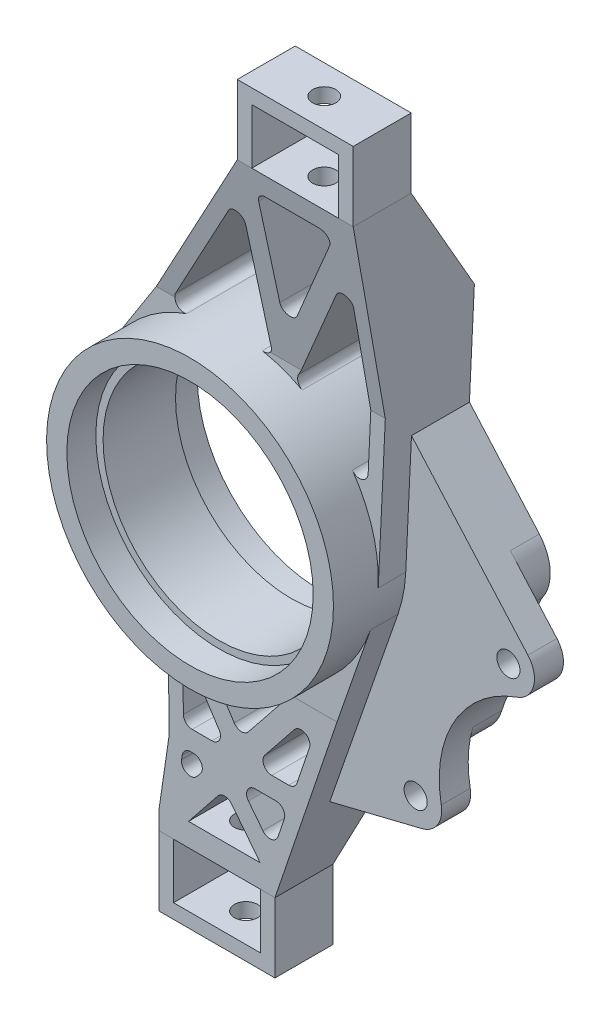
ISO-10303-21;
HEADER;
FILE_DESCRIPTION(('STEP AP214'),'2;1');
FILE_NAME('part.step','',(''),(''),'','','');
FILE_SCHEMA(('AUTOMOTIVE_DESIGN { 1 0 10303 214 1 1 1 1 }'));
ENDSEC;
DATA;
#1=APPLICATION_CONTEXT('core data for automotive mechanical design processes');
#2=APPLICATION_PROTOCOL_DEFINITION('international standard','automotive_design',2000,#1);
#3=PRODUCT_CONTEXT('',#1,'mechanical');
#4=PRODUCT('Part','Part','',(#3));
#5=PRODUCT_RELATED_PRODUCT_CATEGORY('part','',(#4));
#6=PRODUCT_DEFINITION_FORMATION('','',#4);
#7=PRODUCT_DEFINITION_CONTEXT('part definition',#1,'design');
#8=PRODUCT_DEFINITION('design','',#6,#7);
#9=PRODUCT_DEFINITION_SHAPE('','',#8);
#10=(LENGTH_UNIT() NAMED_UNIT(*) SI_UNIT(.MILLI.,.METRE.));
#11=(NAMED_UNIT(*) PLANE_ANGLE_UNIT() SI_UNIT($,.RADIAN.));
#12=(NAMED_UNIT(*) SI_UNIT($,.STERADIAN.) SOLID_ANGLE_UNIT());
#13=UNCERTAINTY_MEASURE_WITH_UNIT(LENGTH_MEASURE(1.E-05),#10,'distance_accuracy_value','');
#14=(GEOMETRIC_REPRESENTATION_CONTEXT(3) GLOBAL_UNCERTAINTY_ASSIGNED_CONTEXT((#13)) GLOBAL_UNIT_ASSIGNED_CONTEXT((#10,
#11,#12)) REPRESENTATION_CONTEXT('',''));
#15=CARTESIAN_POINT('',(0.,0.,0.));
#16=DIRECTION('',(0.,0.,1.));
#17=DIRECTION('',(1.,0.,0.));
#18=AXIS2_PLACEMENT_3D('',#15,#16,#17);
#19=CARTESIAN_POINT('',(-2.15105711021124E-13,0.,15.5));
#20=DIRECTION('',(0.,0.,-1.));
#21=DIRECTION('',(-1.,0.,0.));
#22=AXIS2_PLACEMENT_3D('',#19,#20,#21);
#23=PLANE('',#22);
#24=DIRECTION('',(-0.5326445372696,0.846339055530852,0.));
#25=VECTOR('',#24,1.);
#26=CARTESIAN_POINT('',(-30.8570937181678,-19.4199503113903,15.5));
#27=LINE('',#26,#25);
#28=CARTESIAN_POINT('',(-0.480206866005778,-67.6869350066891,15.5));
#29=VERTEX_POINT('',#28);
#30=CARTESIAN_POINT('',(-9.30826618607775,-53.6596975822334,15.5));
#31=VERTEX_POINT('',#30);
#32=EDGE_CURVE('E660',#29,#31,#27,.T.);
#33=ORIENTED_EDGE('',*,*,#32,.F.);
#34=CARTESIAN_POINT('',(2.05881030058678,-66.0890013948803,15.5));
#35=DIRECTION('',(0.,0.,-1.));
#36=DIRECTION('',(-1.,0.,0.));
#37=AXIS2_PLACEMENT_3D('',#34,#35,#36);
#38=CIRCLE('',#37,3.);
#39=CARTESIAN_POINT('',(4.39923712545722,-67.9658077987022,15.5));
#40=VERTEX_POINT('',#39);
#41=EDGE_CURVE('E640',#29,#40,#38,.F.);
#42=ORIENTED_EDGE('',*,*,#41,.T.);
#43=DIRECTION('',(0.625602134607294,0.780142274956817,0.));
#44=VECTOR('',#43,1.);
#45=CARTESIAN_POINT('',(35.8487742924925,-28.7474098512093,15.5));
#46=LINE('',#45,#44);
#47=CARTESIAN_POINT('',(16.9621025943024,-52.2995849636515,15.5));
#48=VERTEX_POINT('',#47);
#49=EDGE_CURVE('E669',#40,#48,#46,.T.);
#50=ORIENTED_EDGE('',*,*,#49,.T.);
#51=CARTESIAN_POINT('',(14.6216757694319,-50.4227785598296,15.5));
#52=DIRECTION('',(0.,0.,-1.));
#53=DIRECTION('',(-1.,0.,0.));
#54=AXIS2_PLACEMENT_3D('',#51,#52,#53);
#55=CIRCLE('',#54,3.);
#56=CARTESIAN_POINT('',(13.7861514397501,-47.5414769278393,15.5));
#57=VERTEX_POINT('',#56);
#58=EDGE_CURVE('E515',#48,#57,#55,.F.);
#59=ORIENTED_EDGE('',*,*,#58,.T.);
#60=CARTESIAN_POINT('',(0.,0.,15.5));
#61=DIRECTION('',(0.,0.,-1.));
#62=DIRECTION('',(-1.,0.,0.));
#63=AXIS2_PLACEMENT_3D('',#60,#61,#62);
#64=CIRCLE('',#63,49.5);
#65=CARTESIAN_POINT('',(-6.38243478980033,-49.0868060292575,15.5));
#66=VERTEX_POINT('',#65);
#67=EDGE_CURVE('E662',#66,#57,#64,.F.);
#68=ORIENTED_EDGE('',*,*,#67,.F.);
#69=CARTESIAN_POINT('',(-6.7692490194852,-52.0617639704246,15.5));
#70=DIRECTION('',(0.,0.,-1.));
#71=DIRECTION('',(-1.,0.,0.));
#72=AXIS2_PLACEMENT_3D('',#69,#70,#71);
#73=CIRCLE('',#72,3.);
#74=EDGE_CURVE('E503',#66,#31,#73,.F.);
#75=ORIENTED_EDGE('',*,*,#74,.T.);
#76=EDGE_LOOP('',(#33,#42,#50,#59,#68,#75));
#77=FACE_BOUND('',#76,.T.);
#78=DIRECTION('',(-0.970953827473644,-0.239266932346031,0.));
#79=VECTOR('',#78,1.);
#80=CARTESIAN_POINT('',(29.763162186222,-75.2115668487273,15.5));
#81=LINE('',#80,#79);
#82=CARTESIAN_POINT('',(29.763162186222,-75.2115668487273,15.5));
#83=VERTEX_POINT('',#82);
#84=CARTESIAN_POINT('',(25.965556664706,-76.1473903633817,15.5));
#85=VERTEX_POINT('',#84);
#86=EDGE_CURVE('E834',#83,#85,#81,.T.);
#87=ORIENTED_EDGE('',*,*,#86,.F.);
#88=CARTESIAN_POINT('',(27.8490267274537,-67.4439362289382,15.5));
#89=DIRECTION('',(0.,0.,-1.));
#90=DIRECTION('',(-1.,0.,0.));
#91=AXIS2_PLACEMENT_3D('',#88,#89,#90);
#92=CIRCLE('',#91,7.99999999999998);
#93=CARTESIAN_POINT('',(35.8490244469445,-67.4499767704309,15.5));
#94=VERTEX_POINT('',#93);
#95=EDGE_CURVE('E888',#94,#83,#92,.T.);
#96=ORIENTED_EDGE('',*,*,#95,.F.);
#97=CARTESIAN_POINT('',(52.8490196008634,-67.462812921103,15.5));
#98=DIRECTION('',(0.,0.,1.));
#99=DIRECTION('',(1.,0.,0.));
#100=AXIS2_PLACEMENT_3D('',#97,#98,#99);
#101=CIRCLE('',#100,17.0000000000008);
#102=CARTESIAN_POINT('',(49.6782804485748,-50.7611239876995,15.5));
#103=VERTEX_POINT('',#102);
#104=EDGE_CURVE('E885',#103,#94,#101,.T.);
#105=ORIENTED_EDGE('',*,*,#104,.F.);
#106=CARTESIAN_POINT('',(48.1861679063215,-42.9015056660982,15.5));
#107=DIRECTION('',(0.,0.,-1.));
#108=DIRECTION('',(-1.,0.,0.));
#109=AXIS2_PLACEMENT_3D('',#106,#107,#108);
#110=CIRCLE('',#109,8.00000000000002);
#111=CARTESIAN_POINT('',(55.8660631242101,-45.1418648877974,15.5));
#112=VERTEX_POINT('',#111);
#113=EDGE_CURVE('E882',#112,#103,#110,.T.);
#114=ORIENTED_EDGE('',*,*,#113,.F.);
#115=CARTESIAN_POINT('',(100.985447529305,-58.3039753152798,15.5));
#116=DIRECTION('',(0.,0.,1.));
#117=DIRECTION('',(1.,0.,0.));
#118=AXIS2_PLACEMENT_3D('',#115,#116,#117);
#119=CIRCLE('',#118,46.9999999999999);
#120=CARTESIAN_POINT('',(67.0270333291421,-25.8104974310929,15.5));
#121=VERTEX_POINT('',#120);
#122=EDGE_CURVE('E879',#121,#112,#119,.T.);
#123=ORIENTED_EDGE('',*,*,#122,.F.);
#124=CARTESIAN_POINT('',(61.2468777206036,-20.2796926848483,15.5));
#125=DIRECTION('',(0.,0.,-1.));
#126=DIRECTION('',(-1.,0.,0.));
#127=AXIS2_PLACEMENT_3D('',#124,#125,#126);
#128=CIRCLE('',#127,7.99999999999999);
#129=CARTESIAN_POINT('',(68.7995631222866,-17.6420908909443,15.5));
#130=VERTEX_POINT('',#129);
#131=EDGE_CURVE('E876',#130,#121,#128,.T.);
#132=ORIENTED_EDGE('',*,*,#131,.F.);
#133=CARTESIAN_POINT('',(84.8490196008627,-12.0371870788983,15.5));
#134=DIRECTION('',(0.,0.,1.));
#135=DIRECTION('',(1.,0.,0.));
#136=AXIS2_PLACEMENT_3D('',#133,#134,#135);
#137=CIRCLE('',#136,17.);
#138=CARTESIAN_POINT('',(70.8688721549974,-2.36477903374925,15.5));
#139=VERTEX_POINT('',#138);
#140=EDGE_CURVE('E873',#139,#130,#137,.T.);
#141=ORIENTED_EDGE('',*,*,#140,.F.);
#142=CARTESIAN_POINT('',(64.2899792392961,2.1869423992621,15.5));
#143=DIRECTION('',(0.,0.,-1.));
#144=DIRECTION('',(-1.,0.,0.));
#145=AXIS2_PLACEMENT_3D('',#142,#143,#144);
#146=CIRCLE('',#145,7.99999999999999);
#147=CARTESIAN_POINT('',(70.2876012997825,7.48114013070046,15.5));
#148=VERTEX_POINT('',#147);
#149=EDGE_CURVE('E870',#148,#139,#146,.T.);
#150=ORIENTED_EDGE('',*,*,#149,.F.);
#151=DIRECTION('',(0.661774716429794,-0.749702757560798,0.));
#152=VECTOR('',#151,1.);
#153=CARTESIAN_POINT('',(50.9409051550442,29.3983743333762,15.5));
#154=LINE('',#153,#152);
#155=CARTESIAN_POINT('',(50.9409051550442,29.3983743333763,15.5));
#156=VERTEX_POINT('',#155);
#157=EDGE_CURVE('E828',#156,#148,#154,.T.);
#158=ORIENTED_EDGE('',*,*,#157,.F.);
#159=DIRECTION('',(-0.0470907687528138,-0.998890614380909,0.));
#160=VECTOR('',#159,1.);
#161=CARTESIAN_POINT('',(49.445085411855,-2.33099305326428,15.5));
#162=LINE('',#161,#160);
#163=CARTESIAN_POINT('',(49.445085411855,-2.33099305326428,15.5));
#164=VERTEX_POINT('',#163);
#165=EDGE_CURVE('E816',#156,#164,#162,.T.);
#166=ORIENTED_EDGE('',*,*,#165,.T.);
#167=CARTESIAN_POINT('',(0.,0.,15.5));
#168=DIRECTION('',(0.,0.,-1.));
#169=DIRECTION('',(-1.,0.,0.));
#170=AXIS2_PLACEMENT_3D('',#167,#168,#169);
#171=CIRCLE('',#170,49.5);
#172=CARTESIAN_POINT('',(46.7629364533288,-16.2319984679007,15.5));
#173=VERTEX_POINT('',#172);
#174=EDGE_CURVE('E1303',#164,#173,#171,.T.);
#175=ORIENTED_EDGE('',*,*,#174,.T.);
#176=DIRECTION('',(-0.32791916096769,-0.944705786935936,0.));
#177=VECTOR('',#176,1.);
#178=CARTESIAN_POINT('',(46.7629364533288,-16.2319984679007,15.5));
#179=LINE('',#178,#177);
#180=EDGE_CURVE('E809',#173,#85,#179,.T.);
#181=ORIENTED_EDGE('',*,*,#180,.T.);
#182=EDGE_LOOP('',(#87,#96,#105,#114,#123,#132,#141,#150,#158,#166,#175,#181));
#183=FACE_BOUND('',#182,.T.);
#184=CARTESIAN_POINT('',(0.,0.,15.5));
#185=DIRECTION('',(0.,0.,-1.));
#186=DIRECTION('',(-1.,0.,0.));
#187=AXIS2_PLACEMENT_3D('',#184,#185,#186);
#188=CIRCLE('',#187,42.5);
#189=CARTESIAN_POINT('',(-42.5,0.,15.5));
#190=VERTEX_POINT('',#189);
#191=EDGE_CURVE('E776',#190,#190,#188,.T.);
#192=ORIENTED_EDGE('',*,*,#191,.F.);
#193=EDGE_LOOP('',(#192));
#194=FACE_BOUND('',#193,.T.);
#195=DIRECTION('',(-1.,0.,0.));
#196=VECTOR('',#195,1.);
#197=CARTESIAN_POINT('',(0.,-77.0311495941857,15.5));
#198=LINE('',#197,#196);
#199=CARTESIAN_POINT('',(18.23188528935,-77.0311495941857,15.5));
#200=VERTEX_POINT('',#199);
#201=CARTESIAN_POINT('',(12.3535672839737,-77.0311495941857,15.5));
#202=VERTEX_POINT('',#201);
#203=EDGE_CURVE('E754',#200,#202,#198,.T.);
#204=ORIENTED_EDGE('',*,*,#203,.F.);
#205=CARTESIAN_POINT('',(18.23188528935,-74.0311495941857,15.5));
#206=DIRECTION('',(0.,0.,-1.));
#207=DIRECTION('',(-1.,0.,0.));
#208=AXIS2_PLACEMENT_3D('',#205,#206,#207);
#209=CIRCLE('',#208,3.);
#210=CARTESIAN_POINT('',(21.0660026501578,-75.0149070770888,15.5));
#211=VERTEX_POINT('',#210);
#212=EDGE_CURVE('E648',#200,#211,#209,.F.);
#213=ORIENTED_EDGE('',*,*,#212,.T.);
#214=DIRECTION('',(-0.32791916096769,-0.944705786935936,0.));
#215=VECTOR('',#214,1.);
#216=CARTESIAN_POINT('',(42.0394075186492,-14.5924026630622,15.5));
#217=LINE('',#216,#215);
#218=CARTESIAN_POINT('',(25.5524993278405,-62.0897112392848,15.5));
#219=VERTEX_POINT('',#218);
#220=EDGE_CURVE('E760',#219,#211,#217,.T.);
#221=ORIENTED_EDGE('',*,*,#220,.F.);
#222=CARTESIAN_POINT('',(22.7183819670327,-61.1059537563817,15.5));
#223=DIRECTION('',(0.,0.,-1.));
#224=DIRECTION('',(-1.,0.,0.));
#225=AXIS2_PLACEMENT_3D('',#222,#223,#224);
#226=CIRCLE('',#225,3.);
#227=CARTESIAN_POINT('',(20.3779551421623,-59.2291473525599,15.5));
#228=VERTEX_POINT('',#227);
#229=EDGE_CURVE('E508',#219,#228,#226,.F.);
#230=ORIENTED_EDGE('',*,*,#229,.T.);
#231=DIRECTION('',(0.625602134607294,0.780142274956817,0.));
#232=VECTOR('',#231,1.);
#233=CARTESIAN_POINT('',(41.3097702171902,-33.1266247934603,15.5));
#234=LINE('',#233,#232);
#235=CARTESIAN_POINT('',(10.0131404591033,-72.1543431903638,15.5));
#236=VERTEX_POINT('',#235);
#237=EDGE_CURVE('E757',#236,#228,#234,.T.);
#238=ORIENTED_EDGE('',*,*,#237,.F.);
#239=CARTESIAN_POINT('',(12.3535672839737,-74.0311495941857,15.5));
#240=DIRECTION('',(0.,0.,-1.));
#241=DIRECTION('',(-1.,0.,0.));
#242=AXIS2_PLACEMENT_3D('',#239,#240,#241);
#243=CIRCLE('',#242,3.);
#244=EDGE_CURVE('E632',#236,#202,#243,.F.);
#245=ORIENTED_EDGE('',*,*,#244,.T.);
#246=EDGE_LOOP('',(#204,#213,#221,#230,#238,#245));
#247=FACE_BOUND('',#246,.T.);
#248=DIRECTION('',(0.,1.,0.));
#249=VECTOR('',#248,1.);
#250=CARTESIAN_POINT('',(-18.1,0.,15.5));
#251=LINE('',#250,#249);
#252=CARTESIAN_POINT('',(-18.1,-74.0311495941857,15.5));
#253=VERTEX_POINT('',#252);
#254=CARTESIAN_POINT('',(-18.1,-63.2312394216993,15.5));
#255=VERTEX_POINT('',#254);
#256=EDGE_CURVE('E739',#253,#255,#251,.T.);
#257=ORIENTED_EDGE('',*,*,#256,.F.);
#258=CARTESIAN_POINT('',(-15.1,-74.0311495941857,15.5));
#259=DIRECTION('',(0.,0.,-1.));
#260=DIRECTION('',(-1.,0.,0.));
#261=AXIS2_PLACEMENT_3D('',#258,#259,#260);
#262=CIRCLE('',#261,3.);
#263=CARTESIAN_POINT('',(-15.1,-77.0311495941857,15.5));
#264=VERTEX_POINT('',#263);
#265=EDGE_CURVE('E636',#253,#264,#262,.F.);
#266=ORIENTED_EDGE('',*,*,#265,.T.);
#267=DIRECTION('',(-1.,0.,0.));
#268=VECTOR('',#267,1.);
#269=CARTESIAN_POINT('',(0.,-77.0311495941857,15.5));
#270=LINE('',#269,#268);
#271=CARTESIAN_POINT('',(-8.30306310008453,-77.0311495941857,15.5));
#272=VERTEX_POINT('',#271);
#273=EDGE_CURVE('E751',#272,#264,#270,.T.);
#274=ORIENTED_EDGE('',*,*,#273,.F.);
#275=CARTESIAN_POINT('',(-8.30306310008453,-74.0311495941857,15.5));
#276=DIRECTION('',(0.,0.,-1.));
#277=DIRECTION('',(-1.,0.,0.));
#278=AXIS2_PLACEMENT_3D('',#275,#276,#277);
#279=CIRCLE('',#278,3.);
#280=CARTESIAN_POINT('',(-5.76404593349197,-72.4332159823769,15.5));
#281=VERTEX_POINT('',#280);
#282=EDGE_CURVE('E652',#272,#281,#279,.F.);
#283=ORIENTED_EDGE('',*,*,#282,.T.);
#284=DIRECTION('',(0.5326445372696,-0.846339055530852,0.));
#285=VECTOR('',#284,1.);
#286=CARTESIAN_POINT('',(-36.7814671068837,-23.1484620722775,15.5));
#287=LINE('',#286,#285);
#288=CARTESIAN_POINT('',(-12.5609828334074,-61.6333058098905,15.5));
#289=VERTEX_POINT('',#288);
#290=EDGE_CURVE('E743',#289,#281,#287,.T.);
#291=ORIENTED_EDGE('',*,*,#290,.F.);
#292=CARTESIAN_POINT('',(-15.1,-63.2312394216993,15.5));
#293=DIRECTION('',(0.,0.,-1.));
#294=DIRECTION('',(-1.,0.,0.));
#295=AXIS2_PLACEMENT_3D('',#292,#293,#294);
#296=CIRCLE('',#295,3.);
#297=EDGE_CURVE('E644',#289,#255,#296,.F.);
#298=ORIENTED_EDGE('',*,*,#297,.T.);
#299=EDGE_LOOP('',(#257,#266,#274,#283,#291,#298));
#300=FACE_BOUND('',#299,.T.);
#301=DIRECTION('',(-1.,0.,0.));
#302=VECTOR('',#301,1.);
#303=CARTESIAN_POINT('',(-49.4599927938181,-90.5129198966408,15.5));
#304=LINE('',#303,#302);
#305=CARTESIAN_POINT('',(5.41022393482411,-90.5129198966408,15.5));
#306=VERTEX_POINT('',#305);
#307=CARTESIAN_POINT('',(-13.6873513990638,-90.5129198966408,15.5));
#308=VERTEX_POINT('',#307);
#309=EDGE_CURVE('E817',#306,#308,#304,.T.);
#310=ORIENTED_EDGE('',*,*,#309,.T.);
#311=CARTESIAN_POINT('',(-15.9204069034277,-88.5095569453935,15.5));
#312=DIRECTION('',(0.,0.,-1.));
#313=DIRECTION('',(-1.,0.,0.));
#314=AXIS2_PLACEMENT_3D('',#311,#312,#313);
#315=CIRCLE('',#314,3.);
#316=CARTESIAN_POINT('',(-13.5799800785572,-90.3863633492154,15.5));
#317=VERTEX_POINT('',#316);
#318=EDGE_CURVE('E608',#308,#317,#315,.F.);
#319=ORIENTED_EDGE('',*,*,#318,.T.);
#320=DIRECTION('',(0.625602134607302,0.78014227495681,0.));
#321=VECTOR('',#320,1.);
#322=CARTESIAN_POINT('',(35.8487742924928,-28.7474098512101,15.5));
#323=LINE('',#322,#321);
#324=CARTESIAN_POINT('',(-12.394433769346,-88.9079559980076,15.5));
#325=VERTEX_POINT('',#324);
#326=EDGE_CURVE('E2846',#317,#325,#323,.T.);
#327=ORIENTED_EDGE('',*,*,#326,.T.);
#328=CARTESIAN_POINT('',(-14.7348605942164,-87.0311495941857,15.5));
#329=DIRECTION('',(0.,0.,-1.));
#330=DIRECTION('',(-1.,0.,0.));
#331=AXIS2_PLACEMENT_3D('',#328,#329,#330);
#332=CIRCLE('',#331,3.);
#333=CARTESIAN_POINT('',(-14.7348605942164,-84.0311495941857,15.5));
#334=VERTEX_POINT('',#333);
#335=EDGE_CURVE('E616',#325,#334,#332,.F.);
#336=ORIENTED_EDGE('',*,*,#335,.T.);
#337=DIRECTION('',(-1.,0.,0.));
#338=VECTOR('',#337,1.);
#339=CARTESIAN_POINT('',(0.,-84.0311495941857,15.5));
#340=LINE('',#339,#338);
#341=CARTESIAN_POINT('',(-15.6882898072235,-84.0311495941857,15.5));
#342=VERTEX_POINT('',#341);
#343=EDGE_CURVE('E2839',#334,#342,#340,.T.);
#344=ORIENTED_EDGE('',*,*,#343,.T.);
#345=CARTESIAN_POINT('',(-15.6882898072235,-87.0311495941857,15.5));
#346=DIRECTION('',(0.,0.,-1.));
#347=DIRECTION('',(-1.,0.,0.));
#348=AXIS2_PLACEMENT_3D('',#345,#346,#347);
#349=CIRCLE('',#348,3.);
#350=CARTESIAN_POINT('',(-18.6519838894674,-86.5658353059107,15.5));
#351=VERTEX_POINT('',#350);
#352=EDGE_CURVE('E620',#342,#351,#349,.F.);
#353=ORIENTED_EDGE('',*,*,#352,.T.);
#354=DIRECTION('',(0.155104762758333,0.987898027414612,0.));
#355=VECTOR('',#354,1.);
#356=CARTESIAN_POINT('',(-4.93898111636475,0.775443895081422,15.5));
#357=LINE('',#356,#355);
#358=CARTESIAN_POINT('',(-18.8841009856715,-88.0442426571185,15.5));
#359=VERTEX_POINT('',#358);
#360=EDGE_CURVE('E2841',#359,#351,#357,.T.);
#361=ORIENTED_EDGE('',*,*,#360,.F.);
#362=CARTESIAN_POINT('',(-15.9204069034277,-88.5095569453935,15.5));
#363=DIRECTION('',(0.,0.,-1.));
#364=DIRECTION('',(-1.,0.,0.));
#365=AXIS2_PLACEMENT_3D('',#362,#363,#364);
#366=CIRCLE('',#365,3.);
#367=CARTESIAN_POINT('',(-18.1534624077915,-90.5129198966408,15.5));
#368=VERTEX_POINT('',#367);
#369=EDGE_CURVE('E602',#359,#368,#366,.F.);
#370=ORIENTED_EDGE('',*,*,#369,.T.);
#371=CARTESIAN_POINT('',(-24.3329463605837,-90.5129198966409,15.5));
#372=VERTEX_POINT('',#371);
#373=EDGE_CURVE('E812',#368,#372,#304,.T.);
#374=ORIENTED_EDGE('',*,*,#373,.T.);
#375=DIRECTION('',(-0.155104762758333,-0.987898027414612,0.));
#376=VECTOR('',#375,1.);
#377=CARTESIAN_POINT('',(-9.87847125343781,1.55096770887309,15.5));
#378=LINE('',#377,#376);
#379=CARTESIAN_POINT('',(-23.1,-82.66,15.5));
#380=VERTEX_POINT('',#379);
#381=EDGE_CURVE('E792',#380,#372,#378,.T.);
#382=ORIENTED_EDGE('',*,*,#381,.F.);
#383=DIRECTION('',(0.,-1.,0.));
#384=VECTOR('',#383,1.);
#385=CARTESIAN_POINT('',(-23.1,0.,15.5));
#386=LINE('',#385,#384);
#387=CARTESIAN_POINT('',(-23.1,-52.66,15.5));
#388=VERTEX_POINT('',#387);
#389=EDGE_CURVE('E799',#388,#380,#386,.T.);
#390=ORIENTED_EDGE('',*,*,#389,.F.);
#391=DIRECTION('',(1.,0.,0.));
#392=VECTOR('',#391,1.);
#393=CARTESIAN_POINT('',(0.,-52.66,15.5));
#394=LINE('',#393,#392);
#395=CARTESIAN_POINT('',(-28.1,-52.66,15.5));
#396=VERTEX_POINT('',#395);
#397=EDGE_CURVE('E802',#396,#388,#394,.T.);
#398=ORIENTED_EDGE('',*,*,#397,.F.);
#399=DIRECTION('',(0.468591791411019,-0.883414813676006,0.));
#400=VECTOR('',#399,1.);
#401=CARTESIAN_POINT('',(-43.7290332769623,-23.1952936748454,15.5));
#402=LINE('',#401,#400);
#403=CARTESIAN_POINT('',(-43.7290332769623,-23.1952936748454,15.5));
#404=VERTEX_POINT('',#403);
#405=EDGE_CURVE('E805',#404,#396,#402,.T.);
#406=ORIENTED_EDGE('',*,*,#405,.F.);
#407=CARTESIAN_POINT('',(-41.7244628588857,26.6330471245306,15.5));
#408=VERTEX_POINT('',#407);
#409=EDGE_CURVE('E1300',#404,#408,#171,.T.);
#410=ORIENTED_EDGE('',*,*,#409,.T.);
#411=DIRECTION('',(0.538041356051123,0.84291844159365,0.));
#412=VECTOR('',#411,1.);
#413=CARTESIAN_POINT('',(-41.7244628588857,26.6330471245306,15.5));
#414=LINE('',#413,#412);
#415=CARTESIAN_POINT('',(-10.4651188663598,75.6052631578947,15.5));
#416=VERTEX_POINT('',#415);
#417=EDGE_CURVE('E821',#408,#416,#414,.T.);
#418=ORIENTED_EDGE('',*,*,#417,.T.);
#419=DIRECTION('',(1.,0.,0.));
#420=VECTOR('',#419,1.);
#421=CARTESIAN_POINT('',(-49.4599927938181,75.6052631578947,15.5));
#422=LINE('',#421,#420);
#423=CARTESIAN_POINT('',(-4.53334687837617,75.6052631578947,15.5));
#424=VERTEX_POINT('',#423);
#425=EDGE_CURVE('E825',#416,#424,#422,.T.);
#426=ORIENTED_EDGE('',*,*,#425,.T.);
#427=DIRECTION('',(0.538041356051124,0.84291844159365,0.));
#428=VECTOR('',#427,1.);
#429=CARTESIAN_POINT('',(-37.5098706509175,23.942840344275,15.5));
#430=LINE('',#429,#428);
#431=CARTESIAN_POINT('',(-20.2086825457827,51.0476164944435,15.5));
#432=VERTEX_POINT('',#431);
#433=EDGE_CURVE('E2141',#432,#424,#430,.T.);
#434=ORIENTED_EDGE('',*,*,#433,.F.);
#435=CARTESIAN_POINT('',(-17.6799272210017,49.4334924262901,15.5));
#436=DIRECTION('',(0.,0.,-1.));
#437=DIRECTION('',(-1.,0.,0.));
#438=AXIS2_PLACEMENT_3D('',#435,#436,#437);
#439=CIRCLE('',#438,3.);
#440=CARTESIAN_POINT('',(-16.6696456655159,46.6087214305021,15.5));
#441=VERTEX_POINT('',#440);
#442=EDGE_CURVE('E522',#432,#441,#439,.F.);
#443=ORIENTED_EDGE('',*,*,#442,.T.);
#444=CARTESIAN_POINT('',(0.,0.,15.5));
#445=DIRECTION('',(0.,0.,-1.));
#446=DIRECTION('',(-1.,0.,0.));
#447=AXIS2_PLACEMENT_3D('',#444,#445,#446);
#448=CIRCLE('',#447,49.5);
#449=CARTESIAN_POINT('',(9.4285714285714,48.593744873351,15.5));
#450=VERTEX_POINT('',#449);
#451=EDGE_CURVE('E2145',#450,#441,#448,.F.);
#452=ORIENTED_EDGE('',*,*,#451,.F.);
#453=CARTESIAN_POINT('',(9.99999999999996,51.5388203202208,15.5));
#454=DIRECTION('',(0.,0.,-1.));
#455=DIRECTION('',(-1.,0.,0.));
#456=AXIS2_PLACEMENT_3D('',#453,#454,#455);
#457=CIRCLE('',#456,3.);
#458=CARTESIAN_POINT('',(13.,51.5388203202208,15.5));
#459=VERTEX_POINT('',#458);
#460=EDGE_CURVE('E590',#450,#459,#457,.F.);
#461=ORIENTED_EDGE('',*,*,#460,.T.);
#462=DIRECTION('',(0.,1.,0.));
#463=VECTOR('',#462,1.);
#464=CARTESIAN_POINT('',(13.,0.,15.5));
#465=LINE('',#464,#463);
#466=CARTESIAN_POINT('',(13.,75.6052631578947,15.5));
#467=VERTEX_POINT('',#466);
#468=EDGE_CURVE('E2334',#459,#467,#465,.T.);
#469=ORIENTED_EDGE('',*,*,#468,.T.);
#470=CARTESIAN_POINT('',(20.,75.6052631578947,15.5));
#471=VERTEX_POINT('',#470);
#472=EDGE_CURVE('E829',#467,#471,#422,.T.);
#473=ORIENTED_EDGE('',*,*,#472,.T.);
#474=DIRECTION('',(0.,-1.,0.));
#475=VECTOR('',#474,1.);
#476=CARTESIAN_POINT('',(20.,0.,15.5));
#477=LINE('',#476,#475);
#478=CARTESIAN_POINT('',(20.,70.5027148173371,15.5));
#479=VERTEX_POINT('',#478);
#480=EDGE_CURVE('E1821',#471,#479,#477,.T.);
#481=ORIENTED_EDGE('',*,*,#480,.T.);
#482=CARTESIAN_POINT('',(23.,70.5027148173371,15.5));
#483=DIRECTION('',(0.,0.,-1.));
#484=DIRECTION('',(-1.,0.,0.));
#485=AXIS2_PLACEMENT_3D('',#482,#483,#484);
#486=CIRCLE('',#485,3.);
#487=CARTESIAN_POINT('',(25.6331190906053,69.0651182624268,15.5));
#488=VERTEX_POINT('',#487);
#489=EDGE_CURVE('E528',#479,#488,#486,.F.);
#490=ORIENTED_EDGE('',*,*,#489,.T.);
#491=DIRECTION('',(0.479198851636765,0.877706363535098,0.));
#492=VECTOR('',#491,1.);
#493=CARTESIAN_POINT('',(-9.3015578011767,5.07834510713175,15.5));
#494=LINE('',#493,#492);
#495=CARTESIAN_POINT('',(29.2038234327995,75.6052631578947,15.5));
#496=VERTEX_POINT('',#495);
#497=EDGE_CURVE('E1818',#488,#496,#494,.T.);
#498=ORIENTED_EDGE('',*,*,#497,.T.);
#499=CARTESIAN_POINT('',(37.1791558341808,75.6052631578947,15.5));
#500=VERTEX_POINT('',#499);
#501=EDGE_CURVE('E738',#496,#500,#422,.T.);
#502=ORIENTED_EDGE('',*,*,#501,.T.);
#503=DIRECTION('',(-0.479198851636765,-0.877706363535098,0.));
#504=VECTOR('',#503,1.);
#505=CARTESIAN_POINT('',(-3.15761325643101,1.72395314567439,15.5));
#506=LINE('',#505,#504);
#507=CARTESIAN_POINT('',(21.9986966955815,47.8005521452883,15.5));
#508=VERTEX_POINT('',#507);
#509=EDGE_CURVE('E571',#500,#508,#506,.T.);
#510=ORIENTED_EDGE('',*,*,#509,.T.);
#511=CARTESIAN_POINT('',(24.6318157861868,46.362955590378,15.5));
#512=DIRECTION('',(0.,0.,-1.));
#513=DIRECTION('',(-1.,0.,0.));
#514=AXIS2_PLACEMENT_3D('',#511,#512,#513);
#515=CIRCLE('',#514,3.);
#516=CARTESIAN_POINT('',(23.2242834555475,43.7136438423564,15.5));
#517=VERTEX_POINT('',#516);
#518=EDGE_CURVE('E544',#508,#517,#515,.F.);
#519=ORIENTED_EDGE('',*,*,#518,.T.);
#520=CARTESIAN_POINT('',(0.,0.,15.5));
#521=DIRECTION('',(0.,0.,-1.));
#522=DIRECTION('',(-1.,0.,0.));
#523=AXIS2_PLACEMENT_3D('',#520,#521,#522);
#524=CIRCLE('',#523,49.5);
#525=CARTESIAN_POINT('',(40.5128791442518,28.4421627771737,15.5));
#526=VERTEX_POINT('',#525);
#527=EDGE_CURVE('E556',#526,#517,#524,.F.);
#528=ORIENTED_EDGE('',*,*,#527,.F.);
#529=CARTESIAN_POINT('',(42.9682051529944,30.1659302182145,15.5));
#530=DIRECTION('',(0.,0.,-1.));
#531=DIRECTION('',(-1.,0.,0.));
#532=AXIS2_PLACEMENT_3D('',#529,#530,#531);
#533=CIRCLE('',#532,3.);
#534=CARTESIAN_POINT('',(45.9648769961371,30.0246579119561,15.5));
#535=VERTEX_POINT('',#534);
#536=EDGE_CURVE('E138',#526,#535,#533,.F.);
#537=ORIENTED_EDGE('',*,*,#536,.T.);
#538=DIRECTION('',(-0.0470907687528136,-0.998890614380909,0.));
#539=VECTOR('',#538,1.);
#540=CARTESIAN_POINT('',(44.4506323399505,-2.09553920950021,15.5));
#541=LINE('',#540,#539);
#542=CARTESIAN_POINT('',(48.113686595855,75.6052631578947,15.5));
#543=VERTEX_POINT('',#542);
#544=EDGE_CURVE('E553',#543,#535,#541,.T.);
#545=ORIENTED_EDGE('',*,*,#544,.F.);
#546=CARTESIAN_POINT('',(53.1192396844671,75.6052631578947,15.5));
#547=VERTEX_POINT('',#546);
#548=EDGE_CURVE('E824',#543,#547,#422,.T.);
#549=ORIENTED_EDGE('',*,*,#548,.T.);
#550=CARTESIAN_POINT('',(51.4142848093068,39.4397158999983,15.5));
#551=VERTEX_POINT('',#550);
#552=EDGE_CURVE('E820',#547,#551,#162,.T.);
#553=ORIENTED_EDGE('',*,*,#552,.T.);
#554=DIRECTION('',(-0.661774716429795,0.749702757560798,0.));
#555=VECTOR('',#554,1.);
#556=CARTESIAN_POINT('',(91.59634441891,-6.08121463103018,15.5));
#557=LINE('',#556,#555);
#558=CARTESIAN_POINT('',(75.5355206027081,12.113563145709,15.5));
#559=VERTEX_POINT('',#558);
#560=EDGE_CURVE('E1045',#559,#551,#557,.T.);
#561=ORIENTED_EDGE('',*,*,#560,.F.);
#562=CARTESIAN_POINT('',(64.2899792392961,2.18694239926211,15.5));
#563=DIRECTION('',(0.,0.,-1.));
#564=DIRECTION('',(-1.,0.,0.));
#565=AXIS2_PLACEMENT_3D('',#562,#563,#564);
#566=CIRCLE('',#565,15.);
#567=CARTESIAN_POINT('',(76.6254034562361,-6.34753528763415,15.5));
#568=VERTEX_POINT('',#567);
#569=EDGE_CURVE('E969',#568,#559,#566,.F.);
#570=ORIENTED_EDGE('',*,*,#569,.F.);
#571=CARTESIAN_POINT('',(84.8490196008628,-12.0371870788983,15.5));
#572=DIRECTION('',(0.,0.,-1.));
#573=DIRECTION('',(-1.,0.,0.));
#574=AXIS2_PLACEMENT_3D('',#571,#572,#573);
#575=CIRCLE('',#574,10.);
#576=CARTESIAN_POINT('',(75.4081628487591,-15.3341893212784,15.5));
#577=VERTEX_POINT('',#576);
#578=EDGE_CURVE('E990',#568,#577,#575,.F.);
#579=ORIENTED_EDGE('',*,*,#578,.T.);
#580=CARTESIAN_POINT('',(61.2468777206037,-20.2796926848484,15.5));
#581=DIRECTION('',(0.,0.,-1.));
#582=DIRECTION('',(-1.,0.,0.));
#583=AXIS2_PLACEMENT_3D('',#580,#581,#582);
#584=CIRCLE('',#583,15.);
#585=CARTESIAN_POINT('',(72.0846694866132,-30.6499515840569,15.5));
#586=VERTEX_POINT('',#585);
#587=EDGE_CURVE('E956',#577,#586,#584,.T.);
#588=ORIENTED_EDGE('',*,*,#587,.T.);
#589=CARTESIAN_POINT('',(100.985447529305,-58.3039753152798,15.5));
#590=DIRECTION('',(0.,0.,-1.));
#591=DIRECTION('',(-1.,0.,0.));
#592=AXIS2_PLACEMENT_3D('',#589,#590,#591);
#593=CIRCLE('',#592,39.9999999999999);
#594=CARTESIAN_POINT('',(62.5859714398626,-47.1021792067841,15.5));
#595=VERTEX_POINT('',#594);
#596=EDGE_CURVE('E1051',#595,#586,#593,.T.);
#597=ORIENTED_EDGE('',*,*,#596,.F.);
#598=CARTESIAN_POINT('',(48.1861679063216,-42.9015056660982,15.5));
#599=DIRECTION('',(0.,0.,-1.));
#600=DIRECTION('',(-1.,0.,0.));
#601=AXIS2_PLACEMENT_3D('',#598,#599,#600);
#602=CIRCLE('',#601,15.);
#603=CARTESIAN_POINT('',(50.9838789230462,-57.6382900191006,15.5));
#604=VERTEX_POINT('',#603);
#605=EDGE_CURVE('E927',#604,#595,#602,.F.);
#606=ORIENTED_EDGE('',*,*,#605,.F.);
#607=CARTESIAN_POINT('',(52.8490196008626,-67.4628129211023,15.5));
#608=DIRECTION('',(0.,0.,-1.));
#609=DIRECTION('',(-1.,0.,0.));
#610=AXIS2_PLACEMENT_3D('',#607,#608,#609);
#611=CIRCLE('',#610,10.);
#612=CARTESIAN_POINT('',(42.849022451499,-67.4552622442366,15.5));
#613=VERTEX_POINT('',#612);
#614=EDGE_CURVE('E948',#604,#613,#611,.F.);
#615=ORIENTED_EDGE('',*,*,#614,.T.);
#616=CARTESIAN_POINT('',(27.8490267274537,-67.4439362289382,15.5));
#617=DIRECTION('',(0.,0.,-1.));
#618=DIRECTION('',(-1.,0.,0.));
#619=AXIS2_PLACEMENT_3D('',#616,#617,#618);
#620=CIRCLE('',#619,15.);
#621=CARTESIAN_POINT('',(31.4380307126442,-82.0082436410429,15.5));
#622=VERTEX_POINT('',#621);
#623=EDGE_CURVE('E896',#613,#622,#620,.T.);
#624=ORIENTED_EDGE('',*,*,#623,.T.);
#625=DIRECTION('',(0.970953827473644,0.239266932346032,0.));
#626=VECTOR('',#625,1.);
#627=CARTESIAN_POINT('',(23.2290055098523,-84.0311495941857,15.5));
#628=LINE('',#627,#626);
#629=CARTESIAN_POINT('',(23.2290055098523,-84.0311495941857,15.5));
#630=VERTEX_POINT('',#629);
#631=EDGE_CURVE('E1048',#630,#622,#628,.T.);
#632=ORIENTED_EDGE('',*,*,#631,.F.);
#633=CARTESIAN_POINT('',(20.9791021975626,-90.5129198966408,15.5));
#634=VERTEX_POINT('',#633);
#635=EDGE_CURVE('E808',#630,#634,#179,.T.);
#636=ORIENTED_EDGE('',*,*,#635,.T.);
#637=CARTESIAN_POINT('',(15.6864491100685,-90.5129198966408,15.5));
#638=VERTEX_POINT('',#637);
#639=EDGE_CURVE('E813',#634,#638,#304,.T.);
#640=ORIENTED_EDGE('',*,*,#639,.T.);
#641=DIRECTION('',(-0.32791916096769,-0.944705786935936,0.));
#642=VECTOR('',#641,1.);
#643=CARTESIAN_POINT('',(42.0394075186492,-14.5924026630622,15.5));
#644=LINE('',#643,#642);
#645=CARTESIAN_POINT('',(16.5535405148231,-88.0149070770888,15.5));
#646=VERTEX_POINT('',#645);
#647=EDGE_CURVE('E2312',#646,#638,#644,.T.);
#648=ORIENTED_EDGE('',*,*,#647,.F.);
#649=CARTESIAN_POINT('',(13.7194231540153,-87.0311495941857,15.5));
#650=DIRECTION('',(0.,0.,-1.));
#651=DIRECTION('',(-1.,0.,0.));
#652=AXIS2_PLACEMENT_3D('',#649,#650,#651);
#653=CIRCLE('',#652,3.);
#654=CARTESIAN_POINT('',(13.7194231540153,-84.0311495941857,15.5));
#655=VERTEX_POINT('',#654);
#656=EDGE_CURVE('E628',#646,#655,#653,.F.);
#657=ORIENTED_EDGE('',*,*,#656,.T.);
#658=DIRECTION('',(-1.,0.,0.));
#659=VECTOR('',#658,1.);
#660=CARTESIAN_POINT('',(0.,-84.0311495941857,15.5));
#661=LINE('',#660,#659);
#662=CARTESIAN_POINT('',(6.53343035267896,-84.0311495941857,15.5));
#663=VERTEX_POINT('',#662);
#664=EDGE_CURVE('E2320',#655,#663,#661,.T.);
#665=ORIENTED_EDGE('',*,*,#664,.T.);
#666=CARTESIAN_POINT('',(6.53343035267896,-87.0311495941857,15.5));
#667=DIRECTION('',(0.,0.,-1.));
#668=DIRECTION('',(-1.,0.,0.));
#669=AXIS2_PLACEMENT_3D('',#666,#667,#668);
#670=CIRCLE('',#669,3.);
#671=CARTESIAN_POINT('',(4.14406342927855,-88.8452404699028,15.5));
#672=VERTEX_POINT('',#671);
#673=EDGE_CURVE('E624',#663,#672,#670,.F.);
#674=ORIENTED_EDGE('',*,*,#673,.T.);
#675=DIRECTION('',(-0.60469695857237,0.796455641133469,0.));
#676=VECTOR('',#675,1.);
#677=CARTESIAN_POINT('',(-40.1603868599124,-30.4911692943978,15.5));
#678=LINE('',#677,#676);
#679=EDGE_CURVE('E2316',#306,#672,#678,.T.);
#680=ORIENTED_EDGE('',*,*,#679,.F.);
#681=EDGE_LOOP('',(#310,#319,#327,#336,#344,#353,#361,#370,#374,#382,#390,#398,#406,#410,#418,
#426,#434,#443,#452,#461,#469,#473,#481,#490,#498,#502,#510,#519,#528,#537,#545,#549,#553,#561,
#570,#579,#588,#597,#606,#615,#624,#632,#636,#640,#648,#657,#665,#674,#680));
#682=FACE_BOUND('',#681,.T.);
#683=ADVANCED_FACE('F129',(#77,#183,#194,#247,#300,#682),#23,.T.);
#684=CARTESIAN_POINT('',(-49.4599927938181,-6.18650346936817,-16.369456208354));
#685=DIRECTION('',(0.,0.353524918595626,0.935425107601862));
#686=DIRECTION('',(0.,-0.935425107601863,0.353524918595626));
#687=AXIS2_PLACEMENT_3D('',#684,#685,#686);
#688=PLANE('',#687);
#689=CARTESIAN_POINT('',(-15.9204069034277,-88.5095569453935,14.742869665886));
#690=DIRECTION('',(0.,0.353524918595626,0.935425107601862));
#691=DIRECTION('',(0.,0.935425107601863,-0.353524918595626));
#692=AXIS2_PLACEMENT_3D('',#689,#690,#691);
#693=ELLIPSE('',#692,3.20709800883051,3.);
#694=EDGE_CURVE('E605',#368,#308,#693,.T.);
#695=ORIENTED_EDGE('',*,*,#694,.T.);
#696=ORIENTED_EDGE('',*,*,#309,.F.);
#697=DIRECTION('',(0.579034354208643,-0.762655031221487,0.288229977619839));
#698=VECTOR('',#697,1.);
#699=CARTESIAN_POINT('',(-55.5443976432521,-10.2286526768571,-14.8418080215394));
#700=LINE('',#699,#698);
#701=CARTESIAN_POINT('',(9.07547717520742,-95.3404811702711,17.3244787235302));
#702=VERTEX_POINT('',#701);
#703=EDGE_CURVE('E1325',#306,#702,#700,.T.);
#704=ORIENTED_EDGE('',*,*,#703,.T.);
#705=CARTESIAN_POINT('',(11.4648440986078,-93.526390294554,16.6388799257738));
#706=DIRECTION('',(0.,0.353524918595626,0.935425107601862));
#707=DIRECTION('',(0.,-0.935425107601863,0.353524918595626));
#708=AXIS2_PLACEMENT_3D('',#705,#706,#707);
#709=ELLIPSE('',#708,3.20709800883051,3.);
#710=CARTESIAN_POINT('',(14.2989614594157,-94.5101477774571,17.0106710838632));
#711=VERTEX_POINT('',#710);
#712=EDGE_CURVE('E612',#702,#711,#709,.T.);
#713=ORIENTED_EDGE('',*,*,#712,.T.);
#714=DIRECTION('',(0.308826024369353,0.889700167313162,-0.336244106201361));
#715=VECTOR('',#714,1.);
#716=CARTESIAN_POINT('',(35.9523005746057,-32.1288135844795,-6.56508705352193));
#717=LINE('',#716,#715);
#718=EDGE_CURVE('E1328',#711,#638,#717,.T.);
#719=ORIENTED_EDGE('',*,*,#718,.T.);
#720=ORIENTED_EDGE('',*,*,#639,.F.);
#721=DIRECTION('',(0.308826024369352,0.889700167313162,-0.336244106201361));
#722=VECTOR('',#721,1.);
#723=CARTESIAN_POINT('',(39.3112629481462,-37.6996036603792,-4.45972010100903));
#724=LINE('',#723,#722);
#725=CARTESIAN_POINT('',(13.,-113.5,24.1875));
#726=VERTEX_POINT('',#725);
#727=EDGE_CURVE('E1082',#726,#634,#724,.T.);
#728=ORIENTED_EDGE('',*,*,#727,.F.);
#729=DIRECTION('',(1.,0.,0.));
#730=VECTOR('',#729,1.);
#731=CARTESIAN_POINT('',(-49.4599927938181,-113.5,24.1875));
#732=LINE('',#731,#730);
#733=CARTESIAN_POINT('',(8.,-113.5,24.1875));
#734=VERTEX_POINT('',#733);
#735=EDGE_CURVE('E1078',#734,#726,#732,.T.);
#736=ORIENTED_EDGE('',*,*,#735,.F.);
#737=CARTESIAN_POINT('',(-22.,-113.5,24.1875));
#738=VERTEX_POINT('',#737);
#739=EDGE_CURVE('E1086',#738,#734,#732,.T.);
#740=ORIENTED_EDGE('',*,*,#739,.F.);
#741=CARTESIAN_POINT('',(-27.,-113.5,24.1875));
#742=VERTEX_POINT('',#741);
#743=EDGE_CURVE('E1083',#742,#738,#732,.T.);
#744=ORIENTED_EDGE('',*,*,#743,.F.);
#745=DIRECTION('',(0.,-0.935425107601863,0.353524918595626));
#746=VECTOR('',#745,1.);
#747=CARTESIAN_POINT('',(-27.,-25.7595780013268,-8.97221026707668));
#748=LINE('',#747,#746);
#749=CARTESIAN_POINT('',(-27.,-107.5,21.919921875));
#750=VERTEX_POINT('',#749);
#751=EDGE_CURVE('E1089',#750,#742,#748,.T.);
#752=ORIENTED_EDGE('',*,*,#751,.F.);
#753=DIRECTION('',(-0.145307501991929,-0.925497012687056,0.349772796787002));
#754=VECTOR('',#753,1.);
#755=CARTESIAN_POINT('',(-13.867246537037,-23.8544625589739,-9.69220995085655));
#756=LINE('',#755,#754);
#757=EDGE_CURVE('E1092',#372,#750,#756,.T.);
#758=ORIENTED_EDGE('',*,*,#757,.F.);
#759=ORIENTED_EDGE('',*,*,#373,.F.);
#760=EDGE_LOOP('',(#695,#696,#704,#713,#719,#720,#728,#736,#740,#744,#752,#758,#759));
#761=FACE_BOUND('',#760,.T.);
#762=DIRECTION('',(0.579034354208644,-0.762655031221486,0.288229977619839));
#763=VECTOR('',#762,1.);
#764=CARTESIAN_POINT('',(-61.3865742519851,-14.1098785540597,-13.3749775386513));
#765=LINE('',#764,#763);
#766=CARTESIAN_POINT('',(-1.70083931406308,-92.722875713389,16.3352079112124));
#767=VERTEX_POINT('',#766);
#768=CARTESIAN_POINT('',(8.,-105.5,21.1640625));
#769=VERTEX_POINT('',#768);
#770=EDGE_CURVE('E1336',#767,#769,#765,.T.);
#771=ORIENTED_EDGE('',*,*,#770,.F.);
#772=CARTESIAN_POINT('',(-4.09020623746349,-94.5369665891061,17.0208067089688));
#773=DIRECTION('',(0.,0.353524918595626,0.935425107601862));
#774=DIRECTION('',(0.,0.935425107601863,-0.353524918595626));
#775=AXIS2_PLACEMENT_3D('',#772,#773,#774);
#776=ELLIPSE('',#775,3.20709800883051,3.);
#777=CARTESIAN_POINT('',(-6.43063306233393,-92.6601601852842,16.3115058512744));
#778=VERTEX_POINT('',#777);
#779=EDGE_CURVE('E160',#767,#778,#776,.T.);
#780=ORIENTED_EDGE('',*,*,#779,.T.);
#781=DIRECTION('',(-0.600063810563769,-0.748295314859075,0.282803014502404));
#782=VECTOR('',#781,1.);
#783=CARTESIAN_POINT('',(22.4502852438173,-56.6448973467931,2.70026882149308));
#784=LINE('',#783,#782);
#785=CARTESIAN_POINT('',(-16.7270000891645,-105.5,21.1640625));
#786=VERTEX_POINT('',#785);
#787=EDGE_CURVE('E1334',#778,#786,#784,.T.);
#788=ORIENTED_EDGE('',*,*,#787,.T.);
#789=DIRECTION('',(1.,0.,0.));
#790=VECTOR('',#789,1.);
#791=CARTESIAN_POINT('',(-49.4599927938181,-105.5,21.1640625));
#792=LINE('',#791,#790);
#793=EDGE_CURVE('E2821',#786,#769,#792,.T.);
#794=ORIENTED_EDGE('',*,*,#793,.T.);
#795=EDGE_LOOP('',(#771,#780,#788,#794));
#796=FACE_BOUND('',#795,.T.);
#797=ADVANCED_FACE('F1465',(#761,#796),#688,.F.);
#798=CARTESIAN_POINT('',(-49.4599927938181,-0.579173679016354,45.6210651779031));
#799=DIRECTION('',(0.,0.0126942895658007,-0.999919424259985));
#800=DIRECTION('',(0.,0.999919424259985,0.0126942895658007));
#801=AXIS2_PLACEMENT_3D('',#798,#799,#800);
#802=PLANE('',#801);
#803=DIRECTION('',(-0.327895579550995,-0.944637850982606,-0.0119924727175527));
#804=VECTOR('',#803,1.);
#805=CARTESIAN_POINT('',(46.8170648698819,-16.076059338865,45.4243273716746));
#806=LINE('',#805,#804);
#807=CARTESIAN_POINT('',(35.2151982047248,-49.5,45.));
#808=VERTEX_POINT('',#807);
#809=CARTESIAN_POINT('',(13.,-113.5,44.1875));
#810=VERTEX_POINT('',#809);
#811=EDGE_CURVE('E1156',#808,#810,#806,.T.);
#812=ORIENTED_EDGE('',*,*,#811,.F.);
#813=DIRECTION('',(1.,0.,0.));
#814=VECTOR('',#813,1.);
#815=CARTESIAN_POINT('',(-49.4599927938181,-49.5,45.));
#816=LINE('',#815,#814);
#817=CARTESIAN_POINT('',(17.4762299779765,-49.5,45.));
#818=VERTEX_POINT('',#817);
#819=EDGE_CURVE('E491',#818,#808,#816,.T.);
#820=ORIENTED_EDGE('',*,*,#819,.F.);
#821=CARTESIAN_POINT('',(14.6216757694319,-50.4227785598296,44.9882850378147));
#822=DIRECTION('',(0.,0.0126942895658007,-0.999919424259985));
#823=DIRECTION('',(0.,-0.999919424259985,-0.0126942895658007));
#824=AXIS2_PLACEMENT_3D('',#821,#822,#823);
#825=ELLIPSE('',#824,3.00024174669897,3.);
#826=CARTESIAN_POINT('',(16.9621025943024,-52.2995849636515,44.9644583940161));
#827=VERTEX_POINT('',#826);
#828=EDGE_CURVE('E520',#818,#827,#825,.T.);
#829=ORIENTED_EDGE('',*,*,#828,.T.);
#830=DIRECTION('',(0.625571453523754,0.780104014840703,0.00990366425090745));
#831=VECTOR('',#830,1.);
#832=CARTESIAN_POINT('',(16.2126908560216,-53.2341210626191,44.9525941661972));
#833=LINE('',#832,#831);
#834=CARTESIAN_POINT('',(4.39923712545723,-67.9658077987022,44.7655707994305));
#835=VERTEX_POINT('',#834);
#836=EDGE_CURVE('E767',#835,#827,#833,.T.);
#837=ORIENTED_EDGE('',*,*,#836,.F.);
#838=CARTESIAN_POINT('',(2.05881030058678,-66.0890013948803,44.789397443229));
#839=DIRECTION('',(0.,0.0126942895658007,-0.999919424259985));
#840=DIRECTION('',(0.,-0.999919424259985,-0.0126942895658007));
#841=AXIS2_PLACEMENT_3D('',#838,#839,#840);
#842=ELLIPSE('',#841,3.00024174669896,3.);
#843=CARTESIAN_POINT('',(-0.480206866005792,-67.6869350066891,44.7691111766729));
#844=VERTEX_POINT('',#843);
#845=EDGE_CURVE('E642',#835,#844,#842,.T.);
#846=ORIENTED_EDGE('',*,*,#845,.T.);
#847=DIRECTION('',(-0.532613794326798,0.84629020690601,0.0107439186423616));
#848=VECTOR('',#847,1.);
#849=CARTESIAN_POINT('',(-44.6280871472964,2.46130211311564,45.6596649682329));
#850=LINE('',#849,#848);
#851=CARTESIAN_POINT('',(-9.30826618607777,-53.6596975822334,44.947191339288));
#852=VERTEX_POINT('',#851);
#853=EDGE_CURVE('E500',#844,#852,#850,.T.);
#854=ORIENTED_EDGE('',*,*,#853,.T.);
#855=CARTESIAN_POINT('',(-6.7692490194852,-52.0617639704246,44.9674776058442));
#856=DIRECTION('',(0.,0.0126942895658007,-0.999919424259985));
#857=DIRECTION('',(0.,-0.999919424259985,-0.0126942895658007));
#858=AXIS2_PLACEMENT_3D('',#855,#856,#857);
#859=ELLIPSE('',#858,3.00024174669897,3.);
#860=CARTESIAN_POINT('',(-8.33045539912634,-49.5,45.));
#861=VERTEX_POINT('',#860);
#862=EDGE_CURVE('E495',#852,#861,#859,.T.);
#863=ORIENTED_EDGE('',*,*,#862,.T.);
#864=CARTESIAN_POINT('',(-29.7761662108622,-49.5,45.));
#865=VERTEX_POINT('',#864);
#866=EDGE_CURVE('E477',#865,#861,#816,.T.);
#867=ORIENTED_EDGE('',*,*,#866,.F.);
#868=DIRECTION('',(-0.468562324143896,0.88335926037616,0.0112145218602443));
#869=VECTOR('',#868,1.);
#870=CARTESIAN_POINT('',(-43.8018295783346,-23.0580541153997,45.3356887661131));
#871=LINE('',#870,#869);
#872=CARTESIAN_POINT('',(-28.1,-52.66,44.9598828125));
#873=VERTEX_POINT('',#872);
#874=EDGE_CURVE('E1171',#873,#865,#871,.T.);
#875=ORIENTED_EDGE('',*,*,#874,.F.);
#876=DIRECTION('',(-1.,0.,0.));
#877=VECTOR('',#876,1.);
#878=CARTESIAN_POINT('',(0.,-52.66,44.9598828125));
#879=LINE('',#878,#877);
#880=CARTESIAN_POINT('',(-23.1,-52.66,44.9598828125));
#881=VERTEX_POINT('',#880);
#882=EDGE_CURVE('E1168',#881,#873,#879,.T.);
#883=ORIENTED_EDGE('',*,*,#882,.F.);
#884=DIRECTION('',(0.,0.999919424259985,0.0126942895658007));
#885=VECTOR('',#884,1.);
#886=CARTESIAN_POINT('',(-23.1,0.172109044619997,45.6306029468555));
#887=LINE('',#886,#885);
#888=CARTESIAN_POINT('',(-23.1,-82.66,44.5790234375));
#889=VERTEX_POINT('',#888);
#890=EDGE_CURVE('E1165',#889,#881,#887,.T.);
#891=ORIENTED_EDGE('',*,*,#890,.F.);
#892=DIRECTION('',(0.155092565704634,0.9878203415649,0.0125406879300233));
#893=VECTOR('',#892,1.);
#894=CARTESIAN_POINT('',(-9.8521375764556,1.71869297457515,45.6502373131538));
#895=LINE('',#894,#893);
#896=CARTESIAN_POINT('',(-27.,-107.5,44.263671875));
#897=VERTEX_POINT('',#896);
#898=EDGE_CURVE('E1162',#897,#889,#895,.T.);
#899=ORIENTED_EDGE('',*,*,#898,.F.);
#900=DIRECTION('',(0.,0.999919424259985,0.0126942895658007));
#901=VECTOR('',#900,1.);
#902=CARTESIAN_POINT('',(-27.,0.172109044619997,45.6306029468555));
#903=LINE('',#902,#901);
#904=CARTESIAN_POINT('',(-27.,-113.5,44.1875));
#905=VERTEX_POINT('',#904);
#906=EDGE_CURVE('E1159',#905,#897,#903,.T.);
#907=ORIENTED_EDGE('',*,*,#906,.F.);
#908=DIRECTION('',(1.,0.,0.));
#909=VECTOR('',#908,1.);
#910=CARTESIAN_POINT('',(-49.4599927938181,-113.5,44.1875));
#911=LINE('',#910,#909);
#912=CARTESIAN_POINT('',(-22.,-113.5,44.1875));
#913=VERTEX_POINT('',#912);
#914=EDGE_CURVE('E1141',#905,#913,#911,.T.);
#915=ORIENTED_EDGE('',*,*,#914,.T.);
#916=CARTESIAN_POINT('',(8.,-113.5,44.1875));
#917=VERTEX_POINT('',#916);
#918=EDGE_CURVE('E1140',#913,#917,#911,.T.);
#919=ORIENTED_EDGE('',*,*,#918,.T.);
#920=EDGE_CURVE('E1137',#917,#810,#911,.T.);
#921=ORIENTED_EDGE('',*,*,#920,.T.);
#922=EDGE_LOOP('',(#812,#820,#829,#837,#846,#854,#863,#867,#875,#883,#891,#899,#907,#915,#919,#921));
#923=FACE_BOUND('',#922,.T.);
#924=DIRECTION('',(0.625571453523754,0.780104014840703,0.00990366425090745));
#925=VECTOR('',#924,1.);
#926=CARTESIAN_POINT('',(21.6740312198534,-57.6129064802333,44.8970041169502));
#927=LINE('',#926,#925);
#928=CARTESIAN_POINT('',(10.0131404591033,-72.1543431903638,44.7123960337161));
#929=VERTEX_POINT('',#928);
#930=CARTESIAN_POINT('',(20.3779551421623,-59.2291473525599,44.8764854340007));
#931=VERTEX_POINT('',#930);
#932=EDGE_CURVE('E1304',#929,#931,#927,.T.);
#933=ORIENTED_EDGE('',*,*,#932,.T.);
#934=CARTESIAN_POINT('',(22.7183819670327,-61.1059537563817,44.8526587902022));
#935=DIRECTION('',(0.,0.0126942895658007,-0.999919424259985));
#936=DIRECTION('',(0.,0.999919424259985,0.0126942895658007));
#937=AXIS2_PLACEMENT_3D('',#934,#935,#936);
#938=ELLIPSE('',#937,3.00024174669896,3.);
#939=CARTESIAN_POINT('',(25.5524993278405,-62.0897112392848,44.8401696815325));
#940=VERTEX_POINT('',#939);
#941=EDGE_CURVE('E510',#931,#940,#938,.T.);
#942=ORIENTED_EDGE('',*,*,#941,.T.);
#943=DIRECTION('',(-0.327895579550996,-0.944637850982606,-0.0119924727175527));
#944=VECTOR('',#943,1.);
#945=CARTESIAN_POINT('',(36.5429959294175,-30.4270730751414,45.2421367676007));
#946=LINE('',#945,#944);
#947=CARTESIAN_POINT('',(21.0660026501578,-75.0149070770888,44.6760802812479));
#948=VERTEX_POINT('',#947);
#949=EDGE_CURVE('E1310',#940,#948,#946,.T.);
#950=ORIENTED_EDGE('',*,*,#949,.T.);
#951=CARTESIAN_POINT('',(18.23188528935,-74.0311495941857,44.6885693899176));
#952=DIRECTION('',(0.,0.0126942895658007,-0.999919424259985));
#953=DIRECTION('',(0.,0.999919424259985,0.0126942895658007));
#954=AXIS2_PLACEMENT_3D('',#951,#952,#953);
#955=ELLIPSE('',#954,3.00024174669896,3.);
#956=CARTESIAN_POINT('',(18.23188528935,-77.0311495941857,44.6504834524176));
#957=VERTEX_POINT('',#956);
#958=EDGE_CURVE('E650',#948,#957,#955,.T.);
#959=ORIENTED_EDGE('',*,*,#958,.T.);
#960=DIRECTION('',(-1.,0.,0.));
#961=VECTOR('',#960,1.);
#962=CARTESIAN_POINT('',(-49.4599927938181,-77.0311495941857,44.6504834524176));
#963=LINE('',#962,#961);
#964=CARTESIAN_POINT('',(12.3535672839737,-77.0311495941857,44.6504834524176));
#965=VERTEX_POINT('',#964);
#966=EDGE_CURVE('E1307',#957,#965,#963,.T.);
#967=ORIENTED_EDGE('',*,*,#966,.T.);
#968=CARTESIAN_POINT('',(12.3535672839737,-74.0311495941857,44.6885693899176));
#969=DIRECTION('',(0.,0.0126942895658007,-0.999919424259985));
#970=DIRECTION('',(0.,0.999919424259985,0.0126942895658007));
#971=AXIS2_PLACEMENT_3D('',#968,#969,#970);
#972=ELLIPSE('',#971,3.00024174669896,3.);
#973=EDGE_CURVE('E634',#965,#929,#972,.T.);
#974=ORIENTED_EDGE('',*,*,#973,.T.);
#975=EDGE_LOOP('',(#933,#942,#950,#959,#967,#974));
#976=FACE_BOUND('',#975,.T.);
#977=DIRECTION('',(0.532613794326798,-0.84629020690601,-0.0107439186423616));
#978=VECTOR('',#977,1.);
#979=CARTESIAN_POINT('',(-50.5527314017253,-1.26677925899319,45.6123358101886));
#980=LINE('',#979,#978);
#981=CARTESIAN_POINT('',(-12.5609828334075,-61.6333058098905,44.8459638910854));
#982=VERTEX_POINT('',#981);
#983=CARTESIAN_POINT('',(-5.76404593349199,-72.4332159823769,44.7088556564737));
#984=VERTEX_POINT('',#983);
#985=EDGE_CURVE('E1313',#982,#984,#980,.T.);
#986=ORIENTED_EDGE('',*,*,#985,.T.);
#987=CARTESIAN_POINT('',(-8.30306310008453,-74.0311495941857,44.6885693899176));
#988=DIRECTION('',(0.,0.0126942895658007,-0.999919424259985));
#989=DIRECTION('',(0.,0.999919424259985,0.0126942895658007));
#990=AXIS2_PLACEMENT_3D('',#987,#988,#989);
#991=ELLIPSE('',#990,3.00024174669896,3.);
#992=CARTESIAN_POINT('',(-8.30306310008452,-77.0311495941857,44.6504834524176));
#993=VERTEX_POINT('',#992);
#994=EDGE_CURVE('E654',#984,#993,#991,.T.);
#995=ORIENTED_EDGE('',*,*,#994,.T.);
#996=DIRECTION('',(-1.,0.,0.));
#997=VECTOR('',#996,1.);
#998=CARTESIAN_POINT('',(-49.4599927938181,-77.0311495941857,44.6504834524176));
#999=LINE('',#998,#997);
#1000=CARTESIAN_POINT('',(-15.1,-77.0311495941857,44.6504834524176));
#1001=VERTEX_POINT('',#1000);
#1002=EDGE_CURVE('E1316',#993,#1001,#999,.T.);
#1003=ORIENTED_EDGE('',*,*,#1002,.T.);
#1004=CARTESIAN_POINT('',(-15.1,-74.0311495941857,44.6885693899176));
#1005=DIRECTION('',(0.,0.0126942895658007,-0.999919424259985));
#1006=DIRECTION('',(0.,0.999919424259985,0.0126942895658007));
#1007=AXIS2_PLACEMENT_3D('',#1004,#1005,#1006);
#1008=ELLIPSE('',#1007,3.00024174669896,3.);
#1009=CARTESIAN_POINT('',(-18.1,-74.0311495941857,44.6885693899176));
#1010=VERTEX_POINT('',#1009);
#1011=EDGE_CURVE('E638',#1001,#1010,#1008,.T.);
#1012=ORIENTED_EDGE('',*,*,#1011,.T.);
#1013=DIRECTION('',(0.,0.999919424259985,0.0126942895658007));
#1014=VECTOR('',#1013,1.);
#1015=CARTESIAN_POINT('',(-18.1,-0.579173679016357,45.6210651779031));
#1016=LINE('',#1015,#1014);
#1017=CARTESIAN_POINT('',(-18.1,-63.2312394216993,44.8256776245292));
#1018=VERTEX_POINT('',#1017);
#1019=EDGE_CURVE('E1319',#1010,#1018,#1016,.T.);
#1020=ORIENTED_EDGE('',*,*,#1019,.T.);
#1021=CARTESIAN_POINT('',(-15.1,-63.2312394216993,44.8256776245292));
#1022=DIRECTION('',(0.,0.0126942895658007,-0.999919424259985));
#1023=DIRECTION('',(0.,0.999919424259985,0.0126942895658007));
#1024=AXIS2_PLACEMENT_3D('',#1021,#1022,#1023);
#1025=ELLIPSE('',#1024,3.00024174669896,3.);
#1026=EDGE_CURVE('E646',#1018,#982,#1025,.T.);
#1027=ORIENTED_EDGE('',*,*,#1026,.T.);
#1028=EDGE_LOOP('',(#986,#995,#1003,#1012,#1020,#1027));
#1029=FACE_BOUND('',#1028,.T.);
#1030=DIRECTION('',(-1.,0.,0.));
#1031=VECTOR('',#1030,1.);
#1032=CARTESIAN_POINT('',(-49.4599927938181,-84.0311495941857,44.5616162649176));
#1033=LINE('',#1032,#1031);
#1034=CARTESIAN_POINT('',(13.7194231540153,-84.0311495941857,44.5616162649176));
#1035=VERTEX_POINT('',#1034);
#1036=CARTESIAN_POINT('',(6.53343035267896,-84.0311495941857,44.5616162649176));
#1037=VERTEX_POINT('',#1036);
#1038=EDGE_CURVE('E1331',#1035,#1037,#1033,.T.);
#1039=ORIENTED_EDGE('',*,*,#1038,.F.);
#1040=CARTESIAN_POINT('',(13.7194231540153,-87.0311495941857,44.5235303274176));
#1041=DIRECTION('',(0.,0.0126942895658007,-0.999919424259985));
#1042=DIRECTION('',(0.,-0.999919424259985,-0.0126942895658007));
#1043=AXIS2_PLACEMENT_3D('',#1040,#1041,#1042);
#1044=ELLIPSE('',#1043,3.00024174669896,3.);
#1045=CARTESIAN_POINT('',(16.5535405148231,-88.0149070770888,44.5110412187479));
#1046=VERTEX_POINT('',#1045);
#1047=EDGE_CURVE('E630',#1035,#1046,#1044,.T.);
#1048=ORIENTED_EDGE('',*,*,#1047,.T.);
#1049=DIRECTION('',(-0.327895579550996,-0.944637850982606,-0.0119924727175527));
#1050=VECTOR('',#1049,1.);
#1051=CARTESIAN_POINT('',(36.5429959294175,-30.4270730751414,45.2421367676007));
#1052=LINE('',#1051,#1050);
#1053=CARTESIAN_POINT('',(14.2989614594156,-94.5101477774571,44.428582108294));
#1054=VERTEX_POINT('',#1053);
#1055=EDGE_CURVE('E2331',#1046,#1054,#1052,.T.);
#1056=ORIENTED_EDGE('',*,*,#1055,.T.);
#1057=CARTESIAN_POINT('',(11.4648440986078,-93.526390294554,44.4410712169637));
#1058=DIRECTION('',(0.,0.0126942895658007,-0.999919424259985));
#1059=DIRECTION('',(0.,0.999919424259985,0.0126942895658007));
#1060=AXIS2_PLACEMENT_3D('',#1057,#1058,#1059);
#1061=ELLIPSE('',#1060,3.00024174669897,3.);
#1062=CARTESIAN_POINT('',(9.07547717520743,-95.3404811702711,44.418040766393));
#1063=VERTEX_POINT('',#1062);
#1064=EDGE_CURVE('E614',#1054,#1063,#1061,.T.);
#1065=ORIENTED_EDGE('',*,*,#1064,.T.);
#1066=DIRECTION('',(-0.604666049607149,0.796414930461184,0.0101107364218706));
#1067=VECTOR('',#1066,1.);
#1068=CARTESIAN_POINT('',(-57.9674122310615,-7.03726299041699,45.539077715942));
#1069=LINE('',#1068,#1067);
#1070=CARTESIAN_POINT('',(4.14406342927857,-88.8452404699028,44.5004998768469));
#1071=VERTEX_POINT('',#1070);
#1072=EDGE_CURVE('E2328',#1063,#1071,#1069,.T.);
#1073=ORIENTED_EDGE('',*,*,#1072,.T.);
#1074=CARTESIAN_POINT('',(6.53343035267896,-87.0311495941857,44.5235303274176));
#1075=DIRECTION('',(0.,0.0126942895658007,-0.999919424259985));
#1076=DIRECTION('',(0.,-0.999919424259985,-0.0126942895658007));
#1077=AXIS2_PLACEMENT_3D('',#1074,#1075,#1076);
#1078=ELLIPSE('',#1077,3.00024174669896,3.);
#1079=EDGE_CURVE('E626',#1071,#1037,#1078,.T.);
#1080=ORIENTED_EDGE('',*,*,#1079,.T.);
#1081=EDGE_LOOP('',(#1039,#1048,#1056,#1065,#1073,#1080));
#1082=FACE_BOUND('',#1081,.T.);
#1083=DIRECTION('',(-0.60466604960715,0.796414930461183,0.0101107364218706));
#1084=VECTOR('',#1083,1.);
#1085=CARTESIAN_POINT('',(-63.5429302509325,-11.26970898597,45.4853454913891));
#1086=LINE('',#1085,#1084);
#1087=CARTESIAN_POINT('',(7.99999999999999,-105.5,44.2890625));
#1088=VERTEX_POINT('',#1087);
#1089=CARTESIAN_POINT('',(-1.7008393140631,-92.722875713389,44.4512720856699));
#1090=VERTEX_POINT('',#1089);
#1091=EDGE_CURVE('E2317',#1088,#1090,#1086,.T.);
#1092=ORIENTED_EDGE('',*,*,#1091,.F.);
#1093=DIRECTION('',(-1.,0.,0.));
#1094=VECTOR('',#1093,1.);
#1095=CARTESIAN_POINT('',(-49.4599927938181,-105.5,44.2890625));
#1096=LINE('',#1095,#1094);
#1097=CARTESIAN_POINT('',(-16.7270000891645,-105.5,44.2890625));
#1098=VERTEX_POINT('',#1097);
#1099=EDGE_CURVE('E2824',#1088,#1098,#1096,.T.);
#1100=ORIENTED_EDGE('',*,*,#1099,.T.);
#1101=DIRECTION('',(0.625571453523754,0.780104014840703,0.00990366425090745));
#1102=VECTOR('',#1101,1.);
#1103=CARTESIAN_POINT('',(21.6740312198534,-57.6129064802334,44.8970041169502));
#1104=LINE('',#1103,#1102);
#1105=CARTESIAN_POINT('',(-6.43063306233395,-92.6601601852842,44.4520682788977));
#1106=VERTEX_POINT('',#1105);
#1107=EDGE_CURVE('E2322',#1098,#1106,#1104,.T.);
#1108=ORIENTED_EDGE('',*,*,#1107,.T.);
#1109=CARTESIAN_POINT('',(-4.09020623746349,-94.5369665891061,44.4282416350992));
#1110=DIRECTION('',(0.,0.0126942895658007,-0.999919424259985));
#1111=DIRECTION('',(0.,-0.999919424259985,-0.0126942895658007));
#1112=AXIS2_PLACEMENT_3D('',#1109,#1110,#1111);
#1113=ELLIPSE('',#1112,3.00024174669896,3.);
#1114=EDGE_CURVE('E171',#1106,#1090,#1113,.T.);
#1115=ORIENTED_EDGE('',*,*,#1114,.T.);
#1116=EDGE_LOOP('',(#1092,#1100,#1108,#1115));
#1117=FACE_BOUND('',#1116,.T.);
#1118=DIRECTION('',(0.625571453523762,0.780104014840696,0.00990366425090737));
#1119=VECTOR('',#1118,1.);
#1120=CARTESIAN_POINT('',(16.2126908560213,-53.2341210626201,44.9525941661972));
#1121=LINE('',#1120,#1119);
#1122=CARTESIAN_POINT('',(-13.5799800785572,-90.3863633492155,44.4809348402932));
#1123=VERTEX_POINT('',#1122);
#1124=CARTESIAN_POINT('',(-12.3944337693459,-88.9079559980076,44.499703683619));
#1125=VERTEX_POINT('',#1124);
#1126=EDGE_CURVE('E1345',#1123,#1125,#1121,.T.);
#1127=ORIENTED_EDGE('',*,*,#1126,.F.);
#1128=CARTESIAN_POINT('',(-15.9204069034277,-88.5095569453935,44.5047614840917));
#1129=DIRECTION('',(0.,0.0126942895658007,-0.999919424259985));
#1130=DIRECTION('',(0.,-0.999919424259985,-0.0126942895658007));
#1131=AXIS2_PLACEMENT_3D('',#1128,#1129,#1130);
#1132=ELLIPSE('',#1131,3.00024174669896,3.);
#1133=CARTESIAN_POINT('',(-18.8841009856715,-88.0442426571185,44.510668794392));
#1134=VERTEX_POINT('',#1133);
#1135=EDGE_CURVE('E610',#1123,#1134,#1132,.T.);
#1136=ORIENTED_EDGE('',*,*,#1135,.T.);
#1137=DIRECTION('',(0.155092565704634,0.9878203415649,0.0125406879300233));
#1138=VECTOR('',#1137,1.);
#1139=CARTESIAN_POINT('',(-6.21744207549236,-7.36736898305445,45.5348869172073));
#1140=LINE('',#1139,#1138);
#1141=CARTESIAN_POINT('',(-18.6519838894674,-86.5658353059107,44.5294376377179));
#1142=VERTEX_POINT('',#1141);
#1143=EDGE_CURVE('E1339',#1134,#1142,#1140,.T.);
#1144=ORIENTED_EDGE('',*,*,#1143,.T.);
#1145=CARTESIAN_POINT('',(-15.6882898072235,-87.0311495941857,44.5235303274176));
#1146=DIRECTION('',(0.,0.0126942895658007,-0.999919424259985));
#1147=DIRECTION('',(0.,-0.999919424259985,-0.0126942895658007));
#1148=AXIS2_PLACEMENT_3D('',#1145,#1146,#1147);
#1149=ELLIPSE('',#1148,3.00024174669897,3.);
#1150=CARTESIAN_POINT('',(-15.6882898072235,-84.0311495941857,44.5616162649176));
#1151=VERTEX_POINT('',#1150);
#1152=EDGE_CURVE('E622',#1142,#1151,#1149,.T.);
#1153=ORIENTED_EDGE('',*,*,#1152,.T.);
#1154=DIRECTION('',(-1.,0.,0.));
#1155=VECTOR('',#1154,1.);
#1156=CARTESIAN_POINT('',(-49.4599927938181,-84.0311495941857,44.5616162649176));
#1157=LINE('',#1156,#1155);
#1158=CARTESIAN_POINT('',(-14.7348605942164,-84.0311495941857,44.5616162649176));
#1159=VERTEX_POINT('',#1158);
#1160=EDGE_CURVE('E1342',#1159,#1151,#1157,.T.);
#1161=ORIENTED_EDGE('',*,*,#1160,.F.);
#1162=CARTESIAN_POINT('',(-14.7348605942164,-87.0311495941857,44.5235303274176));
#1163=DIRECTION('',(0.,0.0126942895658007,-0.999919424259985));
#1164=DIRECTION('',(0.,0.999919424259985,0.0126942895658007));
#1165=AXIS2_PLACEMENT_3D('',#1162,#1163,#1164);
#1166=ELLIPSE('',#1165,3.00024174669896,3.);
#1167=EDGE_CURVE('E618',#1159,#1125,#1166,.T.);
#1168=ORIENTED_EDGE('',*,*,#1167,.T.);
#1169=EDGE_LOOP('',(#1127,#1136,#1144,#1153,#1161,#1168));
#1170=FACE_BOUND('',#1169,.T.);
#1171=ADVANCED_FACE('F497',(#923,#976,#1029,#1082,#1117,#1170),#802,.F.);
#1172=CARTESIAN_POINT('',(-49.4599927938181,12.9021660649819,-21.7299638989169));
#1173=DIRECTION('',(0.,-0.510538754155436,0.859854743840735));
#1174=DIRECTION('',(0.,-0.859854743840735,-0.510538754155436));
#1175=AXIS2_PLACEMENT_3D('',#1172,#1173,#1174);
#1176=PLANE('',#1175);
#1177=DIRECTION('',(0.,-0.859854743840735,-0.510538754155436));
#1178=VECTOR('',#1177,1.);
#1179=CARTESIAN_POINT('',(13.,12.9021660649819,-21.7299638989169));
#1180=LINE('',#1179,#1178);
#1181=CARTESIAN_POINT('',(13.,92.7980421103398,25.7082125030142));
#1182=VERTEX_POINT('',#1181);
#1183=EDGE_CURVE('E2341',#1182,#467,#1180,.T.);
#1184=ORIENTED_EDGE('',*,*,#1183,.F.);
#1185=CARTESIAN_POINT('',(9.99999999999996,92.7980421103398,25.7082125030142));
#1186=DIRECTION('',(0.,-0.510538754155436,0.859854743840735));
#1187=DIRECTION('',(0.,-0.859854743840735,-0.510538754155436));
#1188=AXIS2_PLACEMENT_3D('',#1185,#1186,#1187);
#1189=ELLIPSE('',#1188,3.48896138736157,3.);
#1190=CARTESIAN_POINT('',(7.47124467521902,94.4121661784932,26.6665986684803));
#1191=VERTEX_POINT('',#1190);
#1192=EDGE_CURVE('E598',#1182,#1191,#1189,.T.);
#1193=ORIENTED_EDGE('',*,*,#1192,.T.);
#1194=DIRECTION('',(-0.481145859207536,-0.75378353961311,-0.447558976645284));
#1195=VECTOR('',#1194,1.);
#1196=CARTESIAN_POINT('',(-45.6922172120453,11.1240286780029,-22.7857329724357));
#1197=LINE('',#1196,#1195);
#1198=EDGE_CURVE('E2131',#1191,#424,#1197,.T.);
#1199=ORIENTED_EDGE('',*,*,#1198,.T.);
#1200=ORIENTED_EDGE('',*,*,#425,.F.);
#1201=DIRECTION('',(0.481145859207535,0.75378353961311,0.447558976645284));
#1202=VECTOR('',#1201,1.);
#1203=CARTESIAN_POINT('',(-26.0552173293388,51.1811527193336,0.998184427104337));
#1204=LINE('',#1203,#1202);
#1205=CARTESIAN_POINT('',(15.,115.5,39.1875));
#1206=VERTEX_POINT('',#1205);
#1207=EDGE_CURVE('E1127',#416,#1206,#1204,.T.);
#1208=ORIENTED_EDGE('',*,*,#1207,.T.);
#1209=DIRECTION('',(1.,0.,0.));
#1210=VECTOR('',#1209,1.);
#1211=CARTESIAN_POINT('',(-49.4599927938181,115.5,39.1875));
#1212=LINE('',#1211,#1210);
#1213=CARTESIAN_POINT('',(20.,115.5,39.1875));
#1214=VERTEX_POINT('',#1213);
#1215=EDGE_CURVE('E1112',#1206,#1214,#1212,.T.);
#1216=ORIENTED_EDGE('',*,*,#1215,.T.);
#1217=CARTESIAN_POINT('',(50.,115.5,39.1875));
#1218=VERTEX_POINT('',#1217);
#1219=EDGE_CURVE('E1111',#1214,#1218,#1212,.T.);
#1220=ORIENTED_EDGE('',*,*,#1219,.T.);
#1221=CARTESIAN_POINT('',(55.,115.5,39.1875));
#1222=VERTEX_POINT('',#1221);
#1223=EDGE_CURVE('E1108',#1218,#1222,#1212,.T.);
#1224=ORIENTED_EDGE('',*,*,#1223,.T.);
#1225=DIRECTION('',(-0.0405029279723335,-0.859149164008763,-0.510119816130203));
#1226=VECTOR('',#1225,1.);
#1227=CARTESIAN_POINT('',(51.3038245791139,37.0966306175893,-7.36450057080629));
#1228=LINE('',#1227,#1226);
#1229=EDGE_CURVE('E1130',#1222,#547,#1228,.T.);
#1230=ORIENTED_EDGE('',*,*,#1229,.T.);
#1231=ORIENTED_EDGE('',*,*,#548,.F.);
#1232=DIRECTION('',(0.0405029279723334,0.859149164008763,0.510119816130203));
#1233=VECTOR('',#1232,1.);
#1234=CARTESIAN_POINT('',(45.0024511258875,9.60965526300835,-23.6848921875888));
#1235=LINE('',#1234,#1233);
#1236=CARTESIAN_POINT('',(48.5335618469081,84.5116679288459,20.7881778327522));
#1237=VERTEX_POINT('',#1236);
#1238=EDGE_CURVE('E570',#543,#1237,#1235,.T.);
#1239=ORIENTED_EDGE('',*,*,#1238,.T.);
#1240=CARTESIAN_POINT('',(45.5368900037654,84.6529402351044,20.8720582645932));
#1241=DIRECTION('',(0.,-0.510538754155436,0.859854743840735));
#1242=DIRECTION('',(0.,-0.859854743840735,-0.510538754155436));
#1243=AXIS2_PLACEMENT_3D('',#1240,#1241,#1242);
#1244=ELLIPSE('',#1243,3.48896138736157,3.);
#1245=CARTESIAN_POINT('',(42.9037709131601,86.0905367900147,21.7256312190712));
#1246=VERTEX_POINT('',#1245);
#1247=EDGE_CURVE('E540',#1237,#1246,#1244,.T.);
#1248=ORIENTED_EDGE('',*,*,#1247,.T.);
#1249=DIRECTION('',(0.42495512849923,0.778352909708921,0.462147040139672));
#1250=VECTOR('',#1249,1.);
#1251=CARTESIAN_POINT('',(-6.51838773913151,-4.43168170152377,-32.0219360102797));
#1252=LINE('',#1251,#1250);
#1253=EDGE_CURVE('E1811',#500,#1246,#1252,.T.);
#1254=ORIENTED_EDGE('',*,*,#1253,.F.);
#1255=ORIENTED_EDGE('',*,*,#501,.F.);
#1256=DIRECTION('',(-0.42495512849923,-0.778352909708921,-0.462147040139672));
#1257=VECTOR('',#1256,1.);
#1258=CARTESIAN_POINT('',(-13.0534798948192,-1.79372039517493,-30.4556464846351));
#1259=LINE('',#1258,#1257);
#1260=CARTESIAN_POINT('',(44.1945203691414,103.06240344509,31.802677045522));
#1261=VERTEX_POINT('',#1260);
#1262=EDGE_CURVE('E730',#1261,#496,#1259,.T.);
#1263=ORIENTED_EDGE('',*,*,#1262,.F.);
#1264=CARTESIAN_POINT('',(41.5614012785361,104.5,32.65625));
#1265=DIRECTION('',(0.,-0.510538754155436,0.859854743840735));
#1266=DIRECTION('',(0.,0.859854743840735,0.510538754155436));
#1267=AXIS2_PLACEMENT_3D('',#1264,#1265,#1266);
#1268=ELLIPSE('',#1267,3.48896138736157,3.);
#1269=CARTESIAN_POINT('',(41.5614012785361,107.5,34.4375));
#1270=VERTEX_POINT('',#1269);
#1271=EDGE_CURVE('E536',#1261,#1270,#1268,.T.);
#1272=ORIENTED_EDGE('',*,*,#1271,.T.);
#1273=DIRECTION('',(1.,0.,0.));
#1274=VECTOR('',#1273,1.);
#1275=CARTESIAN_POINT('',(-49.4599927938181,107.5,34.4375));
#1276=LINE('',#1275,#1274);
#1277=CARTESIAN_POINT('',(23.,107.5,34.4375));
#1278=VERTEX_POINT('',#1277);
#1279=EDGE_CURVE('E711',#1278,#1270,#1276,.T.);
#1280=ORIENTED_EDGE('',*,*,#1279,.F.);
#1281=CARTESIAN_POINT('',(23.,104.5,32.65625));
#1282=DIRECTION('',(0.,-0.510538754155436,0.859854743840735));
#1283=DIRECTION('',(0.,0.859854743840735,0.510538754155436));
#1284=AXIS2_PLACEMENT_3D('',#1281,#1282,#1283);
#1285=ELLIPSE('',#1284,3.48896138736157,3.);
#1286=CARTESIAN_POINT('',(20.,104.5,32.65625));
#1287=VERTEX_POINT('',#1286);
#1288=EDGE_CURVE('E532',#1278,#1287,#1285,.T.);
#1289=ORIENTED_EDGE('',*,*,#1288,.T.);
#1290=DIRECTION('',(0.,0.859854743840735,0.510538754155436));
#1291=VECTOR('',#1290,1.);
#1292=CARTESIAN_POINT('',(20.,12.9021660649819,-21.7299638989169));
#1293=LINE('',#1292,#1291);
#1294=EDGE_CURVE('E740',#471,#1287,#1293,.T.);
#1295=ORIENTED_EDGE('',*,*,#1294,.F.);
#1296=ORIENTED_EDGE('',*,*,#472,.F.);
#1297=EDGE_LOOP('',(#1184,#1193,#1199,#1200,#1208,#1216,#1220,#1224,#1230,#1231,#1239,#1248,
#1254,#1255,#1263,#1272,#1280,#1289,#1295,#1296));
#1298=FACE_BOUND('',#1297,.T.);
#1299=ADVANCED_FACE('F735',(#1298),#1176,.F.);
#1300=CARTESIAN_POINT('',(-49.4599927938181,-7.05974251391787,32.8417977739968));
#1301=DIRECTION('',(0.,-0.210161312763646,0.977666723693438));
#1302=DIRECTION('',(0.,-0.977666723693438,-0.210161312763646));
#1303=AXIS2_PLACEMENT_3D('',#1300,#1301,#1302);
#1304=PLANE('',#1303);
#1305=DIRECTION('',(0.,0.977666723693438,0.210161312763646));
#1306=VECTOR('',#1305,1.);
#1307=CARTESIAN_POINT('',(20.,-7.05974251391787,32.8417977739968));
#1308=LINE('',#1307,#1306);
#1309=CARTESIAN_POINT('',(20.,70.5027148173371,49.514788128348));
#1310=VERTEX_POINT('',#1309);
#1311=CARTESIAN_POINT('',(20.,104.5,56.8229166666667));
#1312=VERTEX_POINT('',#1311);
#1313=EDGE_CURVE('E1322',#1310,#1312,#1308,.T.);
#1314=ORIENTED_EDGE('',*,*,#1313,.T.);
#1315=CARTESIAN_POINT('',(23.,104.5,56.8229166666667));
#1316=DIRECTION('',(0.,-0.210161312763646,0.977666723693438));
#1317=DIRECTION('',(0.,0.977666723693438,0.210161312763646));
#1318=AXIS2_PLACEMENT_3D('',#1315,#1316,#1317);
#1319=ELLIPSE('',#1318,3.06853033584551,3.);
#1320=CARTESIAN_POINT('',(23.,107.5,57.467803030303));
#1321=VERTEX_POINT('',#1320);
#1322=EDGE_CURVE('E534',#1312,#1321,#1319,.F.);
#1323=ORIENTED_EDGE('',*,*,#1322,.T.);
#1324=DIRECTION('',(1.,0.,0.));
#1325=VECTOR('',#1324,1.);
#1326=CARTESIAN_POINT('',(-49.4599927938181,107.5,57.467803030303));
#1327=LINE('',#1326,#1325);
#1328=CARTESIAN_POINT('',(41.5614012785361,107.5,57.467803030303));
#1329=VERTEX_POINT('',#1328);
#1330=EDGE_CURVE('E708',#1321,#1329,#1327,.T.);
#1331=ORIENTED_EDGE('',*,*,#1330,.T.);
#1332=CARTESIAN_POINT('',(41.5614012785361,104.5,56.8229166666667));
#1333=DIRECTION('',(0.,-0.210161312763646,0.977666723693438));
#1334=DIRECTION('',(0.,0.977666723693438,0.210161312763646));
#1335=AXIS2_PLACEMENT_3D('',#1332,#1333,#1334);
#1336=ELLIPSE('',#1335,3.06853033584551,3.);
#1337=CARTESIAN_POINT('',(44.1945203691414,103.06240344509,56.5138878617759));
#1338=VERTEX_POINT('',#1337);
#1339=EDGE_CURVE('E538',#1329,#1338,#1336,.F.);
#1340=ORIENTED_EDGE('',*,*,#1339,.T.);
#1341=DIRECTION('',(-0.47089081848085,-0.862489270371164,-0.18540252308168));
#1342=VECTOR('',#1341,1.);
#1343=CARTESIAN_POINT('',(-23.3637544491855,-20.678142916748,29.9143575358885));
#1344=LINE('',#1343,#1342);
#1345=CARTESIAN_POINT('',(25.6331190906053,69.0651182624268,49.2057593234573));
#1346=VERTEX_POINT('',#1345);
#1347=EDGE_CURVE('E732',#1338,#1346,#1344,.T.);
#1348=ORIENTED_EDGE('',*,*,#1347,.T.);
#1349=CARTESIAN_POINT('',(23.,70.5027148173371,49.514788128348));
#1350=DIRECTION('',(0.,-0.210161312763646,0.977666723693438));
#1351=DIRECTION('',(0.,0.977666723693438,0.210161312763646));
#1352=AXIS2_PLACEMENT_3D('',#1349,#1350,#1351);
#1353=ELLIPSE('',#1352,3.06853033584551,3.);
#1354=EDGE_CURVE('E530',#1346,#1310,#1353,.F.);
#1355=ORIENTED_EDGE('',*,*,#1354,.T.);
#1356=EDGE_LOOP('',(#1314,#1323,#1331,#1340,#1348,#1355));
#1357=FACE_BOUND('',#1356,.T.);
#1358=DIRECTION('',(-0.529420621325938,-0.829412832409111,-0.178292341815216));
#1359=VECTOR('',#1358,1.);
#1360=CARTESIAN_POINT('',(-55.1018768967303,-3.61754385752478,33.5817400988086));
#1361=LINE('',#1360,#1359);
#1362=CARTESIAN_POINT('',(7.47124467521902,94.4121661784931,54.6544145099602));
#1363=VERTEX_POINT('',#1362);
#1364=CARTESIAN_POINT('',(-20.2086825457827,51.0476164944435,45.3326789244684));
#1365=VERTEX_POINT('',#1364);
#1366=EDGE_CURVE('E2138',#1363,#1365,#1361,.T.);
#1367=ORIENTED_EDGE('',*,*,#1366,.F.);
#1368=CARTESIAN_POINT('',(9.99999999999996,92.7980421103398,54.3074389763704));
#1369=DIRECTION('',(0.,-0.210161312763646,0.977666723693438));
#1370=DIRECTION('',(0.,-0.977666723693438,-0.210161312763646));
#1371=AXIS2_PLACEMENT_3D('',#1368,#1369,#1370);
#1372=ELLIPSE('',#1371,3.06853033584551,3.);
#1373=CARTESIAN_POINT('',(13.,92.7980421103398,54.3074389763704));
#1374=VERTEX_POINT('',#1373);
#1375=EDGE_CURVE('E600',#1363,#1374,#1372,.F.);
#1376=ORIENTED_EDGE('',*,*,#1375,.T.);
#1377=DIRECTION('',(0.,-0.977666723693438,-0.210161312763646));
#1378=VECTOR('',#1377,1.);
#1379=CARTESIAN_POINT('',(13.,-7.05974251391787,32.8417977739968));
#1380=LINE('',#1379,#1378);
#1381=CARTESIAN_POINT('',(13.,51.5388203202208,45.438269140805));
#1382=VERTEX_POINT('',#1381);
#1383=EDGE_CURVE('E2137',#1374,#1382,#1380,.T.);
#1384=ORIENTED_EDGE('',*,*,#1383,.T.);
#1385=CARTESIAN_POINT('',(9.99999999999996,51.5388203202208,45.438269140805));
#1386=DIRECTION('',(0.,-0.210161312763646,0.977666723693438));
#1387=DIRECTION('',(0.,-0.977666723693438,-0.210161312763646));
#1388=AXIS2_PLACEMENT_3D('',#1385,#1386,#1387);
#1389=ELLIPSE('',#1388,3.06853033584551,3.);
#1390=CARTESIAN_POINT('',(12.2007298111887,49.5,45.));
#1391=VERTEX_POINT('',#1390);
#1392=EDGE_CURVE('E592',#1382,#1391,#1389,.F.);
#1393=ORIENTED_EDGE('',*,*,#1392,.T.);
#1394=DIRECTION('',(1.,0.,0.));
#1395=VECTOR('',#1394,1.);
#1396=CARTESIAN_POINT('',(-49.4599927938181,49.5,45.));
#1397=LINE('',#1396,#1395);
#1398=CARTESIAN_POINT('',(22.9265394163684,49.5,45.));
#1399=VERTEX_POINT('',#1398);
#1400=EDGE_CURVE('E1135',#1391,#1399,#1397,.T.);
#1401=ORIENTED_EDGE('',*,*,#1400,.T.);
#1402=DIRECTION('',(0.47089081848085,0.862489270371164,0.18540252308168));
#1403=VECTOR('',#1402,1.);
#1404=CARTESIAN_POINT('',(-17.1568576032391,-23.9172306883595,29.2180763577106));
#1405=LINE('',#1404,#1403);
#1406=CARTESIAN_POINT('',(42.9037709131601,86.0905367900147,52.8655794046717));
#1407=VERTEX_POINT('',#1406);
#1408=EDGE_CURVE('E1809',#1399,#1407,#1405,.T.);
#1409=ORIENTED_EDGE('',*,*,#1408,.T.);
#1410=CARTESIAN_POINT('',(45.5368900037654,84.6529402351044,52.556550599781));
#1411=DIRECTION('',(0.,-0.210161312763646,0.977666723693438));
#1412=DIRECTION('',(0.,-0.977666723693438,-0.210161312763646));
#1413=AXIS2_PLACEMENT_3D('',#1410,#1411,#1412);
#1414=ELLIPSE('',#1413,3.06853033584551,3.);
#1415=CARTESIAN_POINT('',(48.5335618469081,84.5116679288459,52.5261824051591));
#1416=VERTEX_POINT('',#1415);
#1417=EDGE_CURVE('E542',#1407,#1416,#1414,.F.);
#1418=ORIENTED_EDGE('',*,*,#1417,.T.);
#1419=DIRECTION('',(0.046041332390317,0.976629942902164,0.209938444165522));
#1420=VECTOR('',#1419,1.);
#1421=CARTESIAN_POINT('',(44.0180285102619,-11.2719429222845,31.9363342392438));
#1422=LINE('',#1421,#1420);
#1423=CARTESIAN_POINT('',(46.8830043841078,49.5,45.));
#1424=VERTEX_POINT('',#1423);
#1425=EDGE_CURVE('E1813',#1424,#1416,#1422,.T.);
#1426=ORIENTED_EDGE('',*,*,#1425,.F.);
#1427=CARTESIAN_POINT('',(51.8885574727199,49.5,45.));
#1428=VERTEX_POINT('',#1427);
#1429=EDGE_CURVE('E490',#1424,#1428,#1397,.T.);
#1430=ORIENTED_EDGE('',*,*,#1429,.T.);
#1431=DIRECTION('',(-0.0460413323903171,-0.976629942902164,-0.209938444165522));
#1432=VECTOR('',#1431,1.);
#1433=CARTESIAN_POINT('',(49.6899135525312,2.86230784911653,34.9746627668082));
#1434=LINE('',#1433,#1432);
#1435=CARTESIAN_POINT('',(55.,115.5,59.1875));
#1436=VERTEX_POINT('',#1435);
#1437=EDGE_CURVE('E1146',#1436,#1428,#1434,.T.);
#1438=ORIENTED_EDGE('',*,*,#1437,.F.);
#1439=DIRECTION('',(1.,0.,0.));
#1440=VECTOR('',#1439,1.);
#1441=CARTESIAN_POINT('',(0.,115.5,59.1875));
#1442=LINE('',#1441,#1440);
#1443=CARTESIAN_POINT('',(50.,115.5,59.1875));
#1444=VERTEX_POINT('',#1443);
#1445=EDGE_CURVE('E1220',#1444,#1436,#1442,.T.);
#1446=ORIENTED_EDGE('',*,*,#1445,.F.);
#1447=DIRECTION('',(1.,0.,0.));
#1448=VECTOR('',#1447,1.);
#1449=CARTESIAN_POINT('',(0.,115.5,59.1875));
#1450=LINE('',#1449,#1448);
#1451=CARTESIAN_POINT('',(20.,115.5,59.1875));
#1452=VERTEX_POINT('',#1451);
#1453=EDGE_CURVE('E1200',#1452,#1444,#1450,.T.);
#1454=ORIENTED_EDGE('',*,*,#1453,.F.);
#1455=CARTESIAN_POINT('',(15.,115.5,59.1875));
#1456=VERTEX_POINT('',#1455);
#1457=EDGE_CURVE('E1290',#1456,#1452,#1442,.T.);
#1458=ORIENTED_EDGE('',*,*,#1457,.F.);
#1459=DIRECTION('',(0.529420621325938,0.829412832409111,0.178292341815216));
#1460=VECTOR('',#1459,1.);
#1461=CARTESIAN_POINT('',(-39.9212966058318,29.4579639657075,40.6917214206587));
#1462=LINE('',#1461,#1460);
#1463=CARTESIAN_POINT('',(-27.1283101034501,49.5,45.));
#1464=VERTEX_POINT('',#1463);
#1465=EDGE_CURVE('E1134',#1464,#1456,#1462,.T.);
#1466=ORIENTED_EDGE('',*,*,#1465,.F.);
#1467=CARTESIAN_POINT('',(-20.6791899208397,49.5,45.));
#1468=VERTEX_POINT('',#1467);
#1469=EDGE_CURVE('E146',#1464,#1468,#1397,.T.);
#1470=ORIENTED_EDGE('',*,*,#1469,.T.);
#1471=CARTESIAN_POINT('',(-17.6799272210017,49.4334924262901,44.9857033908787));
#1472=DIRECTION('',(0.,-0.210161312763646,0.977666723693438));
#1473=DIRECTION('',(0.,-0.977666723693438,-0.210161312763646));
#1474=AXIS2_PLACEMENT_3D('',#1471,#1472,#1473);
#1475=ELLIPSE('',#1474,3.06853033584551,3.);
#1476=EDGE_CURVE('E526',#1468,#1365,#1475,.F.);
#1477=ORIENTED_EDGE('',*,*,#1476,.T.);
#1478=EDGE_LOOP('',(#1367,#1376,#1384,#1393,#1401,#1409,#1418,#1426,#1430,#1438,#1446,#1454,
#1458,#1466,#1470,#1477));
#1479=FACE_BOUND('',#1478,.T.);
#1480=ADVANCED_FACE('F716',(#1357,#1479),#1304,.T.);
#1481=CARTESIAN_POINT('',(0.,0.,45.));
#1482=DIRECTION('',(0.,0.,1.));
#1483=DIRECTION('',(1.,0.,0.));
#1484=AXIS2_PLACEMENT_3D('',#1481,#1482,#1483);
#1485=PLANE('',#1484);
#1486=ORIENTED_EDGE('',*,*,#1400,.F.);
#1487=CARTESIAN_POINT('',(9.99999999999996,51.5388203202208,45.));
#1488=DIRECTION('',(0.,0.,1.));
#1489=DIRECTION('',(1.,0.,0.));
#1490=AXIS2_PLACEMENT_3D('',#1487,#1488,#1489);
#1491=CIRCLE('',#1490,3.);
#1492=CARTESIAN_POINT('',(9.4285714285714,48.593744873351,45.));
#1493=VERTEX_POINT('',#1492);
#1494=EDGE_CURVE('E595',#1391,#1493,#1491,.F.);
#1495=ORIENTED_EDGE('',*,*,#1494,.T.);
#1496=CARTESIAN_POINT('',(0.,0.,45.));
#1497=DIRECTION('',(0.,0.,1.));
#1498=DIRECTION('',(1.,0.,0.));
#1499=AXIS2_PLACEMENT_3D('',#1496,#1497,#1498);
#1500=CIRCLE('',#1499,49.5);
#1501=CARTESIAN_POINT('',(23.2242834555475,43.7136438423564,45.));
#1502=VERTEX_POINT('',#1501);
#1503=EDGE_CURVE('E788',#1502,#1493,#1500,.T.);
#1504=ORIENTED_EDGE('',*,*,#1503,.F.);
#1505=CARTESIAN_POINT('',(24.6318157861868,46.362955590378,45.));
#1506=DIRECTION('',(0.,0.,1.));
#1507=DIRECTION('',(1.,0.,0.));
#1508=AXIS2_PLACEMENT_3D('',#1505,#1506,#1507);
#1509=CIRCLE('',#1508,3.);
#1510=CARTESIAN_POINT('',(21.9986966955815,47.8005521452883,45.));
#1511=VERTEX_POINT('',#1510);
#1512=EDGE_CURVE('E546',#1502,#1511,#1509,.F.);
#1513=ORIENTED_EDGE('',*,*,#1512,.T.);
#1514=DIRECTION('',(0.479198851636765,0.877706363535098,0.));
#1515=VECTOR('',#1514,1.);
#1516=CARTESIAN_POINT('',(-3.15761325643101,1.72395314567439,45.));
#1517=LINE('',#1516,#1515);
#1518=EDGE_CURVE('E1800',#1511,#1399,#1517,.T.);
#1519=ORIENTED_EDGE('',*,*,#1518,.T.);
#1520=EDGE_LOOP('',(#1486,#1495,#1504,#1513,#1519));
#1521=FACE_BOUND('',#1520,.T.);
#1522=ADVANCED_FACE('F1499',(#1521),#1485,.T.);
#1523=ORIENTED_EDGE('',*,*,#819,.T.);
#1524=DIRECTION('',(-0.32791916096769,-0.944705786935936,0.));
#1525=VECTOR('',#1524,1.);
#1526=CARTESIAN_POINT('',(46.7629364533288,-16.2319984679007,45.));
#1527=LINE('',#1526,#1525);
#1528=CARTESIAN_POINT('',(46.7629364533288,-16.2319984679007,45.));
#1529=VERTEX_POINT('',#1528);
#1530=EDGE_CURVE('E998',#1529,#808,#1527,.T.);
#1531=ORIENTED_EDGE('',*,*,#1530,.F.);
#1532=CARTESIAN_POINT('',(13.7861514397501,-47.5414769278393,45.));
#1533=VERTEX_POINT('',#1532);
#1534=EDGE_CURVE('E2446',#1533,#1529,#1500,.T.);
#1535=ORIENTED_EDGE('',*,*,#1534,.F.);
#1536=CARTESIAN_POINT('',(14.6216757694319,-50.4227785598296,45.));
#1537=DIRECTION('',(0.,0.,1.));
#1538=DIRECTION('',(1.,0.,0.));
#1539=AXIS2_PLACEMENT_3D('',#1536,#1537,#1538);
#1540=CIRCLE('',#1539,3.);
#1541=EDGE_CURVE('E517',#1533,#818,#1540,.F.);
#1542=ORIENTED_EDGE('',*,*,#1541,.T.);
#1543=EDGE_LOOP('',(#1523,#1531,#1535,#1542));
#1544=FACE_BOUND('',#1543,.T.);
#1545=ADVANCED_FACE('F1628',(#1544),#1485,.T.);
#1546=CARTESIAN_POINT('',(0.,0.,45.));
#1547=DIRECTION('',(0.,0.,-1.));
#1548=DIRECTION('',(-1.,0.,0.));
#1549=AXIS2_PLACEMENT_3D('',#1546,#1547,#1548);
#1550=CYLINDRICAL_SURFACE('',#1549,40.);
#1551=CARTESIAN_POINT('',(0.,0.,50.5));
#1552=DIRECTION('',(0.,0.,1.));
#1553=DIRECTION('',(1.,0.,0.));
#1554=AXIS2_PLACEMENT_3D('',#1551,#1552,#1553);
#1555=CIRCLE('',#1554,40.);
#1556=CARTESIAN_POINT('',(-40.,0.,50.5));
#1557=VERTEX_POINT('',#1556);
#1558=EDGE_CURVE('E779',#1557,#1557,#1555,.T.);
#1559=CARTESIAN_POINT('',(0.,0.,25.5));
#1560=DIRECTION('',(0.,0.,-1.));
#1561=DIRECTION('',(-1.,0.,0.));
#1562=AXIS2_PLACEMENT_3D('',#1559,#1560,#1561);
#1563=CIRCLE('',#1562,40.);
#1564=CARTESIAN_POINT('',(-40.,0.,25.5));
#1565=VERTEX_POINT('',#1564);
#1566=EDGE_CURVE('E770',#1565,#1565,#1563,.T.);
#1567=CARTESIAN_POINT('',(-40.,0.,50.5));
#1568=CARTESIAN_POINT('',(-40.,0.,50.2395833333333));
#1569=CARTESIAN_POINT('',(-40.,0.,49.9791666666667));
#1570=CARTESIAN_POINT('',(-40.,0.,49.4583333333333));
#1571=CARTESIAN_POINT('',(-40.,0.,49.1979166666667));
#1572=CARTESIAN_POINT('',(-40.,0.,48.6770833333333));
#1573=CARTESIAN_POINT('',(-40.,0.,48.4166666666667));
#1574=CARTESIAN_POINT('',(-40.,0.,47.8958333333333));
#1575=CARTESIAN_POINT('',(-40.,0.,47.6354166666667));
#1576=CARTESIAN_POINT('',(-40.,0.,47.1145833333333));
#1577=CARTESIAN_POINT('',(-40.,0.,46.8541666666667));
#1578=CARTESIAN_POINT('',(-40.,0.,46.3333333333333));
#1579=CARTESIAN_POINT('',(-40.,0.,46.0729166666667));
#1580=CARTESIAN_POINT('',(-40.,0.,45.5520833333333));
#1581=CARTESIAN_POINT('',(-40.,0.,45.2916666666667));
#1582=CARTESIAN_POINT('',(-40.,0.,44.7708333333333));
#1583=CARTESIAN_POINT('',(-40.,0.,44.5104166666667));
#1584=CARTESIAN_POINT('',(-40.,0.,43.9895833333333));
#1585=CARTESIAN_POINT('',(-40.,0.,43.7291666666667));
#1586=CARTESIAN_POINT('',(-40.,0.,43.2083333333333));
#1587=CARTESIAN_POINT('',(-40.,0.,42.9479166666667));
#1588=CARTESIAN_POINT('',(-40.,0.,42.4270833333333));
#1589=CARTESIAN_POINT('',(-40.,0.,42.1666666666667));
#1590=CARTESIAN_POINT('',(-40.,0.,41.6458333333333));
#1591=CARTESIAN_POINT('',(-40.,0.,41.3854166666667));
#1592=CARTESIAN_POINT('',(-40.,0.,40.8645833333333));
#1593=CARTESIAN_POINT('',(-40.,0.,40.6041666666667));
#1594=CARTESIAN_POINT('',(-40.,0.,40.0833333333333));
#1595=CARTESIAN_POINT('',(-40.,0.,39.8229166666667));
#1596=CARTESIAN_POINT('',(-40.,0.,39.3020833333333));
#1597=CARTESIAN_POINT('',(-40.,0.,39.0416666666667));
#1598=CARTESIAN_POINT('',(-40.,0.,38.5208333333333));
#1599=CARTESIAN_POINT('',(-40.,0.,38.2604166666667));
#1600=CARTESIAN_POINT('',(-40.,0.,37.7395833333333));
#1601=CARTESIAN_POINT('',(-40.,0.,37.4791666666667));
#1602=CARTESIAN_POINT('',(-40.,0.,36.9583333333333));
#1603=CARTESIAN_POINT('',(-40.,0.,36.6979166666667));
#1604=CARTESIAN_POINT('',(-40.,0.,36.1770833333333));
#1605=CARTESIAN_POINT('',(-40.,0.,35.9166666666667));
#1606=CARTESIAN_POINT('',(-40.,0.,35.3958333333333));
#1607=CARTESIAN_POINT('',(-40.,0.,35.1354166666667));
#1608=CARTESIAN_POINT('',(-40.,0.,34.6145833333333));
#1609=CARTESIAN_POINT('',(-40.,0.,34.3541666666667));
#1610=CARTESIAN_POINT('',(-40.,0.,33.8333333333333));
#1611=CARTESIAN_POINT('',(-40.,0.,33.5729166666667));
#1612=CARTESIAN_POINT('',(-40.,0.,33.0520833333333));
#1613=CARTESIAN_POINT('',(-40.,0.,32.7916666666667));
#1614=CARTESIAN_POINT('',(-40.,0.,32.2708333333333));
#1615=CARTESIAN_POINT('',(-40.,0.,32.0104166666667));
#1616=CARTESIAN_POINT('',(-40.,0.,31.4895833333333));
#1617=CARTESIAN_POINT('',(-40.,0.,31.2291666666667));
#1618=CARTESIAN_POINT('',(-40.,0.,30.7083333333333));
#1619=CARTESIAN_POINT('',(-40.,0.,30.4479166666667));
#1620=CARTESIAN_POINT('',(-40.,0.,29.9270833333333));
#1621=CARTESIAN_POINT('',(-40.,0.,29.6666666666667));
#1622=CARTESIAN_POINT('',(-40.,0.,29.1458333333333));
#1623=CARTESIAN_POINT('',(-40.,0.,28.8854166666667));
#1624=CARTESIAN_POINT('',(-40.,0.,28.3645833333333));
#1625=CARTESIAN_POINT('',(-40.,0.,28.1041666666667));
#1626=CARTESIAN_POINT('',(-40.,0.,27.5833333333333));
#1627=CARTESIAN_POINT('',(-40.,0.,27.3229166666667));
#1628=CARTESIAN_POINT('',(-40.,0.,26.8020833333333));
#1629=CARTESIAN_POINT('',(-40.,0.,26.5416666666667));
#1630=CARTESIAN_POINT('',(-40.,0.,26.0208333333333));
#1631=CARTESIAN_POINT('',(-40.,0.,25.7604166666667));
#1632=CARTESIAN_POINT('',(-40.,0.,25.5));
#1633=B_SPLINE_CURVE_WITH_KNOTS('',3,(#1567,#1568,#1569,#1570,#1571,#1572,#1573,#1574,#1575,
#1576,#1577,#1578,#1579,#1580,#1581,#1582,#1583,#1584,#1585,#1586,#1587,#1588,#1589,#1590,#1591,
#1592,#1593,#1594,#1595,#1596,#1597,#1598,#1599,#1600,#1601,#1602,#1603,#1604,#1605,#1606,#1607,
#1608,#1609,#1610,#1611,#1612,#1613,#1614,#1615,#1616,#1617,#1618,#1619,#1620,#1621,#1622,#1623,
#1624,#1625,#1626,#1627,#1628,#1629,#1630,#1631,#1632),.UNSPECIFIED.,.F.,.F.,(4,2,2,2,2,2,2,2,2,
2,2,2,2,2,2,2,2,2,2,2,2,2,2,2,2,2,2,2,2,2,2,2,4),(0.,0.781249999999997,1.56249999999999,2.34375,
3.125,3.90624999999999,4.6875,5.46874999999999,6.24999999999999,7.03124999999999,
7.81249999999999,8.59374999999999,9.37499999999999,10.15625,10.9375,11.71875,12.5,13.28125,
14.0625,14.84375,15.625,16.40625,17.1875,17.96875,18.75,19.53125,20.3125,21.09375,21.875,
22.65625,23.4375,24.21875,25.),.UNSPECIFIED.);
#1634=EDGE_CURVE('BSEAM1631',#1557,#1565,#1633,.T.);
#1635=ORIENTED_EDGE('',*,*,#1558,.T.);
#1636=ORIENTED_EDGE('',*,*,#1566,.T.);
#1637=ORIENTED_EDGE('',*,*,#1634,.T.);
#1638=ORIENTED_EDGE('',*,*,#1634,.F.);
#1639=EDGE_LOOP('',(#1635,#1637,#1636,#1638));
#1640=FACE_BOUND('',#1639,.T.);
#1641=ADVANCED_FACE('F1631',(#1640),#1550,.F.);
#1642=CARTESIAN_POINT('',(0.,0.,45.));
#1643=DIRECTION('',(0.,0.,-1.));
#1644=DIRECTION('',(-1.,0.,0.));
#1645=AXIS2_PLACEMENT_3D('',#1642,#1643,#1644);
#1646=CYLINDRICAL_SURFACE('',#1645,49.5);
#1647=ORIENTED_EDGE('',*,*,#174,.F.);
#1648=DIRECTION('',(0.,0.,-1.));
#1649=VECTOR('',#1648,1.);
#1650=CARTESIAN_POINT('',(49.445085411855,-2.33099305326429,15.5));
#1651=LINE('',#1650,#1649);
#1652=CARTESIAN_POINT('',(49.445085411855,-2.33099305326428,32.5));
#1653=VERTEX_POINT('',#1652);
#1654=EDGE_CURVE('E1057',#1653,#164,#1651,.T.);
#1655=ORIENTED_EDGE('',*,*,#1654,.F.);
#1656=CARTESIAN_POINT('',(-1.17961196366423E-12,4.33680868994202E-13,32.5));
#1657=DIRECTION('',(0.,0.,1.));
#1658=DIRECTION('',(1.,0.,0.));
#1659=AXIS2_PLACEMENT_3D('',#1656,#1657,#1658);
#1660=CIRCLE('',#1659,49.5000000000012);
#1661=CARTESIAN_POINT('',(46.7629364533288,-16.2319984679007,32.5));
#1662=VERTEX_POINT('',#1661);
#1663=EDGE_CURVE('E864',#1662,#1653,#1660,.T.);
#1664=ORIENTED_EDGE('',*,*,#1663,.F.);
#1665=DIRECTION('',(0.,0.,-1.));
#1666=VECTOR('',#1665,1.);
#1667=CARTESIAN_POINT('',(46.7629364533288,-16.2319984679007,15.5));
#1668=LINE('',#1667,#1666);
#1669=EDGE_CURVE('E1054',#1662,#173,#1668,.T.);
#1670=ORIENTED_EDGE('',*,*,#1669,.T.);
#1671=EDGE_LOOP('',(#1647,#1655,#1664,#1670));
#1672=FACE_BOUND('',#1671,.T.);
#1673=ADVANCED_FACE('F1633',(#1672),#1646,.T.);
#1674=ORIENTED_EDGE('',*,*,#1503,.T.);
#1675=DIRECTION('',(0.,0.,-1.));
#1676=VECTOR('',#1675,1.);
#1677=CARTESIAN_POINT('',(9.42857142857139,48.593744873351,45.));
#1678=LINE('',#1677,#1676);
#1679=EDGE_CURVE('E1364',#1493,#450,#1678,.T.);
#1680=ORIENTED_EDGE('',*,*,#1679,.T.);
#1681=ORIENTED_EDGE('',*,*,#451,.T.);
#1682=DIRECTION('',(0.,0.,-1.));
#1683=VECTOR('',#1682,1.);
#1684=CARTESIAN_POINT('',(-16.6696456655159,46.6087214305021,45.));
#1685=LINE('',#1684,#1683);
#1686=CARTESIAN_POINT('',(-16.6696456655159,46.6087214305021,45.));
#1687=VERTEX_POINT('',#1686);
#1688=EDGE_CURVE('E1357',#441,#1687,#1685,.F.);
#1689=ORIENTED_EDGE('',*,*,#1688,.T.);
#1690=CARTESIAN_POINT('',(-41.7244628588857,26.6330471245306,45.));
#1691=VERTEX_POINT('',#1690);
#1692=EDGE_CURVE('E793',#1687,#1691,#1500,.T.);
#1693=ORIENTED_EDGE('',*,*,#1692,.T.);
#1694=DIRECTION('',(0.,0.,-1.));
#1695=VECTOR('',#1694,1.);
#1696=CARTESIAN_POINT('',(-41.7244628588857,26.6330471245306,59.1875));
#1697=LINE('',#1696,#1695);
#1698=EDGE_CURVE('E1265',#1691,#408,#1697,.T.);
#1699=ORIENTED_EDGE('',*,*,#1698,.T.);
#1700=ORIENTED_EDGE('',*,*,#409,.F.);
#1701=DIRECTION('',(0.,0.,-1.));
#1702=VECTOR('',#1701,1.);
#1703=CARTESIAN_POINT('',(-43.7290332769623,-23.1952936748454,59.1875));
#1704=LINE('',#1703,#1702);
#1705=CARTESIAN_POINT('',(-43.7290332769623,-23.1952936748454,45.));
#1706=VERTEX_POINT('',#1705);
#1707=EDGE_CURVE('E1262',#1706,#404,#1704,.T.);
#1708=ORIENTED_EDGE('',*,*,#1707,.F.);
#1709=CARTESIAN_POINT('',(-6.38243478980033,-49.0868060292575,45.));
#1710=VERTEX_POINT('',#1709);
#1711=EDGE_CURVE('E796',#1706,#1710,#1500,.T.);
#1712=ORIENTED_EDGE('',*,*,#1711,.T.);
#1713=DIRECTION('',(0.,0.,-1.));
#1714=VECTOR('',#1713,1.);
#1715=CARTESIAN_POINT('',(-6.38243478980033,-49.0868060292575,45.));
#1716=LINE('',#1715,#1714);
#1717=EDGE_CURVE('E507',#1710,#66,#1716,.T.);
#1718=ORIENTED_EDGE('',*,*,#1717,.T.);
#1719=ORIENTED_EDGE('',*,*,#67,.T.);
#1720=DIRECTION('',(0.,0.,-1.));
#1721=VECTOR('',#1720,1.);
#1722=CARTESIAN_POINT('',(13.7861514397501,-47.5414769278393,45.));
#1723=LINE('',#1722,#1721);
#1724=EDGE_CURVE('E1360',#57,#1533,#1723,.F.);
#1725=ORIENTED_EDGE('',*,*,#1724,.T.);
#1726=ORIENTED_EDGE('',*,*,#1534,.T.);
#1727=DIRECTION('',(0.,0.,1.));
#1728=VECTOR('',#1727,1.);
#1729=CARTESIAN_POINT('',(46.7629364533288,-16.2319984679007,35.5));
#1730=LINE('',#1729,#1728);
#1731=CARTESIAN_POINT('',(46.7629364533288,-16.2319984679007,35.5));
#1732=VERTEX_POINT('',#1731);
#1733=EDGE_CURVE('E1034',#1732,#1529,#1730,.T.);
#1734=ORIENTED_EDGE('',*,*,#1733,.F.);
#1735=CARTESIAN_POINT('',(-2.0122792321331E-13,1.11022302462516E-13,35.5));
#1736=DIRECTION('',(0.,0.,-1.));
#1737=DIRECTION('',(-1.,0.,0.));
#1738=AXIS2_PLACEMENT_3D('',#1735,#1736,#1737);
#1739=CIRCLE('',#1738,49.5000000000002);
#1740=CARTESIAN_POINT('',(49.445085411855,-2.33099305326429,35.5));
#1741=VERTEX_POINT('',#1740);
#1742=EDGE_CURVE('E1013',#1741,#1732,#1739,.T.);
#1743=ORIENTED_EDGE('',*,*,#1742,.F.);
#1744=DIRECTION('',(0.,0.,1.));
#1745=VECTOR('',#1744,1.);
#1746=CARTESIAN_POINT('',(49.445085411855,-2.33099305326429,35.5));
#1747=LINE('',#1746,#1745);
#1748=CARTESIAN_POINT('',(49.445085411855,-2.33099305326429,45.));
#1749=VERTEX_POINT('',#1748);
#1750=EDGE_CURVE('E1031',#1741,#1749,#1747,.T.);
#1751=ORIENTED_EDGE('',*,*,#1750,.T.);
#1752=CARTESIAN_POINT('',(40.5128791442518,28.4421627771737,45.));
#1753=VERTEX_POINT('',#1752);
#1754=EDGE_CURVE('E2447',#1749,#1753,#1500,.T.);
#1755=ORIENTED_EDGE('',*,*,#1754,.T.);
#1756=DIRECTION('',(0.,0.,-1.));
#1757=VECTOR('',#1756,1.);
#1758=CARTESIAN_POINT('',(40.5128791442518,28.4421627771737,45.));
#1759=LINE('',#1758,#1757);
#1760=EDGE_CURVE('E1352',#1753,#526,#1759,.T.);
#1761=ORIENTED_EDGE('',*,*,#1760,.T.);
#1762=ORIENTED_EDGE('',*,*,#527,.T.);
#1763=DIRECTION('',(0.,0.,-1.));
#1764=VECTOR('',#1763,1.);
#1765=CARTESIAN_POINT('',(23.2242834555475,43.7136438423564,45.));
#1766=LINE('',#1765,#1764);
#1767=EDGE_CURVE('E1354',#517,#1502,#1766,.F.);
#1768=ORIENTED_EDGE('',*,*,#1767,.T.);
#1769=EDGE_LOOP('',(#1674,#1680,#1681,#1689,#1693,#1699,#1700,#1708,#1712,#1718,#1719,#1725,
#1726,#1734,#1743,#1751,#1755,#1761,#1762,#1768));
#1770=FACE_BOUND('',#1769,.T.);
#1771=CARTESIAN_POINT('',(0.,0.,60.5));
#1772=DIRECTION('',(0.,0.,1.));
#1773=DIRECTION('',(1.,0.,0.));
#1774=AXIS2_PLACEMENT_3D('',#1771,#1772,#1773);
#1775=CIRCLE('',#1774,49.5);
#1776=CARTESIAN_POINT('',(49.5,0.,60.5));
#1777=VERTEX_POINT('',#1776);
#1778=EDGE_CURVE('E789',#1777,#1777,#1775,.T.);
#1779=ORIENTED_EDGE('',*,*,#1778,.F.);
#1780=EDGE_LOOP('',(#1779));
#1781=FACE_BOUND('',#1780,.T.);
#1782=ADVANCED_FACE('F1636',(#1770,#1781),#1646,.T.);
#1783=ORIENTED_EDGE('',*,*,#866,.T.);
#1784=CARTESIAN_POINT('',(-6.7692490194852,-52.0617639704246,45.));
#1785=DIRECTION('',(0.,0.,1.));
#1786=DIRECTION('',(1.,0.,0.));
#1787=AXIS2_PLACEMENT_3D('',#1784,#1785,#1786);
#1788=CIRCLE('',#1787,3.);
#1789=EDGE_CURVE('E482',#861,#1710,#1788,.F.);
#1790=ORIENTED_EDGE('',*,*,#1789,.T.);
#1791=ORIENTED_EDGE('',*,*,#1711,.F.);
#1792=DIRECTION('',(0.468591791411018,-0.883414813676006,0.));
#1793=VECTOR('',#1792,1.);
#1794=CARTESIAN_POINT('',(-43.7290332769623,-23.1952936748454,45.));
#1795=LINE('',#1794,#1793);
#1796=EDGE_CURVE('E486',#1706,#865,#1795,.T.);
#1797=ORIENTED_EDGE('',*,*,#1796,.T.);
#1798=EDGE_LOOP('',(#1783,#1790,#1791,#1797));
#1799=FACE_BOUND('',#1798,.T.);
#1800=ADVANCED_FACE('F479',(#1799),#1485,.T.);
#1801=ORIENTED_EDGE('',*,*,#1692,.F.);
#1802=CARTESIAN_POINT('',(-17.6799272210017,49.4334924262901,45.));
#1803=DIRECTION('',(0.,0.,1.));
#1804=DIRECTION('',(1.,0.,0.));
#1805=AXIS2_PLACEMENT_3D('',#1802,#1803,#1804);
#1806=CIRCLE('',#1805,3.);
#1807=EDGE_CURVE('E524',#1687,#1468,#1806,.F.);
#1808=ORIENTED_EDGE('',*,*,#1807,.T.);
#1809=ORIENTED_EDGE('',*,*,#1469,.F.);
#1810=DIRECTION('',(0.538041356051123,0.84291844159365,0.));
#1811=VECTOR('',#1810,1.);
#1812=CARTESIAN_POINT('',(-41.7244628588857,26.6330471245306,45.));
#1813=LINE('',#1812,#1811);
#1814=EDGE_CURVE('E1150',#1691,#1464,#1813,.T.);
#1815=ORIENTED_EDGE('',*,*,#1814,.F.);
#1816=EDGE_LOOP('',(#1801,#1808,#1809,#1815));
#1817=FACE_BOUND('',#1816,.T.);
#1818=ADVANCED_FACE('F2170',(#1817),#1485,.T.);
#1819=DIRECTION('',(0.0470907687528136,0.998890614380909,0.));
#1820=VECTOR('',#1819,1.);
#1821=CARTESIAN_POINT('',(44.4506323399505,-2.09553920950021,45.));
#1822=LINE('',#1821,#1820);
#1823=CARTESIAN_POINT('',(45.9648769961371,30.0246579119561,45.));
#1824=VERTEX_POINT('',#1823);
#1825=EDGE_CURVE('E2346',#1824,#1424,#1822,.T.);
#1826=ORIENTED_EDGE('',*,*,#1825,.F.);
#1827=CARTESIAN_POINT('',(42.9682051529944,30.1659302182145,45.));
#1828=DIRECTION('',(0.,0.,1.));
#1829=DIRECTION('',(1.,0.,0.));
#1830=AXIS2_PLACEMENT_3D('',#1827,#1828,#1829);
#1831=CIRCLE('',#1830,3.);
#1832=EDGE_CURVE('E13',#1824,#1753,#1831,.F.);
#1833=ORIENTED_EDGE('',*,*,#1832,.T.);
#1834=ORIENTED_EDGE('',*,*,#1754,.F.);
#1835=DIRECTION('',(-0.0470907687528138,-0.998890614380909,0.));
#1836=VECTOR('',#1835,1.);
#1837=CARTESIAN_POINT('',(49.445085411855,-2.33099305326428,45.));
#1838=LINE('',#1837,#1836);
#1839=EDGE_CURVE('E1153',#1428,#1749,#1838,.T.);
#1840=ORIENTED_EDGE('',*,*,#1839,.F.);
#1841=ORIENTED_EDGE('',*,*,#1429,.F.);
#1842=EDGE_LOOP('',(#1826,#1833,#1834,#1840,#1841));
#1843=FACE_BOUND('',#1842,.T.);
#1844=ADVANCED_FACE('F1595',(#1843),#1485,.T.);
#1845=CARTESIAN_POINT('',(-43.7290332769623,-23.1952936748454,59.1875));
#1846=DIRECTION('',(0.883414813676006,0.468591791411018,0.));
#1847=DIRECTION('',(-0.468591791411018,0.883414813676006,0.));
#1848=AXIS2_PLACEMENT_3D('',#1845,#1846,#1847);
#1849=PLANE('',#1848);
#1850=ORIENTED_EDGE('',*,*,#405,.T.);
#1851=DIRECTION('',(0.,0.,-1.));
#1852=VECTOR('',#1851,1.);
#1853=CARTESIAN_POINT('',(-28.1,-52.66,59.1875));
#1854=LINE('',#1853,#1852);
#1855=EDGE_CURVE('E1259',#873,#396,#1854,.T.);
#1856=ORIENTED_EDGE('',*,*,#1855,.F.);
#1857=ORIENTED_EDGE('',*,*,#874,.T.);
#1858=ORIENTED_EDGE('',*,*,#1796,.F.);
#1859=ORIENTED_EDGE('',*,*,#1707,.T.);
#1860=EDGE_LOOP('',(#1850,#1856,#1857,#1858,#1859));
#1861=FACE_BOUND('',#1860,.T.);
#1862=ADVANCED_FACE('F1591',(#1861),#1849,.F.);
#1863=CARTESIAN_POINT('',(0.,-52.66,59.1875));
#1864=DIRECTION('',(0.,1.,0.));
#1865=DIRECTION('',(0.,0.,1.));
#1866=AXIS2_PLACEMENT_3D('',#1863,#1864,#1865);
#1867=PLANE('',#1866);
#1868=ORIENTED_EDGE('',*,*,#397,.T.);
#1869=DIRECTION('',(0.,0.,-1.));
#1870=VECTOR('',#1869,1.);
#1871=CARTESIAN_POINT('',(-23.1,-52.66,59.1875));
#1872=LINE('',#1871,#1870);
#1873=EDGE_CURVE('E1256',#881,#388,#1872,.T.);
#1874=ORIENTED_EDGE('',*,*,#1873,.F.);
#1875=ORIENTED_EDGE('',*,*,#882,.T.);
#1876=ORIENTED_EDGE('',*,*,#1855,.T.);
#1877=EDGE_LOOP('',(#1868,#1874,#1875,#1876));
#1878=FACE_BOUND('',#1877,.T.);
#1879=ADVANCED_FACE('F1587',(#1878),#1867,.F.);
#1880=CARTESIAN_POINT('',(-23.1,0.,59.1875));
#1881=DIRECTION('',(1.,0.,0.));
#1882=DIRECTION('',(0.,1.,0.));
#1883=AXIS2_PLACEMENT_3D('',#1880,#1881,#1882);
#1884=PLANE('',#1883);
#1885=ORIENTED_EDGE('',*,*,#389,.T.);
#1886=DIRECTION('',(0.,0.,-1.));
#1887=VECTOR('',#1886,1.);
#1888=CARTESIAN_POINT('',(-23.1,-82.66,59.1875));
#1889=LINE('',#1888,#1887);
#1890=EDGE_CURVE('E1253',#889,#380,#1889,.T.);
#1891=ORIENTED_EDGE('',*,*,#1890,.F.);
#1892=ORIENTED_EDGE('',*,*,#890,.T.);
#1893=ORIENTED_EDGE('',*,*,#1873,.T.);
#1894=EDGE_LOOP('',(#1885,#1891,#1892,#1893));
#1895=FACE_BOUND('',#1894,.T.);
#1896=ADVANCED_FACE('F1583',(#1895),#1884,.F.);
#1897=CARTESIAN_POINT('',(-9.87847125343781,1.55096770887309,59.1875));
#1898=DIRECTION('',(0.987898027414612,-0.155104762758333,0.));
#1899=DIRECTION('',(0.155104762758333,0.987898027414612,0.));
#1900=AXIS2_PLACEMENT_3D('',#1897,#1898,#1899);
#1901=PLANE('',#1900);
#1902=ORIENTED_EDGE('',*,*,#381,.T.);
#1903=ORIENTED_EDGE('',*,*,#757,.T.);
#1904=DIRECTION('',(0.,0.,-1.));
#1905=VECTOR('',#1904,1.);
#1906=CARTESIAN_POINT('',(-27.,-107.5,59.1875));
#1907=LINE('',#1906,#1905);
#1908=EDGE_CURVE('E1250',#897,#750,#1907,.T.);
#1909=ORIENTED_EDGE('',*,*,#1908,.F.);
#1910=ORIENTED_EDGE('',*,*,#898,.T.);
#1911=ORIENTED_EDGE('',*,*,#1890,.T.);
#1912=EDGE_LOOP('',(#1902,#1903,#1909,#1910,#1911));
#1913=FACE_BOUND('',#1912,.T.);
#1914=ADVANCED_FACE('F1567',(#1913),#1901,.F.);
#1915=CARTESIAN_POINT('',(46.7629364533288,-16.2319984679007,59.1875));
#1916=DIRECTION('',(-0.944705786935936,0.32791916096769,0.));
#1917=DIRECTION('',(-0.32791916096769,-0.944705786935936,0.));
#1918=AXIS2_PLACEMENT_3D('',#1915,#1916,#1917);
#1919=PLANE('',#1918);
#1920=ORIENTED_EDGE('',*,*,#180,.F.);
#1921=ORIENTED_EDGE('',*,*,#1669,.F.);
#1922=DIRECTION('',(0.32791916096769,0.944705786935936,0.));
#1923=VECTOR('',#1922,1.);
#1924=CARTESIAN_POINT('',(25.965556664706,-76.1473903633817,32.5));
#1925=LINE('',#1924,#1923);
#1926=CARTESIAN_POINT('',(25.965556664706,-76.1473903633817,32.5));
#1927=VERTEX_POINT('',#1926);
#1928=EDGE_CURVE('E861',#1927,#1662,#1925,.T.);
#1929=ORIENTED_EDGE('',*,*,#1928,.F.);
#1930=DIRECTION('',(0.,0.,-1.));
#1931=VECTOR('',#1930,1.);
#1932=CARTESIAN_POINT('',(25.965556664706,-76.1473903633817,32.5));
#1933=LINE('',#1932,#1931);
#1934=EDGE_CURVE('E893',#1927,#85,#1933,.T.);
#1935=ORIENTED_EDGE('',*,*,#1934,.T.);
#1936=EDGE_LOOP('',(#1920,#1921,#1929,#1935));
#1937=FACE_BOUND('',#1936,.T.);
#1938=ADVANCED_FACE('F1563',(#1937),#1919,.F.);
#1939=ORIENTED_EDGE('',*,*,#635,.F.);
#1940=DIRECTION('',(0.,0.,-1.));
#1941=VECTOR('',#1940,1.);
#1942=CARTESIAN_POINT('',(23.2290055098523,-84.0311495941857,59.1875));
#1943=LINE('',#1942,#1941);
#1944=CARTESIAN_POINT('',(23.2290055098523,-84.0311495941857,35.5));
#1945=VERTEX_POINT('',#1944);
#1946=EDGE_CURVE('E1238',#1945,#630,#1943,.T.);
#1947=ORIENTED_EDGE('',*,*,#1946,.F.);
#1948=DIRECTION('',(-0.32791916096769,-0.944705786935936,0.));
#1949=VECTOR('',#1948,1.);
#1950=CARTESIAN_POINT('',(46.7629364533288,-16.2319984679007,35.5));
#1951=LINE('',#1950,#1949);
#1952=EDGE_CURVE('E1016',#1732,#1945,#1951,.T.);
#1953=ORIENTED_EDGE('',*,*,#1952,.F.);
#1954=ORIENTED_EDGE('',*,*,#1733,.T.);
#1955=ORIENTED_EDGE('',*,*,#1530,.T.);
#1956=ORIENTED_EDGE('',*,*,#811,.T.);
#1957=DIRECTION('',(0.,0.,-1.));
#1958=VECTOR('',#1957,1.);
#1959=CARTESIAN_POINT('',(13.,-113.5,59.1875));
#1960=LINE('',#1959,#1958);
#1961=EDGE_CURVE('E1241',#810,#726,#1960,.T.);
#1962=ORIENTED_EDGE('',*,*,#1961,.T.);
#1963=ORIENTED_EDGE('',*,*,#727,.T.);
#1964=EDGE_LOOP('',(#1939,#1947,#1953,#1954,#1955,#1956,#1962,#1963));
#1965=FACE_BOUND('',#1964,.T.);
#1966=ADVANCED_FACE('F1566',(#1965),#1919,.F.);
#1967=CARTESIAN_POINT('',(49.445085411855,-2.33099305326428,59.1875));
#1968=DIRECTION('',(0.998890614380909,-0.0470907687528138,0.));
#1969=DIRECTION('',(0.0470907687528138,0.998890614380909,0.));
#1970=AXIS2_PLACEMENT_3D('',#1967,#1968,#1969);
#1971=PLANE('',#1970);
#1972=ORIENTED_EDGE('',*,*,#1654,.T.);
#1973=ORIENTED_EDGE('',*,*,#165,.F.);
#1974=DIRECTION('',(0.,0.,-1.));
#1975=VECTOR('',#1974,1.);
#1976=CARTESIAN_POINT('',(50.9409051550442,29.3983743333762,32.5));
#1977=LINE('',#1976,#1975);
#1978=CARTESIAN_POINT('',(50.9409051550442,29.3983743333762,32.5));
#1979=VERTEX_POINT('',#1978);
#1980=EDGE_CURVE('E867',#1979,#156,#1977,.T.);
#1981=ORIENTED_EDGE('',*,*,#1980,.F.);
#1982=DIRECTION('',(0.0470907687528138,0.998890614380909,0.));
#1983=VECTOR('',#1982,1.);
#1984=CARTESIAN_POINT('',(49.445085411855,-2.33099305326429,32.5));
#1985=LINE('',#1984,#1983);
#1986=EDGE_CURVE('E830',#1653,#1979,#1985,.T.);
#1987=ORIENTED_EDGE('',*,*,#1986,.F.);
#1988=EDGE_LOOP('',(#1972,#1973,#1981,#1987));
#1989=FACE_BOUND('',#1988,.T.);
#1990=ADVANCED_FACE('F1612',(#1989),#1971,.T.);
#1991=DIRECTION('',(0.,0.,-1.));
#1992=VECTOR('',#1991,1.);
#1993=CARTESIAN_POINT('',(51.4142848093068,39.4397158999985,59.1875));
#1994=LINE('',#1993,#1992);
#1995=CARTESIAN_POINT('',(51.4142848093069,39.4397158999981,35.5));
#1996=VERTEX_POINT('',#1995);
#1997=EDGE_CURVE('E1280',#1996,#551,#1994,.T.);
#1998=ORIENTED_EDGE('',*,*,#1997,.T.);
#1999=ORIENTED_EDGE('',*,*,#552,.F.);
#2000=ORIENTED_EDGE('',*,*,#1229,.F.);
#2001=DIRECTION('',(0.,0.,-1.));
#2002=VECTOR('',#2001,1.);
#2003=CARTESIAN_POINT('',(55.,115.5,59.1875));
#2004=LINE('',#2003,#2002);
#2005=EDGE_CURVE('E1277',#1436,#1222,#2004,.T.);
#2006=ORIENTED_EDGE('',*,*,#2005,.F.);
#2007=ORIENTED_EDGE('',*,*,#1437,.T.);
#2008=ORIENTED_EDGE('',*,*,#1839,.T.);
#2009=ORIENTED_EDGE('',*,*,#1750,.F.);
#2010=DIRECTION('',(-0.047090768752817,-0.998890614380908,0.));
#2011=VECTOR('',#2010,1.);
#2012=CARTESIAN_POINT('',(51.4142848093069,39.4397158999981,35.5));
#2013=LINE('',#2012,#2011);
#2014=EDGE_CURVE('E1010',#1996,#1741,#2013,.T.);
#2015=ORIENTED_EDGE('',*,*,#2014,.F.);
#2016=EDGE_LOOP('',(#1998,#1999,#2000,#2006,#2007,#2008,#2009,#2015));
#2017=FACE_BOUND('',#2016,.T.);
#2018=ADVANCED_FACE('F1600',(#2017),#1971,.T.);
#2019=CARTESIAN_POINT('',(-41.7244628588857,26.6330471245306,59.1875));
#2020=DIRECTION('',(-0.84291844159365,0.538041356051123,0.));
#2021=DIRECTION('',(-0.538041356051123,-0.84291844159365,0.));
#2022=AXIS2_PLACEMENT_3D('',#2019,#2020,#2021);
#2023=PLANE('',#2022);
#2024=ORIENTED_EDGE('',*,*,#1207,.F.);
#2025=ORIENTED_EDGE('',*,*,#417,.F.);
#2026=ORIENTED_EDGE('',*,*,#1698,.F.);
#2027=ORIENTED_EDGE('',*,*,#1814,.T.);
#2028=ORIENTED_EDGE('',*,*,#1465,.T.);
#2029=DIRECTION('',(0.,0.,-1.));
#2030=VECTOR('',#2029,1.);
#2031=CARTESIAN_POINT('',(15.,115.5,59.1875));
#2032=LINE('',#2031,#2030);
#2033=EDGE_CURVE('E1268',#1456,#1206,#2032,.T.);
#2034=ORIENTED_EDGE('',*,*,#2033,.T.);
#2035=EDGE_LOOP('',(#2024,#2025,#2026,#2027,#2028,#2034));
#2036=FACE_BOUND('',#2035,.T.);
#2037=ADVANCED_FACE('F1597',(#2036),#2023,.T.);
#2038=CARTESIAN_POINT('',(100.985447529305,-58.3039753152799,59.1875));
#2039=DIRECTION('',(0.,0.,-1.));
#2040=DIRECTION('',(-1.,0.,0.));
#2041=AXIS2_PLACEMENT_3D('',#2038,#2039,#2040);
#2042=CYLINDRICAL_SURFACE('',#2041,40.);
#2043=CARTESIAN_POINT('',(100.985447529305,-58.3039753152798,25.5));
#2044=DIRECTION('',(0.,0.,-1.));
#2045=DIRECTION('',(-1.,0.,0.));
#2046=AXIS2_PLACEMENT_3D('',#2043,#2044,#2045);
#2047=CIRCLE('',#2046,39.9999999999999);
#2048=CARTESIAN_POINT('',(62.5859714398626,-47.1021792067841,25.5));
#2049=VERTEX_POINT('',#2048);
#2050=CARTESIAN_POINT('',(61.6904043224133,-65.7805774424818,25.5));
#2051=VERTEX_POINT('',#2050);
#2052=EDGE_CURVE('E933',#2049,#2051,#2047,.F.);
#2053=ORIENTED_EDGE('',*,*,#2052,.F.);
#2054=DIRECTION('',(0.,0.,-1.));
#2055=VECTOR('',#2054,1.);
#2056=CARTESIAN_POINT('',(62.5859714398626,-47.1021792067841,25.5));
#2057=LINE('',#2056,#2055);
#2058=EDGE_CURVE('E957',#2049,#595,#2057,.T.);
#2059=ORIENTED_EDGE('',*,*,#2058,.T.);
#2060=ORIENTED_EDGE('',*,*,#596,.T.);
#2061=DIRECTION('',(0.,0.,-1.));
#2062=VECTOR('',#2061,1.);
#2063=CARTESIAN_POINT('',(72.0846694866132,-30.6499515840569,25.5));
#2064=LINE('',#2063,#2062);
#2065=CARTESIAN_POINT('',(72.0846694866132,-30.6499515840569,25.5));
#2066=VERTEX_POINT('',#2065);
#2067=EDGE_CURVE('E995',#2066,#586,#2064,.T.);
#2068=ORIENTED_EDGE('',*,*,#2067,.F.);
#2069=CARTESIAN_POINT('',(100.985447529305,-58.3039753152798,25.5));
#2070=DIRECTION('',(0.,0.,-1.));
#2071=DIRECTION('',(-1.,0.,0.));
#2072=AXIS2_PLACEMENT_3D('',#2069,#2070,#2071);
#2073=CIRCLE('',#2072,39.9999999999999);
#2074=CARTESIAN_POINT('',(87.8128533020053,-20.5351685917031,25.5));
#2075=VERTEX_POINT('',#2074);
#2076=EDGE_CURVE('E981',#2075,#2066,#2073,.F.);
#2077=ORIENTED_EDGE('',*,*,#2076,.F.);
#2078=DIRECTION('',(0.,0.,-1.));
#2079=VECTOR('',#2078,1.);
#2080=CARTESIAN_POINT('',(87.8128533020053,-20.5351685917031,59.1875));
#2081=LINE('',#2080,#2079);
#2082=CARTESIAN_POINT('',(87.8128533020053,-20.5351685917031,35.5));
#2083=VERTEX_POINT('',#2082);
#2084=EDGE_CURVE('E1225',#2083,#2075,#2081,.T.);
#2085=ORIENTED_EDGE('',*,*,#2084,.F.);
#2086=CARTESIAN_POINT('',(100.985447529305,-58.3039753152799,35.5));
#2087=DIRECTION('',(0.,0.,-1.));
#2088=DIRECTION('',(-1.,0.,0.));
#2089=AXIS2_PLACEMENT_3D('',#2086,#2087,#2088);
#2090=CIRCLE('',#2089,39.9999999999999);
#2091=CARTESIAN_POINT('',(61.6904043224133,-65.7805774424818,35.5));
#2092=VERTEX_POINT('',#2091);
#2093=EDGE_CURVE('E1025',#2092,#2083,#2090,.T.);
#2094=ORIENTED_EDGE('',*,*,#2093,.F.);
#2095=DIRECTION('',(0.,0.,-1.));
#2096=VECTOR('',#2095,1.);
#2097=CARTESIAN_POINT('',(61.6904043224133,-65.7805774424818,59.1875));
#2098=LINE('',#2097,#2096);
#2099=EDGE_CURVE('E1206',#2092,#2051,#2098,.T.);
#2100=ORIENTED_EDGE('',*,*,#2099,.T.);
#2101=EDGE_LOOP('',(#2053,#2059,#2060,#2068,#2077,#2085,#2094,#2100));
#2102=FACE_BOUND('',#2101,.T.);
#2103=ADVANCED_FACE('F1561',(#2102),#2042,.F.);
#2104=CARTESIAN_POINT('',(20.8517062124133,-84.616974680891,59.1875));
#2105=DIRECTION('',(-0.239266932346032,0.970953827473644,0.));
#2106=DIRECTION('',(-0.970953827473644,-0.239266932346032,0.));
#2107=AXIS2_PLACEMENT_3D('',#2104,#2105,#2106);
#2108=PLANE('',#2107);
#2109=DIRECTION('',(0.,0.,-1.));
#2110=VECTOR('',#2109,1.);
#2111=CARTESIAN_POINT('',(31.4380307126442,-82.0082436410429,25.5));
#2112=LINE('',#2111,#2110);
#2113=CARTESIAN_POINT('',(31.4380307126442,-82.0082436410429,25.5));
#2114=VERTEX_POINT('',#2113);
#2115=EDGE_CURVE('E953',#2114,#622,#2112,.T.);
#2116=ORIENTED_EDGE('',*,*,#2115,.F.);
#2117=DIRECTION('',(-0.970953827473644,-0.239266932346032,0.));
#2118=VECTOR('',#2117,1.);
#2119=CARTESIAN_POINT('',(20.8517062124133,-84.616974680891,25.5));
#2120=LINE('',#2119,#2118);
#2121=CARTESIAN_POINT('',(55.0024219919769,-76.2013973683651,25.5));
#2122=VERTEX_POINT('',#2121);
#2123=EDGE_CURVE('E939',#2122,#2114,#2120,.T.);
#2124=ORIENTED_EDGE('',*,*,#2123,.F.);
#2125=DIRECTION('',(0.,0.,-1.));
#2126=VECTOR('',#2125,1.);
#2127=CARTESIAN_POINT('',(55.0024219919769,-76.2013973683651,59.1875));
#2128=LINE('',#2127,#2126);
#2129=CARTESIAN_POINT('',(55.0024219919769,-76.2013973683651,35.5));
#2130=VERTEX_POINT('',#2129);
#2131=EDGE_CURVE('E1235',#2130,#2122,#2128,.T.);
#2132=ORIENTED_EDGE('',*,*,#2131,.F.);
#2133=DIRECTION('',(0.970953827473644,0.239266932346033,0.));
#2134=VECTOR('',#2133,1.);
#2135=CARTESIAN_POINT('',(23.2290055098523,-84.0311495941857,35.5));
#2136=LINE('',#2135,#2134);
#2137=EDGE_CURVE('E1019',#1945,#2130,#2136,.T.);
#2138=ORIENTED_EDGE('',*,*,#2137,.F.);
#2139=ORIENTED_EDGE('',*,*,#1946,.T.);
#2140=ORIENTED_EDGE('',*,*,#631,.T.);
#2141=EDGE_LOOP('',(#2116,#2124,#2132,#2138,#2139,#2140));
#2142=FACE_BOUND('',#2141,.T.);
#2143=ADVANCED_FACE('F1553',(#2142),#2108,.F.);
#2144=CARTESIAN_POINT('',(52.8490196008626,-67.4628129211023,59.1875));
#2145=DIRECTION('',(0.,0.,-1.));
#2146=DIRECTION('',(-1.,0.,0.));
#2147=AXIS2_PLACEMENT_3D('',#2144,#2145,#2146);
#2148=CYLINDRICAL_SURFACE('',#2147,4.00000000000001);
#2149=CARTESIAN_POINT('',(52.8490196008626,-67.4628129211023,35.5));
#2150=DIRECTION('',(0.,0.,-1.));
#2151=DIRECTION('',(-1.,0.,0.));
#2152=AXIS2_PLACEMENT_3D('',#2149,#2150,#2151);
#2153=CIRCLE('',#2152,4.00000000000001);
#2154=CARTESIAN_POINT('',(48.8490196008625,-67.4628129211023,35.5));
#2155=VERTEX_POINT('',#2154);
#2156=EDGE_CURVE('E1037',#2155,#2155,#2153,.T.);
#2157=ORIENTED_EDGE('',*,*,#2156,.F.);
#2158=EDGE_LOOP('',(#2157));
#2159=FACE_BOUND('',#2158,.T.);
#2160=CARTESIAN_POINT('',(52.8490196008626,-67.4628129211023,25.5));
#2161=DIRECTION('',(0.,0.,-1.));
#2162=DIRECTION('',(-1.,0.,0.));
#2163=AXIS2_PLACEMENT_3D('',#2160,#2161,#2162);
#2164=CIRCLE('',#2163,4.00000000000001);
#2165=CARTESIAN_POINT('',(48.8490196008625,-67.4628129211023,25.5));
#2166=VERTEX_POINT('',#2165);
#2167=EDGE_CURVE('E942',#2166,#2166,#2164,.F.);
#2168=ORIENTED_EDGE('',*,*,#2167,.F.);
#2169=EDGE_LOOP('',(#2168));
#2170=FACE_BOUND('',#2169,.T.);
#2171=ADVANCED_FACE('F1549',(#2159,#2170),#2148,.F.);
#2172=CARTESIAN_POINT('',(52.8490196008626,-67.4628129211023,59.1875));
#2173=DIRECTION('',(0.,0.,-1.));
#2174=DIRECTION('',(-1.,0.,0.));
#2175=AXIS2_PLACEMENT_3D('',#2172,#2173,#2174);
#2176=CYLINDRICAL_SURFACE('',#2175,9.00000000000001);
#2177=CARTESIAN_POINT('',(52.8490196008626,-67.4628129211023,25.5));
#2178=DIRECTION('',(0.,0.,-1.));
#2179=DIRECTION('',(-1.,0.,0.));
#2180=AXIS2_PLACEMENT_3D('',#2177,#2178,#2179);
#2181=CIRCLE('',#2180,8.99999999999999);
#2182=EDGE_CURVE('E936',#2051,#2122,#2181,.T.);
#2183=ORIENTED_EDGE('',*,*,#2182,.F.);
#2184=ORIENTED_EDGE('',*,*,#2099,.F.);
#2185=CARTESIAN_POINT('',(52.8490196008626,-67.4628129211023,35.5));
#2186=DIRECTION('',(0.,0.,1.));
#2187=DIRECTION('',(1.,0.,0.));
#2188=AXIS2_PLACEMENT_3D('',#2185,#2186,#2187);
#2189=CIRCLE('',#2188,8.99999999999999);
#2190=EDGE_CURVE('E1022',#2130,#2092,#2189,.T.);
#2191=ORIENTED_EDGE('',*,*,#2190,.F.);
#2192=ORIENTED_EDGE('',*,*,#2131,.T.);
#2193=EDGE_LOOP('',(#2183,#2184,#2191,#2192));
#2194=FACE_BOUND('',#2193,.T.);
#2195=ADVANCED_FACE('F1552',(#2194),#2176,.T.);
#2196=CARTESIAN_POINT('',(84.8490196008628,-12.0371870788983,59.1875));
#2197=DIRECTION('',(0.,0.,-1.));
#2198=DIRECTION('',(-1.,0.,0.));
#2199=AXIS2_PLACEMENT_3D('',#2196,#2197,#2198);
#2200=CYLINDRICAL_SURFACE('',#2199,9.);
#2201=CARTESIAN_POINT('',(84.8490196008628,-12.0371870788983,25.5));
#2202=DIRECTION('',(0.,0.,-1.));
#2203=DIRECTION('',(-1.,0.,0.));
#2204=AXIS2_PLACEMENT_3D('',#2201,#2202,#2203);
#2205=CIRCLE('',#2204,8.99999999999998);
#2206=CARTESIAN_POINT('',(91.59634441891,-6.08121463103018,25.5));
#2207=VERTEX_POINT('',#2206);
#2208=EDGE_CURVE('E978',#2207,#2075,#2205,.T.);
#2209=ORIENTED_EDGE('',*,*,#2208,.F.);
#2210=DIRECTION('',(0.,0.,-1.));
#2211=VECTOR('',#2210,1.);
#2212=CARTESIAN_POINT('',(91.59634441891,-6.08121463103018,59.1875));
#2213=LINE('',#2212,#2211);
#2214=CARTESIAN_POINT('',(91.59634441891,-6.08121463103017,35.5));
#2215=VERTEX_POINT('',#2214);
#2216=EDGE_CURVE('E1283',#2215,#2207,#2213,.T.);
#2217=ORIENTED_EDGE('',*,*,#2216,.F.);
#2218=CARTESIAN_POINT('',(84.8490196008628,-12.0371870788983,35.5));
#2219=DIRECTION('',(0.,0.,1.));
#2220=DIRECTION('',(1.,0.,0.));
#2221=AXIS2_PLACEMENT_3D('',#2218,#2219,#2220);
#2222=CIRCLE('',#2221,8.99999999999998);
#2223=EDGE_CURVE('E1028',#2083,#2215,#2222,.T.);
#2224=ORIENTED_EDGE('',*,*,#2223,.F.);
#2225=ORIENTED_EDGE('',*,*,#2084,.T.);
#2226=EDGE_LOOP('',(#2209,#2217,#2224,#2225));
#2227=FACE_BOUND('',#2226,.T.);
#2228=ADVANCED_FACE('F1557',(#2227),#2200,.T.);
#2229=CARTESIAN_POINT('',(48.4650130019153,42.780848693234,59.1875));
#2230=DIRECTION('',(-0.749702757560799,-0.661774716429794,0.));
#2231=DIRECTION('',(0.661774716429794,-0.749702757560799,0.));
#2232=AXIS2_PLACEMENT_3D('',#2229,#2230,#2231);
#2233=PLANE('',#2232);
#2234=DIRECTION('',(0.,0.,-1.));
#2235=VECTOR('',#2234,1.);
#2236=CARTESIAN_POINT('',(75.5355206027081,12.113563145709,25.5));
#2237=LINE('',#2236,#2235);
#2238=CARTESIAN_POINT('',(75.5355206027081,12.113563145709,25.5));
#2239=VERTEX_POINT('',#2238);
#2240=EDGE_CURVE('E999',#2239,#559,#2237,.T.);
#2241=ORIENTED_EDGE('',*,*,#2240,.T.);
#2242=ORIENTED_EDGE('',*,*,#560,.T.);
#2243=ORIENTED_EDGE('',*,*,#1997,.F.);
#2244=DIRECTION('',(-0.661774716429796,0.749702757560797,0.));
#2245=VECTOR('',#2244,1.);
#2246=CARTESIAN_POINT('',(91.59634441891,-6.08121463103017,35.5));
#2247=LINE('',#2246,#2245);
#2248=EDGE_CURVE('E1007',#2215,#1996,#2247,.T.);
#2249=ORIENTED_EDGE('',*,*,#2248,.F.);
#2250=ORIENTED_EDGE('',*,*,#2216,.T.);
#2251=DIRECTION('',(0.661774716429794,-0.749702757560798,0.));
#2252=VECTOR('',#2251,1.);
#2253=CARTESIAN_POINT('',(48.4650130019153,42.780848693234,25.5));
#2254=LINE('',#2253,#2252);
#2255=EDGE_CURVE('E975',#2239,#2207,#2254,.T.);
#2256=ORIENTED_EDGE('',*,*,#2255,.F.);
#2257=EDGE_LOOP('',(#2241,#2242,#2243,#2249,#2250,#2256));
#2258=FACE_BOUND('',#2257,.T.);
#2259=ADVANCED_FACE('F1514',(#2258),#2233,.F.);
#2260=CARTESIAN_POINT('',(84.8490196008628,-12.0371870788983,59.1875));
#2261=DIRECTION('',(0.,0.,-1.));
#2262=DIRECTION('',(-1.,0.,0.));
#2263=AXIS2_PLACEMENT_3D('',#2260,#2261,#2262);
#2264=CYLINDRICAL_SURFACE('',#2263,3.99999999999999);
#2265=CARTESIAN_POINT('',(84.8490196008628,-12.0371870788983,35.5));
#2266=DIRECTION('',(0.,0.,-1.));
#2267=DIRECTION('',(-1.,0.,0.));
#2268=AXIS2_PLACEMENT_3D('',#2265,#2266,#2267);
#2269=CIRCLE('',#2268,3.99999999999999);
#2270=CARTESIAN_POINT('',(80.8490196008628,-12.0371870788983,35.5));
#2271=VERTEX_POINT('',#2270);
#2272=EDGE_CURVE('E1042',#2271,#2271,#2269,.T.);
#2273=ORIENTED_EDGE('',*,*,#2272,.F.);
#2274=EDGE_LOOP('',(#2273));
#2275=FACE_BOUND('',#2274,.T.);
#2276=CARTESIAN_POINT('',(84.8490196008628,-12.0371870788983,25.5));
#2277=DIRECTION('',(0.,0.,-1.));
#2278=DIRECTION('',(-1.,0.,0.));
#2279=AXIS2_PLACEMENT_3D('',#2276,#2277,#2278);
#2280=CIRCLE('',#2279,3.99999999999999);
#2281=CARTESIAN_POINT('',(80.8490196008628,-12.0371870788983,25.5));
#2282=VERTEX_POINT('',#2281);
#2283=EDGE_CURVE('E984',#2282,#2282,#2280,.F.);
#2284=ORIENTED_EDGE('',*,*,#2283,.F.);
#2285=EDGE_LOOP('',(#2284));
#2286=FACE_BOUND('',#2285,.T.);
#2287=ADVANCED_FACE('F1510',(#2275,#2286),#2264,.F.);
#2288=CARTESIAN_POINT('',(0.,0.,59.1875));
#2289=DIRECTION('',(0.,0.,1.));
#2290=DIRECTION('',(1.,0.,0.));
#2291=AXIS2_PLACEMENT_3D('',#2288,#2289,#2290);
#2292=PLANE('',#2291);
#2293=DIRECTION('',(0.,1.,0.));
#2294=VECTOR('',#2293,1.);
#2295=CARTESIAN_POINT('',(15.,0.,59.1875));
#2296=LINE('',#2295,#2294);
#2297=CARTESIAN_POINT('',(15.,139.5,59.1875));
#2298=VERTEX_POINT('',#2297);
#2299=EDGE_CURVE('E1191',#1456,#2298,#2296,.T.);
#2300=ORIENTED_EDGE('',*,*,#2299,.F.);
#2301=ORIENTED_EDGE('',*,*,#1457,.T.);
#2302=DIRECTION('',(0.,-1.,0.));
#2303=VECTOR('',#2302,1.);
#2304=CARTESIAN_POINT('',(20.,0.,59.1875));
#2305=LINE('',#2304,#2303);
#2306=CARTESIAN_POINT('',(20.,134.5,59.1875));
#2307=VERTEX_POINT('',#2306);
#2308=EDGE_CURVE('E1203',#2307,#1452,#2305,.T.);
#2309=ORIENTED_EDGE('',*,*,#2308,.F.);
#2310=DIRECTION('',(1.,0.,0.));
#2311=VECTOR('',#2310,1.);
#2312=CARTESIAN_POINT('',(0.,134.5,59.1875));
#2313=LINE('',#2312,#2311);
#2314=CARTESIAN_POINT('',(50.,134.5,59.1875));
#2315=VERTEX_POINT('',#2314);
#2316=EDGE_CURVE('E1194',#2307,#2315,#2313,.T.);
#2317=ORIENTED_EDGE('',*,*,#2316,.T.);
#2318=DIRECTION('',(0.,-1.,0.));
#2319=VECTOR('',#2318,1.);
#2320=CARTESIAN_POINT('',(50.,0.,59.1875));
#2321=LINE('',#2320,#2319);
#2322=EDGE_CURVE('E1197',#2315,#1444,#2321,.T.);
#2323=ORIENTED_EDGE('',*,*,#2322,.T.);
#2324=ORIENTED_EDGE('',*,*,#1445,.T.);
#2325=DIRECTION('',(0.,-1.,0.));
#2326=VECTOR('',#2325,1.);
#2327=CARTESIAN_POINT('',(55.,0.,59.1875));
#2328=LINE('',#2327,#2326);
#2329=CARTESIAN_POINT('',(55.,139.5,59.1875));
#2330=VERTEX_POINT('',#2329);
#2331=EDGE_CURVE('E1185',#2330,#1436,#2328,.T.);
#2332=ORIENTED_EDGE('',*,*,#2331,.F.);
#2333=DIRECTION('',(1.,0.,0.));
#2334=VECTOR('',#2333,1.);
#2335=CARTESIAN_POINT('',(0.,139.5,59.1875));
#2336=LINE('',#2335,#2334);
#2337=EDGE_CURVE('E1188',#2298,#2330,#2336,.T.);
#2338=ORIENTED_EDGE('',*,*,#2337,.F.);
#2339=EDGE_LOOP('',(#2300,#2301,#2309,#2317,#2323,#2324,#2332,#2338));
#2340=FACE_BOUND('',#2339,.T.);
#2341=ADVANCED_FACE('F1506',(#2340),#2292,.T.);
#2342=CARTESIAN_POINT('',(0.,0.,35.));
#2343=DIRECTION('',(0.,0.,1.));
#2344=DIRECTION('',(1.,0.,0.));
#2345=AXIS2_PLACEMENT_3D('',#2342,#2343,#2344);
#2346=CYLINDRICAL_SURFACE('',#2345,42.5);
#2347=CARTESIAN_POINT('',(0.,0.,50.5));
#2348=DIRECTION('',(0.,0.,1.));
#2349=DIRECTION('',(1.,0.,0.));
#2350=AXIS2_PLACEMENT_3D('',#2347,#2348,#2349);
#2351=CIRCLE('',#2350,42.5);
#2352=CARTESIAN_POINT('',(42.5,0.,50.5));
#2353=VERTEX_POINT('',#2352);
#2354=EDGE_CURVE('E780',#2353,#2353,#2351,.T.);
#2355=ORIENTED_EDGE('',*,*,#2354,.F.);
#2356=EDGE_LOOP('',(#2355));
#2357=FACE_BOUND('',#2356,.T.);
#2358=CARTESIAN_POINT('',(0.,0.,60.5));
#2359=DIRECTION('',(0.,0.,1.));
#2360=DIRECTION('',(1.,0.,0.));
#2361=AXIS2_PLACEMENT_3D('',#2358,#2359,#2360);
#2362=CIRCLE('',#2361,42.5);
#2363=CARTESIAN_POINT('',(42.5,0.,60.5));
#2364=VERTEX_POINT('',#2363);
#2365=EDGE_CURVE('E783',#2364,#2364,#2362,.T.);
#2366=ORIENTED_EDGE('',*,*,#2365,.T.);
#2367=EDGE_LOOP('',(#2366));
#2368=FACE_BOUND('',#2367,.T.);
#2369=ADVANCED_FACE('F1509',(#2357,#2368),#2346,.F.);
#2370=CARTESIAN_POINT('',(0.,134.5,59.1875));
#2371=DIRECTION('',(0.,1.,0.));
#2372=DIRECTION('',(0.,0.,1.));
#2373=AXIS2_PLACEMENT_3D('',#2370,#2371,#2372);
#2374=PLANE('',#2373);
#2375=CARTESIAN_POINT('',(35.,134.5,49.1875));
#2376=DIRECTION('',(0.,1.,0.));
#2377=DIRECTION('',(0.,0.,1.));
#2378=AXIS2_PLACEMENT_3D('',#2375,#2376,#2377);
#2379=CIRCLE('',#2378,4.00000000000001);
#2380=CARTESIAN_POINT('',(35.,134.5,53.1875));
#2381=VERTEX_POINT('',#2380);
#2382=EDGE_CURVE('E1075',#2381,#2381,#2379,.T.);
#2383=ORIENTED_EDGE('',*,*,#2382,.T.);
#2384=EDGE_LOOP('',(#2383));
#2385=FACE_BOUND('',#2384,.T.);
#2386=DIRECTION('',(0.,0.,-1.));
#2387=VECTOR('',#2386,1.);
#2388=CARTESIAN_POINT('',(20.,134.5,59.1875));
#2389=LINE('',#2388,#2387);
#2390=CARTESIAN_POINT('',(20.,134.5,39.1875));
#2391=VERTEX_POINT('',#2390);
#2392=EDGE_CURVE('E1207',#2307,#2391,#2389,.T.);
#2393=ORIENTED_EDGE('',*,*,#2392,.T.);
#2394=DIRECTION('',(1.,0.,0.));
#2395=VECTOR('',#2394,1.);
#2396=CARTESIAN_POINT('',(0.,134.5,39.1875));
#2397=LINE('',#2396,#2395);
#2398=CARTESIAN_POINT('',(50.,134.5,39.1875));
#2399=VERTEX_POINT('',#2398);
#2400=EDGE_CURVE('E1115',#2391,#2399,#2397,.T.);
#2401=ORIENTED_EDGE('',*,*,#2400,.T.);
#2402=DIRECTION('',(0.,0.,-1.));
#2403=VECTOR('',#2402,1.);
#2404=CARTESIAN_POINT('',(50.,134.5,59.1875));
#2405=LINE('',#2404,#2403);
#2406=EDGE_CURVE('E1217',#2315,#2399,#2405,.T.);
#2407=ORIENTED_EDGE('',*,*,#2406,.F.);
#2408=ORIENTED_EDGE('',*,*,#2316,.F.);
#2409=EDGE_LOOP('',(#2393,#2401,#2407,#2408));
#2410=FACE_BOUND('',#2409,.T.);
#2411=ADVANCED_FACE('F1529',(#2385,#2410),#2374,.F.);
#2412=CARTESIAN_POINT('',(50.,0.,59.1875));
#2413=DIRECTION('',(1.,0.,0.));
#2414=DIRECTION('',(0.,0.,-1.));
#2415=AXIS2_PLACEMENT_3D('',#2412,#2413,#2414);
#2416=PLANE('',#2415);
#2417=ORIENTED_EDGE('',*,*,#2406,.T.);
#2418=DIRECTION('',(0.,-1.,0.));
#2419=VECTOR('',#2418,1.);
#2420=CARTESIAN_POINT('',(50.,0.,39.1875));
#2421=LINE('',#2420,#2419);
#2422=EDGE_CURVE('E1118',#2399,#1218,#2421,.T.);
#2423=ORIENTED_EDGE('',*,*,#2422,.T.);
#2424=DIRECTION('',(0.,0.,-1.));
#2425=VECTOR('',#2424,1.);
#2426=CARTESIAN_POINT('',(50.,115.5,59.1875));
#2427=LINE('',#2426,#2425);
#2428=EDGE_CURVE('E1214',#1444,#1218,#2427,.T.);
#2429=ORIENTED_EDGE('',*,*,#2428,.F.);
#2430=ORIENTED_EDGE('',*,*,#2322,.F.);
#2431=EDGE_LOOP('',(#2417,#2423,#2429,#2430));
#2432=FACE_BOUND('',#2431,.T.);
#2433=ADVANCED_FACE('F1525',(#2432),#2416,.F.);
#2434=CARTESIAN_POINT('',(0.,115.5,59.1875));
#2435=DIRECTION('',(0.,1.,0.));
#2436=DIRECTION('',(0.,0.,1.));
#2437=AXIS2_PLACEMENT_3D('',#2434,#2435,#2436);
#2438=PLANE('',#2437);
#2439=CARTESIAN_POINT('',(35.,115.5,49.1875));
#2440=DIRECTION('',(0.,1.,0.));
#2441=DIRECTION('',(0.,0.,1.));
#2442=AXIS2_PLACEMENT_3D('',#2439,#2440,#2441);
#2443=CIRCLE('',#2442,4.00000000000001);
#2444=CARTESIAN_POINT('',(35.,115.5,53.1875));
#2445=VERTEX_POINT('',#2444);
#2446=EDGE_CURVE('E1072',#2445,#2445,#2443,.T.);
#2447=ORIENTED_EDGE('',*,*,#2446,.F.);
#2448=EDGE_LOOP('',(#2447));
#2449=FACE_BOUND('',#2448,.T.);
#2450=ORIENTED_EDGE('',*,*,#1219,.F.);
#2451=DIRECTION('',(0.,0.,-1.));
#2452=VECTOR('',#2451,1.);
#2453=CARTESIAN_POINT('',(20.,115.5,59.1875));
#2454=LINE('',#2453,#2452);
#2455=EDGE_CURVE('E1210',#1452,#1214,#2454,.T.);
#2456=ORIENTED_EDGE('',*,*,#2455,.F.);
#2457=ORIENTED_EDGE('',*,*,#1453,.T.);
#2458=ORIENTED_EDGE('',*,*,#2428,.T.);
#2459=EDGE_LOOP('',(#2450,#2456,#2457,#2458));
#2460=FACE_BOUND('',#2459,.T.);
#2461=ADVANCED_FACE('F1521',(#2449,#2460),#2438,.T.);
#2462=CARTESIAN_POINT('',(0.,-113.5,59.1875));
#2463=DIRECTION('',(0.,1.,0.));
#2464=DIRECTION('',(-1.,0.,0.));
#2465=AXIS2_PLACEMENT_3D('',#2462,#2463,#2464);
#2466=PLANE('',#2465);
#2467=CARTESIAN_POINT('',(-7.,-113.5,34.1875));
#2468=DIRECTION('',(0.,1.,0.));
#2469=DIRECTION('',(-1.,0.,0.));
#2470=AXIS2_PLACEMENT_3D('',#2467,#2468,#2469);
#2471=CIRCLE('',#2470,4.);
#2472=CARTESIAN_POINT('',(-11.,-113.5,34.1875));
#2473=VERTEX_POINT('',#2472);
#2474=EDGE_CURVE('E1066',#2473,#2473,#2471,.T.);
#2475=ORIENTED_EDGE('',*,*,#2474,.T.);
#2476=EDGE_LOOP('',(#2475));
#2477=FACE_BOUND('',#2476,.T.);
#2478=DIRECTION('',(0.,0.,-1.));
#2479=VECTOR('',#2478,1.);
#2480=CARTESIAN_POINT('',(-22.,-113.5,59.1875));
#2481=LINE('',#2480,#2479);
#2482=EDGE_CURVE('E1221',#913,#738,#2481,.T.);
#2483=ORIENTED_EDGE('',*,*,#2482,.T.);
#2484=ORIENTED_EDGE('',*,*,#739,.T.);
#2485=DIRECTION('',(0.,0.,-1.));
#2486=VECTOR('',#2485,1.);
#2487=CARTESIAN_POINT('',(8.,-113.5,59.1875));
#2488=LINE('',#2487,#2486);
#2489=EDGE_CURVE('E1211',#917,#734,#2488,.T.);
#2490=ORIENTED_EDGE('',*,*,#2489,.F.);
#2491=ORIENTED_EDGE('',*,*,#918,.F.);
#2492=EDGE_LOOP('',(#2483,#2484,#2490,#2491));
#2493=FACE_BOUND('',#2492,.T.);
#2494=ADVANCED_FACE('F1524',(#2477,#2493),#2466,.F.);
#2495=CARTESIAN_POINT('',(8.,0.,59.1875));
#2496=DIRECTION('',(1.,0.,0.));
#2497=DIRECTION('',(0.,0.,-1.));
#2498=AXIS2_PLACEMENT_3D('',#2495,#2496,#2497);
#2499=PLANE('',#2498);
#2500=ORIENTED_EDGE('',*,*,#2489,.T.);
#2501=DIRECTION('',(0.,-1.,0.));
#2502=VECTOR('',#2501,1.);
#2503=CARTESIAN_POINT('',(8.,0.,24.1875));
#2504=LINE('',#2503,#2502);
#2505=CARTESIAN_POINT('',(8.,-132.5,24.1875));
#2506=VERTEX_POINT('',#2505);
#2507=EDGE_CURVE('E1098',#734,#2506,#2504,.T.);
#2508=ORIENTED_EDGE('',*,*,#2507,.T.);
#2509=DIRECTION('',(0.,0.,-1.));
#2510=VECTOR('',#2509,1.);
#2511=CARTESIAN_POINT('',(8.,-132.5,59.1875));
#2512=LINE('',#2511,#2510);
#2513=CARTESIAN_POINT('',(8.,-132.5,44.1875));
#2514=VERTEX_POINT('',#2513);
#2515=EDGE_CURVE('E1228',#2514,#2506,#2512,.T.);
#2516=ORIENTED_EDGE('',*,*,#2515,.F.);
#2517=DIRECTION('',(0.,1.,0.));
#2518=VECTOR('',#2517,1.);
#2519=CARTESIAN_POINT('',(8.,0.,44.1875));
#2520=LINE('',#2519,#2518);
#2521=EDGE_CURVE('E1176',#2514,#917,#2520,.T.);
#2522=ORIENTED_EDGE('',*,*,#2521,.T.);
#2523=EDGE_LOOP('',(#2500,#2508,#2516,#2522));
#2524=FACE_BOUND('',#2523,.T.);
#2525=ADVANCED_FACE('F1541',(#2524),#2499,.F.);
#2526=CARTESIAN_POINT('',(0.,-132.5,59.1875));
#2527=DIRECTION('',(0.,1.,0.));
#2528=DIRECTION('',(0.,0.,1.));
#2529=AXIS2_PLACEMENT_3D('',#2526,#2527,#2528);
#2530=PLANE('',#2529);
#2531=CARTESIAN_POINT('',(-7.,-132.5,34.1875));
#2532=DIRECTION('',(0.,1.,0.));
#2533=DIRECTION('',(0.,0.,1.));
#2534=AXIS2_PLACEMENT_3D('',#2531,#2532,#2533);
#2535=CIRCLE('',#2534,4.);
#2536=CARTESIAN_POINT('',(-7.,-132.5,38.1875));
#2537=VERTEX_POINT('',#2536);
#2538=EDGE_CURVE('E1063',#2537,#2537,#2535,.T.);
#2539=ORIENTED_EDGE('',*,*,#2538,.F.);
#2540=EDGE_LOOP('',(#2539));
#2541=FACE_BOUND('',#2540,.T.);
#2542=DIRECTION('',(1.,0.,0.));
#2543=VECTOR('',#2542,1.);
#2544=CARTESIAN_POINT('',(0.,-132.5,24.1875));
#2545=LINE('',#2544,#2543);
#2546=CARTESIAN_POINT('',(-22.,-132.5,24.1875));
#2547=VERTEX_POINT('',#2546);
#2548=EDGE_CURVE('E1095',#2547,#2506,#2545,.T.);
#2549=ORIENTED_EDGE('',*,*,#2548,.F.);
#2550=DIRECTION('',(0.,0.,-1.));
#2551=VECTOR('',#2550,1.);
#2552=CARTESIAN_POINT('',(-22.,-132.5,59.1875));
#2553=LINE('',#2552,#2551);
#2554=CARTESIAN_POINT('',(-22.,-132.5,44.1875));
#2555=VERTEX_POINT('',#2554);
#2556=EDGE_CURVE('E1224',#2555,#2547,#2553,.T.);
#2557=ORIENTED_EDGE('',*,*,#2556,.F.);
#2558=DIRECTION('',(-1.,0.,0.));
#2559=VECTOR('',#2558,1.);
#2560=CARTESIAN_POINT('',(0.,-132.5,44.1875));
#2561=LINE('',#2560,#2559);
#2562=EDGE_CURVE('E1173',#2514,#2555,#2561,.T.);
#2563=ORIENTED_EDGE('',*,*,#2562,.F.);
#2564=ORIENTED_EDGE('',*,*,#2515,.T.);
#2565=EDGE_LOOP('',(#2549,#2557,#2563,#2564));
#2566=FACE_BOUND('',#2565,.T.);
#2567=ADVANCED_FACE('F1537',(#2541,#2566),#2530,.T.);
#2568=CARTESIAN_POINT('',(55.,0.,59.1875));
#2569=DIRECTION('',(1.,0.,0.));
#2570=DIRECTION('',(0.,0.,-1.));
#2571=AXIS2_PLACEMENT_3D('',#2568,#2569,#2570);
#2572=PLANE('',#2571);
#2573=DIRECTION('',(0.,-1.,0.));
#2574=VECTOR('',#2573,1.);
#2575=CARTESIAN_POINT('',(55.,0.,39.1875));
#2576=LINE('',#2575,#2574);
#2577=CARTESIAN_POINT('',(55.,139.5,39.1875));
#2578=VERTEX_POINT('',#2577);
#2579=EDGE_CURVE('E1124',#2578,#1222,#2576,.T.);
#2580=ORIENTED_EDGE('',*,*,#2579,.F.);
#2581=DIRECTION('',(0.,0.,-1.));
#2582=VECTOR('',#2581,1.);
#2583=CARTESIAN_POINT('',(55.,139.5,59.1875));
#2584=LINE('',#2583,#2582);
#2585=EDGE_CURVE('E1274',#2330,#2578,#2584,.T.);
#2586=ORIENTED_EDGE('',*,*,#2585,.F.);
#2587=ORIENTED_EDGE('',*,*,#2331,.T.);
#2588=ORIENTED_EDGE('',*,*,#2005,.T.);
#2589=EDGE_LOOP('',(#2580,#2586,#2587,#2588));
#2590=FACE_BOUND('',#2589,.T.);
#2591=ADVANCED_FACE('F1540',(#2590),#2572,.T.);
#2592=CARTESIAN_POINT('',(0.,139.5,59.1875));
#2593=DIRECTION('',(0.,1.,0.));
#2594=DIRECTION('',(0.,0.,1.));
#2595=AXIS2_PLACEMENT_3D('',#2592,#2593,#2594);
#2596=PLANE('',#2595);
#2597=CARTESIAN_POINT('',(35.,139.5,49.1875));
#2598=DIRECTION('',(0.,1.,0.));
#2599=DIRECTION('',(0.,0.,1.));
#2600=AXIS2_PLACEMENT_3D('',#2597,#2598,#2599);
#2601=CIRCLE('',#2600,4.00000000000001);
#2602=CARTESIAN_POINT('',(35.,139.5,53.1875));
#2603=VERTEX_POINT('',#2602);
#2604=EDGE_CURVE('E1069',#2603,#2603,#2601,.T.);
#2605=ORIENTED_EDGE('',*,*,#2604,.F.);
#2606=EDGE_LOOP('',(#2605));
#2607=FACE_BOUND('',#2606,.T.);
#2608=DIRECTION('',(1.,0.,0.));
#2609=VECTOR('',#2608,1.);
#2610=CARTESIAN_POINT('',(-49.4599927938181,139.5,39.1875));
#2611=LINE('',#2610,#2609);
#2612=CARTESIAN_POINT('',(15.,139.5,39.1875));
#2613=VERTEX_POINT('',#2612);
#2614=EDGE_CURVE('E1107',#2613,#2578,#2611,.T.);
#2615=ORIENTED_EDGE('',*,*,#2614,.F.);
#2616=DIRECTION('',(0.,0.,-1.));
#2617=VECTOR('',#2616,1.);
#2618=CARTESIAN_POINT('',(15.,139.5,59.1875));
#2619=LINE('',#2618,#2617);
#2620=EDGE_CURVE('E1271',#2298,#2613,#2619,.T.);
#2621=ORIENTED_EDGE('',*,*,#2620,.F.);
#2622=ORIENTED_EDGE('',*,*,#2337,.T.);
#2623=ORIENTED_EDGE('',*,*,#2585,.T.);
#2624=EDGE_LOOP('',(#2615,#2621,#2622,#2623));
#2625=FACE_BOUND('',#2624,.T.);
#2626=ADVANCED_FACE('F1604',(#2607,#2625),#2596,.T.);
#2627=CARTESIAN_POINT('',(15.,0.,59.1875));
#2628=DIRECTION('',(-1.,0.,0.));
#2629=DIRECTION('',(0.,0.,1.));
#2630=AXIS2_PLACEMENT_3D('',#2627,#2628,#2629);
#2631=PLANE('',#2630);
#2632=DIRECTION('',(0.,1.,0.));
#2633=VECTOR('',#2632,1.);
#2634=CARTESIAN_POINT('',(15.,0.,39.1875));
#2635=LINE('',#2634,#2633);
#2636=EDGE_CURVE('E1121',#1206,#2613,#2635,.T.);
#2637=ORIENTED_EDGE('',*,*,#2636,.F.);
#2638=ORIENTED_EDGE('',*,*,#2033,.F.);
#2639=ORIENTED_EDGE('',*,*,#2299,.T.);
#2640=ORIENTED_EDGE('',*,*,#2620,.T.);
#2641=EDGE_LOOP('',(#2637,#2638,#2639,#2640));
#2642=FACE_BOUND('',#2641,.T.);
#2643=ADVANCED_FACE('F1579',(#2642),#2631,.T.);
#2644=CARTESIAN_POINT('',(-27.,0.,59.1875));
#2645=DIRECTION('',(1.,0.,0.));
#2646=DIRECTION('',(0.,1.,0.));
#2647=AXIS2_PLACEMENT_3D('',#2644,#2645,#2646);
#2648=PLANE('',#2647);
#2649=ORIENTED_EDGE('',*,*,#751,.T.);
#2650=DIRECTION('',(0.,-1.,0.));
#2651=VECTOR('',#2650,1.);
#2652=CARTESIAN_POINT('',(-27.,0.,24.1875));
#2653=LINE('',#2652,#2651);
#2654=CARTESIAN_POINT('',(-27.,-137.5,24.1875));
#2655=VERTEX_POINT('',#2654);
#2656=EDGE_CURVE('E1104',#742,#2655,#2653,.T.);
#2657=ORIENTED_EDGE('',*,*,#2656,.T.);
#2658=DIRECTION('',(0.,0.,-1.));
#2659=VECTOR('',#2658,1.);
#2660=CARTESIAN_POINT('',(-27.,-137.5,59.1875));
#2661=LINE('',#2660,#2659);
#2662=CARTESIAN_POINT('',(-27.,-137.5,44.1875));
#2663=VERTEX_POINT('',#2662);
#2664=EDGE_CURVE('E1247',#2663,#2655,#2661,.T.);
#2665=ORIENTED_EDGE('',*,*,#2664,.F.);
#2666=DIRECTION('',(0.,1.,0.));
#2667=VECTOR('',#2666,1.);
#2668=CARTESIAN_POINT('',(-27.,0.,44.1875));
#2669=LINE('',#2668,#2667);
#2670=EDGE_CURVE('E1182',#2663,#905,#2669,.T.);
#2671=ORIENTED_EDGE('',*,*,#2670,.T.);
#2672=ORIENTED_EDGE('',*,*,#906,.T.);
#2673=ORIENTED_EDGE('',*,*,#1908,.T.);
#2674=EDGE_LOOP('',(#2649,#2657,#2665,#2671,#2672,#2673));
#2675=FACE_BOUND('',#2674,.T.);
#2676=ADVANCED_FACE('F1575',(#2675),#2648,.F.);
#2677=CARTESIAN_POINT('',(0.,-137.5,59.1875));
#2678=DIRECTION('',(0.,1.,0.));
#2679=DIRECTION('',(0.,0.,1.));
#2680=AXIS2_PLACEMENT_3D('',#2677,#2678,#2679);
#2681=PLANE('',#2680);
#2682=CARTESIAN_POINT('',(-7.,-137.5,34.1875));
#2683=DIRECTION('',(0.,-1.,0.));
#2684=DIRECTION('',(0.,0.,-1.));
#2685=AXIS2_PLACEMENT_3D('',#2682,#2683,#2684);
#2686=CIRCLE('',#2685,4.);
#2687=CARTESIAN_POINT('',(-7.,-137.5,30.1875));
#2688=VERTEX_POINT('',#2687);
#2689=EDGE_CURVE('E1060',#2688,#2688,#2686,.T.);
#2690=ORIENTED_EDGE('',*,*,#2689,.F.);
#2691=EDGE_LOOP('',(#2690));
#2692=FACE_BOUND('',#2691,.T.);
#2693=ORIENTED_EDGE('',*,*,#2664,.T.);
#2694=DIRECTION('',(1.,0.,0.));
#2695=VECTOR('',#2694,1.);
#2696=CARTESIAN_POINT('',(-49.4599927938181,-137.5,24.1875));
#2697=LINE('',#2696,#2695);
#2698=CARTESIAN_POINT('',(13.,-137.5,24.1875));
#2699=VERTEX_POINT('',#2698);
#2700=EDGE_CURVE('E1079',#2655,#2699,#2697,.T.);
#2701=ORIENTED_EDGE('',*,*,#2700,.T.);
#2702=DIRECTION('',(0.,0.,-1.));
#2703=VECTOR('',#2702,1.);
#2704=CARTESIAN_POINT('',(13.,-137.5,59.1875));
#2705=LINE('',#2704,#2703);
#2706=CARTESIAN_POINT('',(13.,-137.5,44.1875));
#2707=VERTEX_POINT('',#2706);
#2708=EDGE_CURVE('E1244',#2707,#2699,#2705,.T.);
#2709=ORIENTED_EDGE('',*,*,#2708,.F.);
#2710=DIRECTION('',(1.,0.,0.));
#2711=VECTOR('',#2710,1.);
#2712=CARTESIAN_POINT('',(-49.4599927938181,-137.5,44.1875));
#2713=LINE('',#2712,#2711);
#2714=EDGE_CURVE('E1133',#2663,#2707,#2713,.T.);
#2715=ORIENTED_EDGE('',*,*,#2714,.F.);
#2716=EDGE_LOOP('',(#2693,#2701,#2709,#2715));
#2717=FACE_BOUND('',#2716,.T.);
#2718=ADVANCED_FACE('F1571',(#2692,#2717),#2681,.F.);
#2719=CARTESIAN_POINT('',(13.,0.,59.1875));
#2720=DIRECTION('',(-1.,0.,0.));
#2721=DIRECTION('',(0.,0.,1.));
#2722=AXIS2_PLACEMENT_3D('',#2719,#2720,#2721);
#2723=PLANE('',#2722);
#2724=ORIENTED_EDGE('',*,*,#2708,.T.);
#2725=DIRECTION('',(0.,1.,0.));
#2726=VECTOR('',#2725,1.);
#2727=CARTESIAN_POINT('',(13.,0.,24.1875));
#2728=LINE('',#2727,#2726);
#2729=EDGE_CURVE('E1101',#2699,#726,#2728,.T.);
#2730=ORIENTED_EDGE('',*,*,#2729,.T.);
#2731=ORIENTED_EDGE('',*,*,#1961,.F.);
#2732=DIRECTION('',(0.,-1.,0.));
#2733=VECTOR('',#2732,1.);
#2734=CARTESIAN_POINT('',(13.,0.,44.1875));
#2735=LINE('',#2734,#2733);
#2736=EDGE_CURVE('E1179',#810,#2707,#2735,.T.);
#2737=ORIENTED_EDGE('',*,*,#2736,.T.);
#2738=EDGE_LOOP('',(#2724,#2730,#2731,#2737));
#2739=FACE_BOUND('',#2738,.T.);
#2740=ADVANCED_FACE('F1519',(#2739),#2723,.F.);
#2741=CARTESIAN_POINT('',(20.,0.,59.1875));
#2742=DIRECTION('',(1.,0.,0.));
#2743=DIRECTION('',(0.,1.,0.));
#2744=AXIS2_PLACEMENT_3D('',#2741,#2742,#2743);
#2745=PLANE('',#2744);
#2746=DIRECTION('',(0.,-1.,0.));
#2747=VECTOR('',#2746,1.);
#2748=CARTESIAN_POINT('',(20.,0.,39.1875));
#2749=LINE('',#2748,#2747);
#2750=EDGE_CURVE('E1294',#2391,#1214,#2749,.T.);
#2751=ORIENTED_EDGE('',*,*,#2750,.F.);
#2752=ORIENTED_EDGE('',*,*,#2392,.F.);
#2753=ORIENTED_EDGE('',*,*,#2308,.T.);
#2754=ORIENTED_EDGE('',*,*,#2455,.T.);
#2755=EDGE_LOOP('',(#2751,#2752,#2753,#2754));
#2756=FACE_BOUND('',#2755,.T.);
#2757=ADVANCED_FACE('F1516',(#2756),#2745,.T.);
#2758=CARTESIAN_POINT('',(-22.,0.,59.1875));
#2759=DIRECTION('',(1.,0.,0.));
#2760=DIRECTION('',(0.,1.,0.));
#2761=AXIS2_PLACEMENT_3D('',#2758,#2759,#2760);
#2762=PLANE('',#2761);
#2763=DIRECTION('',(0.,-1.,0.));
#2764=VECTOR('',#2763,1.);
#2765=CARTESIAN_POINT('',(-22.,0.,24.1875));
#2766=LINE('',#2765,#2764);
#2767=EDGE_CURVE('E1297',#738,#2547,#2766,.T.);
#2768=ORIENTED_EDGE('',*,*,#2767,.F.);
#2769=ORIENTED_EDGE('',*,*,#2482,.F.);
#2770=DIRECTION('',(0.,1.,0.));
#2771=VECTOR('',#2770,1.);
#2772=CARTESIAN_POINT('',(-22.,0.,44.1875));
#2773=LINE('',#2772,#2771);
#2774=EDGE_CURVE('E1291',#2555,#913,#2773,.T.);
#2775=ORIENTED_EDGE('',*,*,#2774,.F.);
#2776=ORIENTED_EDGE('',*,*,#2556,.T.);
#2777=EDGE_LOOP('',(#2768,#2769,#2775,#2776));
#2778=FACE_BOUND('',#2777,.T.);
#2779=ADVANCED_FACE('F1504',(#2778),#2762,.T.);
#2780=CARTESIAN_POINT('',(-49.4599927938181,0.,44.1875));
#2781=DIRECTION('',(0.,0.,-1.));
#2782=DIRECTION('',(0.,1.,0.));
#2783=AXIS2_PLACEMENT_3D('',#2780,#2781,#2782);
#2784=PLANE('',#2783);
#2785=ORIENTED_EDGE('',*,*,#2714,.T.);
#2786=ORIENTED_EDGE('',*,*,#2736,.F.);
#2787=ORIENTED_EDGE('',*,*,#920,.F.);
#2788=ORIENTED_EDGE('',*,*,#2521,.F.);
#2789=ORIENTED_EDGE('',*,*,#2562,.T.);
#2790=ORIENTED_EDGE('',*,*,#2774,.T.);
#2791=ORIENTED_EDGE('',*,*,#914,.F.);
#2792=ORIENTED_EDGE('',*,*,#2670,.F.);
#2793=EDGE_LOOP('',(#2785,#2786,#2787,#2788,#2789,#2790,#2791,#2792));
#2794=FACE_BOUND('',#2793,.T.);
#2795=ADVANCED_FACE('F1495',(#2794),#2784,.F.);
#2796=CARTESIAN_POINT('',(-49.4599927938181,0.,39.1875));
#2797=DIRECTION('',(0.,0.,1.));
#2798=DIRECTION('',(1.,0.,0.));
#2799=AXIS2_PLACEMENT_3D('',#2796,#2797,#2798);
#2800=PLANE('',#2799);
#2801=ORIENTED_EDGE('',*,*,#2579,.T.);
#2802=ORIENTED_EDGE('',*,*,#1223,.F.);
#2803=ORIENTED_EDGE('',*,*,#2422,.F.);
#2804=ORIENTED_EDGE('',*,*,#2400,.F.);
#2805=ORIENTED_EDGE('',*,*,#2750,.T.);
#2806=ORIENTED_EDGE('',*,*,#1215,.F.);
#2807=ORIENTED_EDGE('',*,*,#2636,.T.);
#2808=ORIENTED_EDGE('',*,*,#2614,.T.);
#2809=EDGE_LOOP('',(#2801,#2802,#2803,#2804,#2805,#2806,#2807,#2808));
#2810=FACE_BOUND('',#2809,.T.);
#2811=ADVANCED_FACE('F1488',(#2810),#2800,.F.);
#2812=CARTESIAN_POINT('',(-49.4599927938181,0.,24.1875));
#2813=DIRECTION('',(0.,0.,1.));
#2814=DIRECTION('',(0.,-1.,0.));
#2815=AXIS2_PLACEMENT_3D('',#2812,#2813,#2814);
#2816=PLANE('',#2815);
#2817=ORIENTED_EDGE('',*,*,#743,.T.);
#2818=ORIENTED_EDGE('',*,*,#2767,.T.);
#2819=ORIENTED_EDGE('',*,*,#2548,.T.);
#2820=ORIENTED_EDGE('',*,*,#2507,.F.);
#2821=ORIENTED_EDGE('',*,*,#735,.T.);
#2822=ORIENTED_EDGE('',*,*,#2729,.F.);
#2823=ORIENTED_EDGE('',*,*,#2700,.F.);
#2824=ORIENTED_EDGE('',*,*,#2656,.F.);
#2825=EDGE_LOOP('',(#2817,#2818,#2819,#2820,#2821,#2822,#2823,#2824));
#2826=FACE_BOUND('',#2825,.T.);
#2827=ADVANCED_FACE('F1486',(#2826),#2816,.F.);
#2828=CARTESIAN_POINT('',(35.,107.5,49.1875));
#2829=DIRECTION('',(0.,1.,0.));
#2830=DIRECTION('',(0.,0.,1.));
#2831=AXIS2_PLACEMENT_3D('',#2828,#2829,#2830);
#2832=CYLINDRICAL_SURFACE('',#2831,4.00000000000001);
#2833=ORIENTED_EDGE('',*,*,#2604,.T.);
#2834=EDGE_LOOP('',(#2833));
#2835=FACE_BOUND('',#2834,.T.);
#2836=ORIENTED_EDGE('',*,*,#2382,.F.);
#2837=EDGE_LOOP('',(#2836));
#2838=FACE_BOUND('',#2837,.T.);
#2839=ADVANCED_FACE('F1484',(#2835,#2838),#2832,.F.);
#2840=ORIENTED_EDGE('',*,*,#2446,.T.);
#2841=EDGE_LOOP('',(#2840));
#2842=FACE_BOUND('',#2841,.T.);
#2843=CARTESIAN_POINT('',(35.,107.5,49.1875));
#2844=DIRECTION('',(0.,-1.,0.));
#2845=DIRECTION('',(0.,0.,-1.));
#2846=AXIS2_PLACEMENT_3D('',#2843,#2844,#2845);
#2847=CIRCLE('',#2846,4.00000000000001);
#2848=CARTESIAN_POINT('',(35.,107.5,45.1875));
#2849=VERTEX_POINT('',#2848);
#2850=EDGE_CURVE('E720',#2849,#2849,#2847,.F.);
#2851=ORIENTED_EDGE('',*,*,#2850,.F.);
#2852=EDGE_LOOP('',(#2851));
#2853=FACE_BOUND('',#2852,.T.);
#2854=ADVANCED_FACE('F1480',(#2842,#2853),#2832,.F.);
#2855=CARTESIAN_POINT('',(-7.,-105.5,34.1875));
#2856=DIRECTION('',(0.,-1.,0.));
#2857=DIRECTION('',(0.,0.,-1.));
#2858=AXIS2_PLACEMENT_3D('',#2855,#2856,#2857);
#2859=CYLINDRICAL_SURFACE('',#2858,4.);
#2860=ORIENTED_EDGE('',*,*,#2538,.T.);
#2861=EDGE_LOOP('',(#2860));
#2862=FACE_BOUND('',#2861,.T.);
#2863=ORIENTED_EDGE('',*,*,#2689,.T.);
#2864=EDGE_LOOP('',(#2863));
#2865=FACE_BOUND('',#2864,.T.);
#2866=ADVANCED_FACE('F1476',(#2862,#2865),#2859,.F.);
#2867=CARTESIAN_POINT('',(-7.,-105.5,34.1875));
#2868=DIRECTION('',(0.,-1.,0.));
#2869=DIRECTION('',(0.,0.,-1.));
#2870=AXIS2_PLACEMENT_3D('',#2867,#2868,#2869);
#2871=CIRCLE('',#2870,4.);
#2872=CARTESIAN_POINT('',(-7.,-105.5,30.1875));
#2873=VERTEX_POINT('',#2872);
#2874=EDGE_CURVE('E2812',#2873,#2873,#2871,.F.);
#2875=ORIENTED_EDGE('',*,*,#2874,.T.);
#2876=EDGE_LOOP('',(#2875));
#2877=FACE_BOUND('',#2876,.T.);
#2878=ORIENTED_EDGE('',*,*,#2474,.F.);
#2879=EDGE_LOOP('',(#2878));
#2880=FACE_BOUND('',#2879,.T.);
#2881=ADVANCED_FACE('F1479',(#2877,#2880),#2859,.F.);
#2882=CARTESIAN_POINT('',(-2.0122792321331E-13,1.11022302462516E-13,35.5));
#2883=DIRECTION('',(0.,0.,-1.));
#2884=DIRECTION('',(-1.,0.,0.));
#2885=AXIS2_PLACEMENT_3D('',#2882,#2883,#2884);
#2886=PLANE('',#2885);
#2887=ORIENTED_EDGE('',*,*,#2272,.T.);
#2888=EDGE_LOOP('',(#2887));
#2889=FACE_BOUND('',#2888,.T.);
#2890=ORIENTED_EDGE('',*,*,#2156,.T.);
#2891=EDGE_LOOP('',(#2890));
#2892=FACE_BOUND('',#2891,.T.);
#2893=ORIENTED_EDGE('',*,*,#2248,.T.);
#2894=ORIENTED_EDGE('',*,*,#2014,.T.);
#2895=ORIENTED_EDGE('',*,*,#1742,.T.);
#2896=ORIENTED_EDGE('',*,*,#1952,.T.);
#2897=ORIENTED_EDGE('',*,*,#2137,.T.);
#2898=ORIENTED_EDGE('',*,*,#2190,.T.);
#2899=ORIENTED_EDGE('',*,*,#2093,.T.);
#2900=ORIENTED_EDGE('',*,*,#2223,.T.);
#2901=EDGE_LOOP('',(#2893,#2894,#2895,#2896,#2897,#2898,#2899,#2900));
#2902=FACE_BOUND('',#2901,.T.);
#2903=ADVANCED_FACE('F1474',(#2889,#2892,#2902),#2886,.F.);
#2904=CARTESIAN_POINT('',(61.2468777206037,-20.2796926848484,25.5));
#2905=DIRECTION('',(0.,0.,-1.));
#2906=DIRECTION('',(-1.,0.,0.));
#2907=AXIS2_PLACEMENT_3D('',#2904,#2905,#2906);
#2908=CYLINDRICAL_SURFACE('',#2907,15.);
#2909=ORIENTED_EDGE('',*,*,#587,.F.);
#2910=DIRECTION('',(0.,0.,-1.));
#2911=VECTOR('',#2910,1.);
#2912=CARTESIAN_POINT('',(75.4081628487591,-15.3341893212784,25.5));
#2913=LINE('',#2912,#2911);
#2914=CARTESIAN_POINT('',(75.4081628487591,-15.3341893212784,25.5));
#2915=VERTEX_POINT('',#2914);
#2916=EDGE_CURVE('E987',#2915,#577,#2913,.T.);
#2917=ORIENTED_EDGE('',*,*,#2916,.F.);
#2918=CARTESIAN_POINT('',(61.2468777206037,-20.2796926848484,25.5));
#2919=DIRECTION('',(0.,0.,-1.));
#2920=DIRECTION('',(-1.,0.,0.));
#2921=AXIS2_PLACEMENT_3D('',#2918,#2919,#2920);
#2922=CIRCLE('',#2921,15.);
#2923=EDGE_CURVE('E965',#2915,#2066,#2922,.T.);
#2924=ORIENTED_EDGE('',*,*,#2923,.T.);
#2925=ORIENTED_EDGE('',*,*,#2067,.T.);
#2926=EDGE_LOOP('',(#2909,#2917,#2924,#2925));
#2927=FACE_BOUND('',#2926,.T.);
#2928=ADVANCED_FACE('F1946',(#2927),#2908,.T.);
#2929=CARTESIAN_POINT('',(64.2899792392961,2.18694239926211,25.5));
#2930=DIRECTION('',(0.,0.,-1.));
#2931=DIRECTION('',(-1.,0.,0.));
#2932=AXIS2_PLACEMENT_3D('',#2929,#2930,#2931);
#2933=CYLINDRICAL_SURFACE('',#2932,15.);
#2934=ORIENTED_EDGE('',*,*,#569,.T.);
#2935=ORIENTED_EDGE('',*,*,#2240,.F.);
#2936=CARTESIAN_POINT('',(64.2899792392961,2.18694239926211,25.5));
#2937=DIRECTION('',(0.,0.,-1.));
#2938=DIRECTION('',(-1.,0.,0.));
#2939=AXIS2_PLACEMENT_3D('',#2936,#2937,#2938);
#2940=CIRCLE('',#2939,15.);
#2941=CARTESIAN_POINT('',(76.6254034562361,-6.34753528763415,25.5));
#2942=VERTEX_POINT('',#2941);
#2943=EDGE_CURVE('E972',#2942,#2239,#2940,.F.);
#2944=ORIENTED_EDGE('',*,*,#2943,.F.);
#2945=DIRECTION('',(0.,0.,-1.));
#2946=VECTOR('',#2945,1.);
#2947=CARTESIAN_POINT('',(76.6254034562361,-6.34753528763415,25.5));
#2948=LINE('',#2947,#2946);
#2949=EDGE_CURVE('E1002',#2942,#568,#2948,.T.);
#2950=ORIENTED_EDGE('',*,*,#2949,.T.);
#2951=EDGE_LOOP('',(#2934,#2935,#2944,#2950));
#2952=FACE_BOUND('',#2951,.T.);
#2953=ADVANCED_FACE('F1943',(#2952),#2933,.T.);
#2954=CARTESIAN_POINT('',(84.8490196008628,-12.0371870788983,25.5));
#2955=DIRECTION('',(0.,0.,-1.));
#2956=DIRECTION('',(-1.,0.,0.));
#2957=AXIS2_PLACEMENT_3D('',#2954,#2955,#2956);
#2958=CYLINDRICAL_SURFACE('',#2957,10.);
#2959=ORIENTED_EDGE('',*,*,#578,.F.);
#2960=ORIENTED_EDGE('',*,*,#2949,.F.);
#2961=CARTESIAN_POINT('',(84.8490196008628,-12.0371870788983,25.5));
#2962=DIRECTION('',(0.,0.,-1.));
#2963=DIRECTION('',(-1.,0.,0.));
#2964=AXIS2_PLACEMENT_3D('',#2961,#2962,#2963);
#2965=CIRCLE('',#2964,10.);
#2966=EDGE_CURVE('E968',#2942,#2915,#2965,.F.);
#2967=ORIENTED_EDGE('',*,*,#2966,.T.);
#2968=ORIENTED_EDGE('',*,*,#2916,.T.);
#2969=EDGE_LOOP('',(#2959,#2960,#2967,#2968));
#2970=FACE_BOUND('',#2969,.T.);
#2971=ADVANCED_FACE('F1941',(#2970),#2958,.F.);
#2972=CARTESIAN_POINT('',(0.,0.,25.5));
#2973=DIRECTION('',(0.,0.,-1.));
#2974=DIRECTION('',(-1.,0.,0.));
#2975=AXIS2_PLACEMENT_3D('',#2972,#2973,#2974);
#2976=PLANE('',#2975);
#2977=ORIENTED_EDGE('',*,*,#2923,.F.);
#2978=ORIENTED_EDGE('',*,*,#2966,.F.);
#2979=ORIENTED_EDGE('',*,*,#2943,.T.);
#2980=ORIENTED_EDGE('',*,*,#2255,.T.);
#2981=ORIENTED_EDGE('',*,*,#2208,.T.);
#2982=ORIENTED_EDGE('',*,*,#2076,.T.);
#2983=EDGE_LOOP('',(#2977,#2978,#2979,#2980,#2981,#2982));
#2984=FACE_BOUND('',#2983,.T.);
#2985=ORIENTED_EDGE('',*,*,#2283,.T.);
#2986=EDGE_LOOP('',(#2985));
#2987=FACE_BOUND('',#2986,.T.);
#2988=ADVANCED_FACE('F1937',(#2984,#2987),#2976,.T.);
#2989=CARTESIAN_POINT('',(27.8490267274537,-67.4439362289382,25.5));
#2990=DIRECTION('',(0.,0.,-1.));
#2991=DIRECTION('',(-1.,0.,0.));
#2992=AXIS2_PLACEMENT_3D('',#2989,#2990,#2991);
#2993=CYLINDRICAL_SURFACE('',#2992,15.);
#2994=ORIENTED_EDGE('',*,*,#623,.F.);
#2995=DIRECTION('',(0.,0.,-1.));
#2996=VECTOR('',#2995,1.);
#2997=CARTESIAN_POINT('',(42.849022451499,-67.4552622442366,25.5));
#2998=LINE('',#2997,#2996);
#2999=CARTESIAN_POINT('',(42.849022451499,-67.4552622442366,25.5));
#3000=VERTEX_POINT('',#2999);
#3001=EDGE_CURVE('E945',#3000,#613,#2998,.T.);
#3002=ORIENTED_EDGE('',*,*,#3001,.F.);
#3003=CARTESIAN_POINT('',(27.8490267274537,-67.4439362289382,25.5));
#3004=DIRECTION('',(0.,0.,-1.));
#3005=DIRECTION('',(-1.,0.,0.));
#3006=AXIS2_PLACEMENT_3D('',#3003,#3004,#3005);
#3007=CIRCLE('',#3006,15.);
#3008=EDGE_CURVE('E923',#3000,#2114,#3007,.T.);
#3009=ORIENTED_EDGE('',*,*,#3008,.T.);
#3010=ORIENTED_EDGE('',*,*,#2115,.T.);
#3011=EDGE_LOOP('',(#2994,#3002,#3009,#3010));
#3012=FACE_BOUND('',#3011,.T.);
#3013=ADVANCED_FACE('F1930',(#3012),#2993,.T.);
#3014=CARTESIAN_POINT('',(48.1861679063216,-42.9015056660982,25.5));
#3015=DIRECTION('',(0.,0.,-1.));
#3016=DIRECTION('',(-1.,0.,0.));
#3017=AXIS2_PLACEMENT_3D('',#3014,#3015,#3016);
#3018=CYLINDRICAL_SURFACE('',#3017,15.);
#3019=ORIENTED_EDGE('',*,*,#605,.T.);
#3020=ORIENTED_EDGE('',*,*,#2058,.F.);
#3021=CARTESIAN_POINT('',(48.1861679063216,-42.9015056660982,25.5));
#3022=DIRECTION('',(0.,0.,-1.));
#3023=DIRECTION('',(-1.,0.,0.));
#3024=AXIS2_PLACEMENT_3D('',#3021,#3022,#3023);
#3025=CIRCLE('',#3024,15.);
#3026=CARTESIAN_POINT('',(50.9838789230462,-57.6382900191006,25.5));
#3027=VERTEX_POINT('',#3026);
#3028=EDGE_CURVE('E930',#3027,#2049,#3025,.F.);
#3029=ORIENTED_EDGE('',*,*,#3028,.F.);
#3030=DIRECTION('',(0.,0.,-1.));
#3031=VECTOR('',#3030,1.);
#3032=CARTESIAN_POINT('',(50.9838789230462,-57.6382900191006,25.5));
#3033=LINE('',#3032,#3031);
#3034=EDGE_CURVE('E960',#3027,#604,#3033,.T.);
#3035=ORIENTED_EDGE('',*,*,#3034,.T.);
#3036=EDGE_LOOP('',(#3019,#3020,#3029,#3035));
#3037=FACE_BOUND('',#3036,.T.);
#3038=ADVANCED_FACE('F1927',(#3037),#3018,.T.);
#3039=CARTESIAN_POINT('',(52.8490196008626,-67.4628129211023,25.5));
#3040=DIRECTION('',(0.,0.,-1.));
#3041=DIRECTION('',(-1.,0.,0.));
#3042=AXIS2_PLACEMENT_3D('',#3039,#3040,#3041);
#3043=CYLINDRICAL_SURFACE('',#3042,10.);
#3044=ORIENTED_EDGE('',*,*,#614,.F.);
#3045=ORIENTED_EDGE('',*,*,#3034,.F.);
#3046=CARTESIAN_POINT('',(52.8490196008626,-67.4628129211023,25.5));
#3047=DIRECTION('',(0.,0.,-1.));
#3048=DIRECTION('',(-1.,0.,0.));
#3049=AXIS2_PLACEMENT_3D('',#3046,#3047,#3048);
#3050=CIRCLE('',#3049,10.);
#3051=EDGE_CURVE('E926',#3027,#3000,#3050,.F.);
#3052=ORIENTED_EDGE('',*,*,#3051,.T.);
#3053=ORIENTED_EDGE('',*,*,#3001,.T.);
#3054=EDGE_LOOP('',(#3044,#3045,#3052,#3053));
#3055=FACE_BOUND('',#3054,.T.);
#3056=ADVANCED_FACE('F1925',(#3055),#3043,.F.);
#3057=CARTESIAN_POINT('',(0.,0.,25.5));
#3058=DIRECTION('',(0.,0.,-1.));
#3059=DIRECTION('',(-1.,0.,0.));
#3060=AXIS2_PLACEMENT_3D('',#3057,#3058,#3059);
#3061=PLANE('',#3060);
#3062=ORIENTED_EDGE('',*,*,#3008,.F.);
#3063=ORIENTED_EDGE('',*,*,#3051,.F.);
#3064=ORIENTED_EDGE('',*,*,#3028,.T.);
#3065=ORIENTED_EDGE('',*,*,#2052,.T.);
#3066=ORIENTED_EDGE('',*,*,#2182,.T.);
#3067=ORIENTED_EDGE('',*,*,#2123,.T.);
#3068=EDGE_LOOP('',(#3062,#3063,#3064,#3065,#3066,#3067));
#3069=FACE_BOUND('',#3068,.T.);
#3070=ORIENTED_EDGE('',*,*,#2167,.T.);
#3071=EDGE_LOOP('',(#3070));
#3072=FACE_BOUND('',#3071,.T.);
#3073=ADVANCED_FACE('F1891',(#3069,#3072),#3061,.T.);
#3074=CARTESIAN_POINT('',(29.763162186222,-75.2115668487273,32.5));
#3075=DIRECTION('',(0.239266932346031,-0.970953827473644,0.));
#3076=DIRECTION('',(0.970953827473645,0.239266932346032,0.));
#3077=AXIS2_PLACEMENT_3D('',#3074,#3075,#3076);
#3078=PLANE('',#3077);
#3079=ORIENTED_EDGE('',*,*,#86,.T.);
#3080=ORIENTED_EDGE('',*,*,#1934,.F.);
#3081=DIRECTION('',(-0.970953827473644,-0.239266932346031,0.));
#3082=VECTOR('',#3081,1.);
#3083=CARTESIAN_POINT('',(29.763162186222,-75.2115668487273,32.5));
#3084=LINE('',#3083,#3082);
#3085=CARTESIAN_POINT('',(29.763162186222,-75.2115668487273,32.5));
#3086=VERTEX_POINT('',#3085);
#3087=EDGE_CURVE('E858',#3086,#1927,#3084,.T.);
#3088=ORIENTED_EDGE('',*,*,#3087,.F.);
#3089=DIRECTION('',(0.,0.,-1.));
#3090=VECTOR('',#3089,1.);
#3091=CARTESIAN_POINT('',(29.763162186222,-75.2115668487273,32.5));
#3092=LINE('',#3091,#3090);
#3093=EDGE_CURVE('E897',#3086,#83,#3092,.T.);
#3094=ORIENTED_EDGE('',*,*,#3093,.T.);
#3095=EDGE_LOOP('',(#3079,#3080,#3088,#3094));
#3096=FACE_BOUND('',#3095,.T.);
#3097=ADVANCED_FACE('F1887',(#3096),#3078,.F.);
#3098=CARTESIAN_POINT('',(27.8490267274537,-67.4439362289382,32.5));
#3099=DIRECTION('',(0.,0.,-1.));
#3100=DIRECTION('',(-1.,0.,0.));
#3101=AXIS2_PLACEMENT_3D('',#3098,#3099,#3100);
#3102=CYLINDRICAL_SURFACE('',#3101,7.99999999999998);
#3103=ORIENTED_EDGE('',*,*,#95,.T.);
#3104=ORIENTED_EDGE('',*,*,#3093,.F.);
#3105=CARTESIAN_POINT('',(27.8490267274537,-67.4439362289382,32.5));
#3106=DIRECTION('',(0.,0.,-1.));
#3107=DIRECTION('',(-1.,0.,0.));
#3108=AXIS2_PLACEMENT_3D('',#3105,#3106,#3107);
#3109=CIRCLE('',#3108,7.99999999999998);
#3110=CARTESIAN_POINT('',(35.8490244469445,-67.4499767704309,32.5));
#3111=VERTEX_POINT('',#3110);
#3112=EDGE_CURVE('E855',#3111,#3086,#3109,.T.);
#3113=ORIENTED_EDGE('',*,*,#3112,.F.);
#3114=DIRECTION('',(0.,0.,-1.));
#3115=VECTOR('',#3114,1.);
#3116=CARTESIAN_POINT('',(35.8490244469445,-67.4499767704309,32.5));
#3117=LINE('',#3116,#3115);
#3118=EDGE_CURVE('E900',#3111,#94,#3117,.T.);
#3119=ORIENTED_EDGE('',*,*,#3118,.T.);
#3120=EDGE_LOOP('',(#3103,#3104,#3113,#3119));
#3121=FACE_BOUND('',#3120,.T.);
#3122=ADVANCED_FACE('F1890',(#3121),#3102,.F.);
#3123=CARTESIAN_POINT('',(52.8490196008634,-67.462812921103,32.5));
#3124=DIRECTION('',(0.,0.,-1.));
#3125=DIRECTION('',(-1.,0.,0.));
#3126=AXIS2_PLACEMENT_3D('',#3123,#3124,#3125);
#3127=CYLINDRICAL_SURFACE('',#3126,17.0000000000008);
#3128=ORIENTED_EDGE('',*,*,#104,.T.);
#3129=ORIENTED_EDGE('',*,*,#3118,.F.);
#3130=CARTESIAN_POINT('',(52.8490196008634,-67.462812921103,32.5));
#3131=DIRECTION('',(0.,0.,1.));
#3132=DIRECTION('',(1.,0.,0.));
#3133=AXIS2_PLACEMENT_3D('',#3130,#3131,#3132);
#3134=CIRCLE('',#3133,17.0000000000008);
#3135=CARTESIAN_POINT('',(49.6782804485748,-50.7611239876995,32.5));
#3136=VERTEX_POINT('',#3135);
#3137=EDGE_CURVE('E852',#3136,#3111,#3134,.T.);
#3138=ORIENTED_EDGE('',*,*,#3137,.F.);
#3139=DIRECTION('',(0.,0.,-1.));
#3140=VECTOR('',#3139,1.);
#3141=CARTESIAN_POINT('',(49.6782804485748,-50.7611239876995,32.5));
#3142=LINE('',#3141,#3140);
#3143=EDGE_CURVE('E903',#3136,#103,#3142,.T.);
#3144=ORIENTED_EDGE('',*,*,#3143,.T.);
#3145=EDGE_LOOP('',(#3128,#3129,#3138,#3144));
#3146=FACE_BOUND('',#3145,.T.);
#3147=ADVANCED_FACE('F1895',(#3146),#3127,.T.);
#3148=CARTESIAN_POINT('',(48.1861679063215,-42.9015056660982,32.5));
#3149=DIRECTION('',(0.,0.,-1.));
#3150=DIRECTION('',(-1.,0.,0.));
#3151=AXIS2_PLACEMENT_3D('',#3148,#3149,#3150);
#3152=CYLINDRICAL_SURFACE('',#3151,8.00000000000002);
#3153=ORIENTED_EDGE('',*,*,#113,.T.);
#3154=ORIENTED_EDGE('',*,*,#3143,.F.);
#3155=CARTESIAN_POINT('',(48.1861679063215,-42.9015056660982,32.5));
#3156=DIRECTION('',(0.,0.,-1.));
#3157=DIRECTION('',(-1.,0.,0.));
#3158=AXIS2_PLACEMENT_3D('',#3155,#3156,#3157);
#3159=CIRCLE('',#3158,8.00000000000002);
#3160=CARTESIAN_POINT('',(55.8660631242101,-45.1418648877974,32.5));
#3161=VERTEX_POINT('',#3160);
#3162=EDGE_CURVE('E849',#3161,#3136,#3159,.T.);
#3163=ORIENTED_EDGE('',*,*,#3162,.F.);
#3164=DIRECTION('',(0.,0.,-1.));
#3165=VECTOR('',#3164,1.);
#3166=CARTESIAN_POINT('',(55.8660631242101,-45.1418648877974,32.5));
#3167=LINE('',#3166,#3165);
#3168=EDGE_CURVE('E906',#3161,#112,#3167,.T.);
#3169=ORIENTED_EDGE('',*,*,#3168,.T.);
#3170=EDGE_LOOP('',(#3153,#3154,#3163,#3169));
#3171=FACE_BOUND('',#3170,.T.);
#3172=ADVANCED_FACE('F1899',(#3171),#3152,.F.);
#3173=CARTESIAN_POINT('',(100.985447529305,-58.3039753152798,32.5));
#3174=DIRECTION('',(0.,0.,-1.));
#3175=DIRECTION('',(-1.,0.,0.));
#3176=AXIS2_PLACEMENT_3D('',#3173,#3174,#3175);
#3177=CYLINDRICAL_SURFACE('',#3176,46.9999999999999);
#3178=ORIENTED_EDGE('',*,*,#122,.T.);
#3179=ORIENTED_EDGE('',*,*,#3168,.F.);
#3180=CARTESIAN_POINT('',(100.985447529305,-58.3039753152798,32.5));
#3181=DIRECTION('',(0.,0.,1.));
#3182=DIRECTION('',(1.,0.,0.));
#3183=AXIS2_PLACEMENT_3D('',#3180,#3181,#3182);
#3184=CIRCLE('',#3183,46.9999999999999);
#3185=CARTESIAN_POINT('',(67.0270333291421,-25.8104974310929,32.5));
#3186=VERTEX_POINT('',#3185);
#3187=EDGE_CURVE('E846',#3186,#3161,#3184,.T.);
#3188=ORIENTED_EDGE('',*,*,#3187,.F.);
#3189=DIRECTION('',(0.,0.,-1.));
#3190=VECTOR('',#3189,1.);
#3191=CARTESIAN_POINT('',(67.0270333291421,-25.8104974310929,32.5));
#3192=LINE('',#3191,#3190);
#3193=EDGE_CURVE('E909',#3186,#121,#3192,.T.);
#3194=ORIENTED_EDGE('',*,*,#3193,.T.);
#3195=EDGE_LOOP('',(#3178,#3179,#3188,#3194));
#3196=FACE_BOUND('',#3195,.T.);
#3197=ADVANCED_FACE('F1903',(#3196),#3177,.T.);
#3198=CARTESIAN_POINT('',(61.2468777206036,-20.2796926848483,32.5));
#3199=DIRECTION('',(0.,0.,-1.));
#3200=DIRECTION('',(-1.,0.,0.));
#3201=AXIS2_PLACEMENT_3D('',#3198,#3199,#3200);
#3202=CYLINDRICAL_SURFACE('',#3201,7.99999999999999);
#3203=ORIENTED_EDGE('',*,*,#131,.T.);
#3204=ORIENTED_EDGE('',*,*,#3193,.F.);
#3205=CARTESIAN_POINT('',(61.2468777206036,-20.2796926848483,32.5));
#3206=DIRECTION('',(0.,0.,-1.));
#3207=DIRECTION('',(-1.,0.,0.));
#3208=AXIS2_PLACEMENT_3D('',#3205,#3206,#3207);
#3209=CIRCLE('',#3208,7.99999999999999);
#3210=CARTESIAN_POINT('',(68.7995631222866,-17.6420908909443,32.5));
#3211=VERTEX_POINT('',#3210);
#3212=EDGE_CURVE('E843',#3211,#3186,#3209,.T.);
#3213=ORIENTED_EDGE('',*,*,#3212,.F.);
#3214=DIRECTION('',(0.,0.,-1.));
#3215=VECTOR('',#3214,1.);
#3216=CARTESIAN_POINT('',(68.7995631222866,-17.6420908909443,32.5));
#3217=LINE('',#3216,#3215);
#3218=EDGE_CURVE('E912',#3211,#130,#3217,.T.);
#3219=ORIENTED_EDGE('',*,*,#3218,.T.);
#3220=EDGE_LOOP('',(#3203,#3204,#3213,#3219));
#3221=FACE_BOUND('',#3220,.T.);
#3222=ADVANCED_FACE('F1907',(#3221),#3202,.F.);
#3223=CARTESIAN_POINT('',(84.8490196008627,-12.0371870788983,32.5));
#3224=DIRECTION('',(0.,0.,-1.));
#3225=DIRECTION('',(-1.,0.,0.));
#3226=AXIS2_PLACEMENT_3D('',#3223,#3224,#3225);
#3227=CYLINDRICAL_SURFACE('',#3226,17.);
#3228=ORIENTED_EDGE('',*,*,#140,.T.);
#3229=ORIENTED_EDGE('',*,*,#3218,.F.);
#3230=CARTESIAN_POINT('',(84.8490196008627,-12.0371870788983,32.5));
#3231=DIRECTION('',(0.,0.,1.));
#3232=DIRECTION('',(1.,0.,0.));
#3233=AXIS2_PLACEMENT_3D('',#3230,#3231,#3232);
#3234=CIRCLE('',#3233,17.);
#3235=CARTESIAN_POINT('',(70.8688721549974,-2.36477903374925,32.5));
#3236=VERTEX_POINT('',#3235);
#3237=EDGE_CURVE('E840',#3236,#3211,#3234,.T.);
#3238=ORIENTED_EDGE('',*,*,#3237,.F.);
#3239=DIRECTION('',(0.,0.,-1.));
#3240=VECTOR('',#3239,1.);
#3241=CARTESIAN_POINT('',(70.8688721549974,-2.36477903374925,32.5));
#3242=LINE('',#3241,#3240);
#3243=EDGE_CURVE('E915',#3236,#139,#3242,.T.);
#3244=ORIENTED_EDGE('',*,*,#3243,.T.);
#3245=EDGE_LOOP('',(#3228,#3229,#3238,#3244));
#3246=FACE_BOUND('',#3245,.T.);
#3247=ADVANCED_FACE('F1911',(#3246),#3227,.T.);
#3248=CARTESIAN_POINT('',(64.2899792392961,2.1869423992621,32.5));
#3249=DIRECTION('',(0.,0.,-1.));
#3250=DIRECTION('',(-1.,0.,0.));
#3251=AXIS2_PLACEMENT_3D('',#3248,#3249,#3250);
#3252=CYLINDRICAL_SURFACE('',#3251,7.99999999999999);
#3253=ORIENTED_EDGE('',*,*,#149,.T.);
#3254=ORIENTED_EDGE('',*,*,#3243,.F.);
#3255=CARTESIAN_POINT('',(64.2899792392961,2.1869423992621,32.5));
#3256=DIRECTION('',(0.,0.,-1.));
#3257=DIRECTION('',(-1.,0.,0.));
#3258=AXIS2_PLACEMENT_3D('',#3255,#3256,#3257);
#3259=CIRCLE('',#3258,7.99999999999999);
#3260=CARTESIAN_POINT('',(70.2876012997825,7.48114013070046,32.5));
#3261=VERTEX_POINT('',#3260);
#3262=EDGE_CURVE('E837',#3261,#3236,#3259,.T.);
#3263=ORIENTED_EDGE('',*,*,#3262,.F.);
#3264=DIRECTION('',(0.,0.,-1.));
#3265=VECTOR('',#3264,1.);
#3266=CARTESIAN_POINT('',(70.2876012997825,7.48114013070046,32.5));
#3267=LINE('',#3266,#3265);
#3268=EDGE_CURVE('E918',#3261,#148,#3267,.T.);
#3269=ORIENTED_EDGE('',*,*,#3268,.T.);
#3270=EDGE_LOOP('',(#3253,#3254,#3263,#3269));
#3271=FACE_BOUND('',#3270,.T.);
#3272=ADVANCED_FACE('F1915',(#3271),#3252,.F.);
#3273=CARTESIAN_POINT('',(50.9409051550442,29.3983743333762,32.5));
#3274=DIRECTION('',(0.749702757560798,0.661774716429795,0.));
#3275=DIRECTION('',(-0.661774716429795,0.749702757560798,0.));
#3276=AXIS2_PLACEMENT_3D('',#3273,#3274,#3275);
#3277=PLANE('',#3276);
#3278=ORIENTED_EDGE('',*,*,#157,.T.);
#3279=ORIENTED_EDGE('',*,*,#3268,.F.);
#3280=DIRECTION('',(0.661774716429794,-0.749702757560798,0.));
#3281=VECTOR('',#3280,1.);
#3282=CARTESIAN_POINT('',(50.9409051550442,29.3983743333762,32.5));
#3283=LINE('',#3282,#3281);
#3284=EDGE_CURVE('E833',#1979,#3261,#3283,.T.);
#3285=ORIENTED_EDGE('',*,*,#3284,.F.);
#3286=ORIENTED_EDGE('',*,*,#1980,.T.);
#3287=EDGE_LOOP('',(#3278,#3279,#3285,#3286));
#3288=FACE_BOUND('',#3287,.T.);
#3289=ADVANCED_FACE('F1885',(#3288),#3277,.F.);
#3290=CARTESIAN_POINT('',(64.2899792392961,2.1869423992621,32.5));
#3291=DIRECTION('',(0.,0.,-1.));
#3292=DIRECTION('',(-1.,0.,0.));
#3293=AXIS2_PLACEMENT_3D('',#3290,#3291,#3292);
#3294=PLANE('',#3293);
#3295=ORIENTED_EDGE('',*,*,#1986,.T.);
#3296=ORIENTED_EDGE('',*,*,#3284,.T.);
#3297=ORIENTED_EDGE('',*,*,#3262,.T.);
#3298=ORIENTED_EDGE('',*,*,#3237,.T.);
#3299=ORIENTED_EDGE('',*,*,#3212,.T.);
#3300=ORIENTED_EDGE('',*,*,#3187,.T.);
#3301=ORIENTED_EDGE('',*,*,#3162,.T.);
#3302=ORIENTED_EDGE('',*,*,#3137,.T.);
#3303=ORIENTED_EDGE('',*,*,#3112,.T.);
#3304=ORIENTED_EDGE('',*,*,#3087,.T.);
#3305=ORIENTED_EDGE('',*,*,#1928,.T.);
#3306=ORIENTED_EDGE('',*,*,#1663,.T.);
#3307=EDGE_LOOP('',(#3295,#3296,#3297,#3298,#3299,#3300,#3301,#3302,#3303,#3304,#3305,#3306));
#3308=FACE_BOUND('',#3307,.T.);
#3309=ADVANCED_FACE('F1881',(#3308),#3294,.T.);
#3310=CARTESIAN_POINT('',(0.,0.,60.5));
#3311=DIRECTION('',(0.,0.,1.));
#3312=DIRECTION('',(1.,0.,0.));
#3313=AXIS2_PLACEMENT_3D('',#3310,#3311,#3312);
#3314=PLANE('',#3313);
#3315=ORIENTED_EDGE('',*,*,#1778,.T.);
#3316=EDGE_LOOP('',(#3315));
#3317=FACE_BOUND('',#3316,.T.);
#3318=ORIENTED_EDGE('',*,*,#2365,.F.);
#3319=EDGE_LOOP('',(#3318));
#3320=FACE_BOUND('',#3319,.T.);
#3321=ADVANCED_FACE('F1877',(#3317,#3320),#3314,.T.);
#3322=CARTESIAN_POINT('',(0.,0.,50.5));
#3323=DIRECTION('',(0.,0.,1.));
#3324=DIRECTION('',(1.,0.,0.));
#3325=AXIS2_PLACEMENT_3D('',#3322,#3323,#3324);
#3326=PLANE('',#3325);
#3327=ORIENTED_EDGE('',*,*,#1558,.F.);
#3328=EDGE_LOOP('',(#3327));
#3329=FACE_BOUND('',#3328,.T.);
#3330=ORIENTED_EDGE('',*,*,#2354,.T.);
#3331=EDGE_LOOP('',(#3330));
#3332=FACE_BOUND('',#3331,.T.);
#3333=ADVANCED_FACE('F1873',(#3329,#3332),#3326,.T.);
#3334=CARTESIAN_POINT('',(0.,0.,25.5));
#3335=DIRECTION('',(0.,0.,-1.));
#3336=DIRECTION('',(-1.,0.,0.));
#3337=AXIS2_PLACEMENT_3D('',#3334,#3335,#3336);
#3338=CYLINDRICAL_SURFACE('',#3337,42.5);
#3339=ORIENTED_EDGE('',*,*,#191,.T.);
#3340=EDGE_LOOP('',(#3339));
#3341=FACE_BOUND('',#3340,.T.);
#3342=CARTESIAN_POINT('',(0.,0.,25.5));
#3343=DIRECTION('',(0.,0.,-1.));
#3344=DIRECTION('',(-1.,0.,0.));
#3345=AXIS2_PLACEMENT_3D('',#3342,#3343,#3344);
#3346=CIRCLE('',#3345,42.5);
#3347=CARTESIAN_POINT('',(-42.5,0.,25.5));
#3348=VERTEX_POINT('',#3347);
#3349=EDGE_CURVE('E773',#3348,#3348,#3346,.T.);
#3350=ORIENTED_EDGE('',*,*,#3349,.F.);
#3351=EDGE_LOOP('',(#3350));
#3352=FACE_BOUND('',#3351,.T.);
#3353=ADVANCED_FACE('F1869',(#3341,#3352),#3338,.F.);
#3354=CARTESIAN_POINT('',(0.,0.,25.5));
#3355=DIRECTION('',(0.,0.,-1.));
#3356=DIRECTION('',(-1.,0.,0.));
#3357=AXIS2_PLACEMENT_3D('',#3354,#3355,#3356);
#3358=PLANE('',#3357);
#3359=ORIENTED_EDGE('',*,*,#1566,.F.);
#3360=EDGE_LOOP('',(#3359));
#3361=FACE_BOUND('',#3360,.T.);
#3362=ORIENTED_EDGE('',*,*,#3349,.T.);
#3363=EDGE_LOOP('',(#3362));
#3364=FACE_BOUND('',#3363,.T.);
#3365=ADVANCED_FACE('F1865',(#3361,#3364),#3358,.T.);
#3366=CARTESIAN_POINT('',(35.8487742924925,-28.7474098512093,60.5));
#3367=DIRECTION('',(-0.780142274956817,0.625602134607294,0.));
#3368=DIRECTION('',(-0.625602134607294,-0.780142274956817,0.));
#3369=AXIS2_PLACEMENT_3D('',#3366,#3367,#3368);
#3370=PLANE('',#3369);
#3371=ORIENTED_EDGE('',*,*,#49,.F.);
#3372=DIRECTION('',(0.,0.,-1.));
#3373=VECTOR('',#3372,1.);
#3374=CARTESIAN_POINT('',(4.39923712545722,-67.9658077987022,60.5));
#3375=LINE('',#3374,#3373);
#3376=EDGE_CURVE('E681',#40,#835,#3375,.F.);
#3377=ORIENTED_EDGE('',*,*,#3376,.T.);
#3378=ORIENTED_EDGE('',*,*,#836,.T.);
#3379=DIRECTION('',(0.,0.,-1.));
#3380=VECTOR('',#3379,1.);
#3381=CARTESIAN_POINT('',(16.9621025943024,-52.2995849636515,60.5));
#3382=LINE('',#3381,#3380);
#3383=EDGE_CURVE('E673',#827,#48,#3382,.T.);
#3384=ORIENTED_EDGE('',*,*,#3383,.T.);
#3385=EDGE_LOOP('',(#3371,#3377,#3378,#3384));
#3386=FACE_BOUND('',#3385,.T.);
#3387=ADVANCED_FACE('F1862',(#3386),#3370,.T.);
#3388=CARTESIAN_POINT('',(-30.8570937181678,-19.4199503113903,60.5));
#3389=DIRECTION('',(-0.846339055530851,-0.5326445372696,0.));
#3390=DIRECTION('',(0.5326445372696,-0.846339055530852,0.));
#3391=AXIS2_PLACEMENT_3D('',#3388,#3389,#3390);
#3392=PLANE('',#3391);
#3393=ORIENTED_EDGE('',*,*,#853,.F.);
#3394=DIRECTION('',(0.,0.,-1.));
#3395=VECTOR('',#3394,1.);
#3396=CARTESIAN_POINT('',(-0.480206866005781,-67.6869350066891,60.5));
#3397=LINE('',#3396,#3395);
#3398=EDGE_CURVE('E668',#844,#29,#3397,.T.);
#3399=ORIENTED_EDGE('',*,*,#3398,.T.);
#3400=ORIENTED_EDGE('',*,*,#32,.T.);
#3401=DIRECTION('',(0.,0.,1.));
#3402=VECTOR('',#3401,1.);
#3403=CARTESIAN_POINT('',(-9.30826618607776,-53.6596975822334,45.));
#3404=LINE('',#3403,#3402);
#3405=EDGE_CURVE('E666',#31,#852,#3404,.T.);
#3406=ORIENTED_EDGE('',*,*,#3405,.T.);
#3407=EDGE_LOOP('',(#3393,#3399,#3400,#3406));
#3408=FACE_BOUND('',#3407,.T.);
#3409=ADVANCED_FACE('F665',(#3408),#3392,.F.);
#3410=CARTESIAN_POINT('',(0.,-77.0311495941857,60.5));
#3411=DIRECTION('',(0.,-1.,0.));
#3412=DIRECTION('',(0.,0.,-1.));
#3413=AXIS2_PLACEMENT_3D('',#3410,#3411,#3412);
#3414=PLANE('',#3413);
#3415=ORIENTED_EDGE('',*,*,#203,.T.);
#3416=DIRECTION('',(0.,0.,-1.));
#3417=VECTOR('',#3416,1.);
#3418=CARTESIAN_POINT('',(12.3535672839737,-77.0311495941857,44.6504834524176));
#3419=LINE('',#3418,#3417);
#3420=EDGE_CURVE('E1416',#202,#965,#3419,.F.);
#3421=ORIENTED_EDGE('',*,*,#3420,.T.);
#3422=ORIENTED_EDGE('',*,*,#966,.F.);
#3423=DIRECTION('',(0.,0.,-1.));
#3424=VECTOR('',#3423,1.);
#3425=CARTESIAN_POINT('',(18.23188528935,-77.0311495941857,15.5));
#3426=LINE('',#3425,#3424);
#3427=EDGE_CURVE('E1413',#957,#200,#3426,.T.);
#3428=ORIENTED_EDGE('',*,*,#3427,.T.);
#3429=EDGE_LOOP('',(#3415,#3421,#3422,#3428));
#3430=FACE_BOUND('',#3429,.T.);
#3431=ADVANCED_FACE('F1852',(#3430),#3414,.F.);
#3432=CARTESIAN_POINT('',(42.0394075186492,-14.5924026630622,60.5));
#3433=DIRECTION('',(0.944705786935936,-0.32791916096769,0.));
#3434=DIRECTION('',(0.32791916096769,0.944705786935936,0.));
#3435=AXIS2_PLACEMENT_3D('',#3432,#3433,#3434);
#3436=PLANE('',#3435);
#3437=ORIENTED_EDGE('',*,*,#220,.T.);
#3438=DIRECTION('',(0.,0.,-1.));
#3439=VECTOR('',#3438,1.);
#3440=CARTESIAN_POINT('',(21.0660026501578,-75.0149070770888,44.6504834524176));
#3441=LINE('',#3440,#3439);
#3442=EDGE_CURVE('E691',#211,#948,#3441,.F.);
#3443=ORIENTED_EDGE('',*,*,#3442,.T.);
#3444=ORIENTED_EDGE('',*,*,#949,.F.);
#3445=DIRECTION('',(0.,0.,-1.));
#3446=VECTOR('',#3445,1.);
#3447=CARTESIAN_POINT('',(25.5524993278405,-62.0897112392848,15.5));
#3448=LINE('',#3447,#3446);
#3449=EDGE_CURVE('E688',#940,#219,#3448,.T.);
#3450=ORIENTED_EDGE('',*,*,#3449,.T.);
#3451=EDGE_LOOP('',(#3437,#3443,#3444,#3450));
#3452=FACE_BOUND('',#3451,.T.);
#3453=ADVANCED_FACE('F1849',(#3452),#3436,.F.);
#3454=CARTESIAN_POINT('',(41.3097702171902,-33.1266247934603,60.5));
#3455=DIRECTION('',(-0.780142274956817,0.625602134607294,0.));
#3456=DIRECTION('',(-0.625602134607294,-0.780142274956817,0.));
#3457=AXIS2_PLACEMENT_3D('',#3454,#3455,#3456);
#3458=PLANE('',#3457);
#3459=ORIENTED_EDGE('',*,*,#932,.F.);
#3460=DIRECTION('',(0.,0.,-1.));
#3461=VECTOR('',#3460,1.);
#3462=CARTESIAN_POINT('',(10.0131404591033,-72.1543431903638,15.5));
#3463=LINE('',#3462,#3461);
#3464=EDGE_CURVE('E1410',#929,#236,#3463,.T.);
#3465=ORIENTED_EDGE('',*,*,#3464,.T.);
#3466=ORIENTED_EDGE('',*,*,#237,.T.);
#3467=DIRECTION('',(0.,0.,-1.));
#3468=VECTOR('',#3467,1.);
#3469=CARTESIAN_POINT('',(20.3779551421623,-59.2291473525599,45.));
#3470=LINE('',#3469,#3468);
#3471=EDGE_CURVE('E1407',#228,#931,#3470,.F.);
#3472=ORIENTED_EDGE('',*,*,#3471,.T.);
#3473=EDGE_LOOP('',(#3459,#3465,#3466,#3472));
#3474=FACE_BOUND('',#3473,.T.);
#3475=ADVANCED_FACE('F1848',(#3474),#3458,.F.);
#3476=CARTESIAN_POINT('',(-18.1,0.,60.5));
#3477=DIRECTION('',(-1.,0.,0.));
#3478=DIRECTION('',(0.,-1.,0.));
#3479=AXIS2_PLACEMENT_3D('',#3476,#3477,#3478);
#3480=PLANE('',#3479);
#3481=ORIENTED_EDGE('',*,*,#1019,.F.);
#3482=DIRECTION('',(0.,0.,-1.));
#3483=VECTOR('',#3482,1.);
#3484=CARTESIAN_POINT('',(-18.1,-74.0311495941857,15.5));
#3485=LINE('',#3484,#3483);
#3486=EDGE_CURVE('E1420',#1010,#253,#3485,.T.);
#3487=ORIENTED_EDGE('',*,*,#3486,.T.);
#3488=ORIENTED_EDGE('',*,*,#256,.T.);
#3489=DIRECTION('',(0.,0.,-1.));
#3490=VECTOR('',#3489,1.);
#3491=CARTESIAN_POINT('',(-18.1,-63.2312394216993,44.9576972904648));
#3492=LINE('',#3491,#3490);
#3493=EDGE_CURVE('E1418',#255,#1018,#3492,.F.);
#3494=ORIENTED_EDGE('',*,*,#3493,.T.);
#3495=EDGE_LOOP('',(#3481,#3487,#3488,#3494));
#3496=FACE_BOUND('',#3495,.T.);
#3497=ADVANCED_FACE('F1440',(#3496),#3480,.F.);
#3498=CARTESIAN_POINT('',(0.,-77.0311495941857,60.5));
#3499=DIRECTION('',(0.,-1.,0.));
#3500=DIRECTION('',(0.,0.,-1.));
#3501=AXIS2_PLACEMENT_3D('',#3498,#3499,#3500);
#3502=PLANE('',#3501);
#3503=ORIENTED_EDGE('',*,*,#273,.T.);
#3504=DIRECTION('',(0.,0.,-1.));
#3505=VECTOR('',#3504,1.);
#3506=CARTESIAN_POINT('',(-15.1,-77.0311495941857,44.6504834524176));
#3507=LINE('',#3506,#3505);
#3508=EDGE_CURVE('E671',#264,#1001,#3507,.F.);
#3509=ORIENTED_EDGE('',*,*,#3508,.T.);
#3510=ORIENTED_EDGE('',*,*,#1002,.F.);
#3511=DIRECTION('',(0.,0.,-1.));
#3512=VECTOR('',#3511,1.);
#3513=CARTESIAN_POINT('',(-8.30306310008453,-77.0311495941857,15.5));
#3514=LINE('',#3513,#3512);
#3515=EDGE_CURVE('E675',#993,#272,#3514,.T.);
#3516=ORIENTED_EDGE('',*,*,#3515,.T.);
#3517=EDGE_LOOP('',(#3503,#3509,#3510,#3516));
#3518=FACE_BOUND('',#3517,.T.);
#3519=ADVANCED_FACE('F1427',(#3518),#3502,.F.);
#3520=CARTESIAN_POINT('',(-36.7814671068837,-23.1484620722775,60.5));
#3521=DIRECTION('',(0.846339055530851,0.5326445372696,0.));
#3522=DIRECTION('',(-0.5326445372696,0.846339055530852,0.));
#3523=AXIS2_PLACEMENT_3D('',#3520,#3521,#3522);
#3524=PLANE('',#3523);
#3525=ORIENTED_EDGE('',*,*,#985,.F.);
#3526=DIRECTION('',(0.,0.,-1.));
#3527=VECTOR('',#3526,1.);
#3528=CARTESIAN_POINT('',(-12.5609828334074,-61.6333058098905,15.5));
#3529=LINE('',#3528,#3527);
#3530=EDGE_CURVE('E685',#982,#289,#3529,.T.);
#3531=ORIENTED_EDGE('',*,*,#3530,.T.);
#3532=ORIENTED_EDGE('',*,*,#290,.T.);
#3533=DIRECTION('',(0.,0.,-1.));
#3534=VECTOR('',#3533,1.);
#3535=CARTESIAN_POINT('',(-5.76404593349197,-72.4332159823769,44.6504834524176));
#3536=LINE('',#3535,#3534);
#3537=EDGE_CURVE('E683',#281,#984,#3536,.F.);
#3538=ORIENTED_EDGE('',*,*,#3537,.T.);
#3539=EDGE_LOOP('',(#3525,#3531,#3532,#3538));
#3540=FACE_BOUND('',#3539,.T.);
#3541=ADVANCED_FACE('F1450',(#3540),#3524,.F.);
#3542=CARTESIAN_POINT('',(-9.3015578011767,5.07834510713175,60.5));
#3543=DIRECTION('',(-0.877706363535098,0.479198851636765,0.));
#3544=DIRECTION('',(-0.479198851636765,-0.877706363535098,0.));
#3545=AXIS2_PLACEMENT_3D('',#3542,#3543,#3544);
#3546=PLANE('',#3545);
#3547=ORIENTED_EDGE('',*,*,#497,.F.);
#3548=DIRECTION('',(0.,0.,-1.));
#3549=VECTOR('',#3548,1.);
#3550=CARTESIAN_POINT('',(25.6331190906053,69.0651182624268,46.9878471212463));
#3551=LINE('',#3550,#3549);
#3552=EDGE_CURVE('E701',#488,#1346,#3551,.F.);
#3553=ORIENTED_EDGE('',*,*,#3552,.T.);
#3554=ORIENTED_EDGE('',*,*,#1347,.F.);
#3555=DIRECTION('',(0.,0.,-1.));
#3556=VECTOR('',#3555,1.);
#3557=CARTESIAN_POINT('',(44.1945203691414,103.06240344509,34.4375));
#3558=LINE('',#3557,#3556);
#3559=EDGE_CURVE('E698',#1338,#1261,#3558,.T.);
#3560=ORIENTED_EDGE('',*,*,#3559,.T.);
#3561=ORIENTED_EDGE('',*,*,#1262,.T.);
#3562=EDGE_LOOP('',(#3547,#3553,#3554,#3560,#3561));
#3563=FACE_BOUND('',#3562,.T.);
#3564=ADVANCED_FACE('F728',(#3563),#3546,.T.);
#3565=CARTESIAN_POINT('',(20.,0.,60.5));
#3566=DIRECTION('',(1.,0.,0.));
#3567=DIRECTION('',(0.,0.,-1.));
#3568=AXIS2_PLACEMENT_3D('',#3565,#3566,#3567);
#3569=PLANE('',#3568);
#3570=ORIENTED_EDGE('',*,*,#1313,.F.);
#3571=DIRECTION('',(0.,0.,-1.));
#3572=VECTOR('',#3571,1.);
#3573=CARTESIAN_POINT('',(20.,70.5027148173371,15.5));
#3574=LINE('',#3573,#3572);
#3575=EDGE_CURVE('E695',#1310,#479,#3574,.T.);
#3576=ORIENTED_EDGE('',*,*,#3575,.T.);
#3577=ORIENTED_EDGE('',*,*,#480,.F.);
#3578=ORIENTED_EDGE('',*,*,#1294,.T.);
#3579=DIRECTION('',(0.,0.,-1.));
#3580=VECTOR('',#3579,1.);
#3581=CARTESIAN_POINT('',(20.,104.5,57.467803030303));
#3582=LINE('',#3581,#3580);
#3583=EDGE_CURVE('E693',#1287,#1312,#3582,.F.);
#3584=ORIENTED_EDGE('',*,*,#3583,.T.);
#3585=EDGE_LOOP('',(#3570,#3576,#3577,#3578,#3584));
#3586=FACE_BOUND('',#3585,.T.);
#3587=ADVANCED_FACE('F1829',(#3586),#3569,.T.);
#3588=CARTESIAN_POINT('',(0.,107.5,60.5));
#3589=DIRECTION('',(0.,-1.,0.));
#3590=DIRECTION('',(0.,0.,-1.));
#3591=AXIS2_PLACEMENT_3D('',#3588,#3589,#3590);
#3592=PLANE('',#3591);
#3593=ORIENTED_EDGE('',*,*,#2850,.T.);
#3594=EDGE_LOOP('',(#3593));
#3595=FACE_BOUND('',#3594,.T.);
#3596=ORIENTED_EDGE('',*,*,#1330,.F.);
#3597=DIRECTION('',(0.,0.,-1.));
#3598=VECTOR('',#3597,1.);
#3599=CARTESIAN_POINT('',(23.,107.5,34.4375));
#3600=LINE('',#3599,#3598);
#3601=EDGE_CURVE('E575',#1321,#1278,#3600,.T.);
#3602=ORIENTED_EDGE('',*,*,#3601,.T.);
#3603=ORIENTED_EDGE('',*,*,#1279,.T.);
#3604=DIRECTION('',(0.,0.,-1.));
#3605=VECTOR('',#3604,1.);
#3606=CARTESIAN_POINT('',(41.5614012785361,107.5,57.467803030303));
#3607=LINE('',#3606,#3605);
#3608=EDGE_CURVE('E580',#1270,#1329,#3607,.F.);
#3609=ORIENTED_EDGE('',*,*,#3608,.T.);
#3610=EDGE_LOOP('',(#3596,#3602,#3603,#3609));
#3611=FACE_BOUND('',#3610,.T.);
#3612=ADVANCED_FACE('F707',(#3595,#3611),#3592,.T.);
#3613=CARTESIAN_POINT('',(-3.15761325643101,1.72395314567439,60.5));
#3614=DIRECTION('',(0.877706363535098,-0.479198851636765,0.));
#3615=DIRECTION('',(0.479198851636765,0.877706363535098,0.));
#3616=AXIS2_PLACEMENT_3D('',#3613,#3614,#3615);
#3617=PLANE('',#3616);
#3618=ORIENTED_EDGE('',*,*,#1253,.T.);
#3619=DIRECTION('',(0.,0.,-1.));
#3620=VECTOR('',#3619,1.);
#3621=CARTESIAN_POINT('',(42.9037709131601,86.0905367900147,60.5));
#3622=LINE('',#3621,#3620);
#3623=EDGE_CURVE('E586',#1246,#1407,#3622,.F.);
#3624=ORIENTED_EDGE('',*,*,#3623,.T.);
#3625=ORIENTED_EDGE('',*,*,#1408,.F.);
#3626=ORIENTED_EDGE('',*,*,#1518,.F.);
#3627=DIRECTION('',(0.,0.,-1.));
#3628=VECTOR('',#3627,1.);
#3629=CARTESIAN_POINT('',(21.9986966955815,47.8005521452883,60.5));
#3630=LINE('',#3629,#3628);
#3631=EDGE_CURVE('E577',#1511,#508,#3630,.T.);
#3632=ORIENTED_EDGE('',*,*,#3631,.T.);
#3633=ORIENTED_EDGE('',*,*,#509,.F.);
#3634=EDGE_LOOP('',(#3618,#3624,#3625,#3626,#3632,#3633));
#3635=FACE_BOUND('',#3634,.T.);
#3636=ADVANCED_FACE('F1805',(#3635),#3617,.T.);
#3637=CARTESIAN_POINT('',(44.4506323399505,-2.09553920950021,60.5));
#3638=DIRECTION('',(0.998890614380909,-0.0470907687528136,0.));
#3639=DIRECTION('',(0.0470907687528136,0.998890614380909,0.));
#3640=AXIS2_PLACEMENT_3D('',#3637,#3638,#3639);
#3641=PLANE('',#3640);
#3642=ORIENTED_EDGE('',*,*,#1425,.T.);
#3643=DIRECTION('',(0.,0.,-1.));
#3644=VECTOR('',#3643,1.);
#3645=CARTESIAN_POINT('',(48.5335618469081,84.5116679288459,60.5));
#3646=LINE('',#3645,#3644);
#3647=EDGE_CURVE('E574',#1416,#1237,#3646,.T.);
#3648=ORIENTED_EDGE('',*,*,#3647,.T.);
#3649=ORIENTED_EDGE('',*,*,#1238,.F.);
#3650=ORIENTED_EDGE('',*,*,#544,.T.);
#3651=DIRECTION('',(0.,0.,1.));
#3652=VECTOR('',#3651,1.);
#3653=CARTESIAN_POINT('',(45.9648769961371,30.0246579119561,45.));
#3654=LINE('',#3653,#3652);
#3655=EDGE_CURVE('E566',#535,#1824,#3654,.T.);
#3656=ORIENTED_EDGE('',*,*,#3655,.T.);
#3657=ORIENTED_EDGE('',*,*,#1825,.T.);
#3658=EDGE_LOOP('',(#3642,#3648,#3649,#3650,#3656,#3657));
#3659=FACE_BOUND('',#3658,.T.);
#3660=ADVANCED_FACE('F564',(#3659),#3641,.F.);
#3661=CARTESIAN_POINT('',(13.,0.,60.5));
#3662=DIRECTION('',(-1.,0.,0.));
#3663=DIRECTION('',(0.,0.,1.));
#3664=AXIS2_PLACEMENT_3D('',#3661,#3662,#3663);
#3665=PLANE('',#3664);
#3666=ORIENTED_EDGE('',*,*,#468,.F.);
#3667=DIRECTION('',(0.,0.,-1.));
#3668=VECTOR('',#3667,1.);
#3669=CARTESIAN_POINT('',(13.,51.5388203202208,60.5));
#3670=LINE('',#3669,#3668);
#3671=EDGE_CURVE('E1370',#459,#1382,#3670,.F.);
#3672=ORIENTED_EDGE('',*,*,#3671,.T.);
#3673=ORIENTED_EDGE('',*,*,#1383,.F.);
#3674=DIRECTION('',(0.,0.,-1.));
#3675=VECTOR('',#3674,1.);
#3676=CARTESIAN_POINT('',(13.,92.7980421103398,60.5));
#3677=LINE('',#3676,#3675);
#3678=EDGE_CURVE('E1367',#1374,#1182,#3677,.T.);
#3679=ORIENTED_EDGE('',*,*,#3678,.T.);
#3680=ORIENTED_EDGE('',*,*,#1183,.T.);
#3681=EDGE_LOOP('',(#3666,#3672,#3673,#3679,#3680));
#3682=FACE_BOUND('',#3681,.T.);
#3683=ADVANCED_FACE('F2454',(#3682),#3665,.T.);
#3684=CARTESIAN_POINT('',(-37.5098706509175,23.942840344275,60.5));
#3685=DIRECTION('',(-0.84291844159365,0.538041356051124,0.));
#3686=DIRECTION('',(-0.538041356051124,-0.84291844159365,0.));
#3687=AXIS2_PLACEMENT_3D('',#3684,#3685,#3686);
#3688=PLANE('',#3687);
#3689=ORIENTED_EDGE('',*,*,#1198,.F.);
#3690=DIRECTION('',(0.,0.,-1.));
#3691=VECTOR('',#3690,1.);
#3692=CARTESIAN_POINT('',(7.47124467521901,94.4121661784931,60.5));
#3693=LINE('',#3692,#3691);
#3694=EDGE_CURVE('E1375',#1191,#1363,#3693,.F.);
#3695=ORIENTED_EDGE('',*,*,#3694,.T.);
#3696=ORIENTED_EDGE('',*,*,#1366,.T.);
#3697=DIRECTION('',(0.,0.,1.));
#3698=VECTOR('',#3697,1.);
#3699=CARTESIAN_POINT('',(-20.2086825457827,51.0476164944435,15.5));
#3700=LINE('',#3699,#3698);
#3701=EDGE_CURVE('E1372',#1365,#432,#3700,.F.);
#3702=ORIENTED_EDGE('',*,*,#3701,.T.);
#3703=ORIENTED_EDGE('',*,*,#433,.T.);
#3704=EDGE_LOOP('',(#3689,#3695,#3696,#3702,#3703));
#3705=FACE_BOUND('',#3704,.T.);
#3706=ADVANCED_FACE('F2142',(#3705),#3688,.F.);
#3707=CARTESIAN_POINT('',(0.,-84.0311495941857,60.5));
#3708=DIRECTION('',(0.,-1.,0.));
#3709=DIRECTION('',(0.,0.,-1.));
#3710=AXIS2_PLACEMENT_3D('',#3707,#3708,#3709);
#3711=PLANE('',#3710);
#3712=ORIENTED_EDGE('',*,*,#1038,.T.);
#3713=DIRECTION('',(0.,0.,-1.));
#3714=VECTOR('',#3713,1.);
#3715=CARTESIAN_POINT('',(6.53343035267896,-84.0311495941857,60.5));
#3716=LINE('',#3715,#3714);
#3717=EDGE_CURVE('E1404',#1037,#663,#3716,.T.);
#3718=ORIENTED_EDGE('',*,*,#3717,.T.);
#3719=ORIENTED_EDGE('',*,*,#664,.F.);
#3720=DIRECTION('',(0.,0.,-1.));
#3721=VECTOR('',#3720,1.);
#3722=CARTESIAN_POINT('',(13.7194231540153,-84.0311495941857,60.5));
#3723=LINE('',#3722,#3721);
#3724=EDGE_CURVE('E1402',#655,#1035,#3723,.F.);
#3725=ORIENTED_EDGE('',*,*,#3724,.T.);
#3726=EDGE_LOOP('',(#3712,#3718,#3719,#3725));
#3727=FACE_BOUND('',#3726,.T.);
#3728=ADVANCED_FACE('F2649',(#3727),#3711,.T.);
#3729=CARTESIAN_POINT('',(42.0394075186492,-14.5924026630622,60.5));
#3730=DIRECTION('',(0.944705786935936,-0.32791916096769,0.));
#3731=DIRECTION('',(0.32791916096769,0.944705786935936,0.));
#3732=AXIS2_PLACEMENT_3D('',#3729,#3730,#3731);
#3733=PLANE('',#3732);
#3734=ORIENTED_EDGE('',*,*,#718,.F.);
#3735=DIRECTION('',(0.,0.,-1.));
#3736=VECTOR('',#3735,1.);
#3737=CARTESIAN_POINT('',(14.2989614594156,-94.5101477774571,44.3614087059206));
#3738=LINE('',#3737,#3736);
#3739=EDGE_CURVE('E1395',#711,#1054,#3738,.F.);
#3740=ORIENTED_EDGE('',*,*,#3739,.T.);
#3741=ORIENTED_EDGE('',*,*,#1055,.F.);
#3742=DIRECTION('',(0.,0.,-1.));
#3743=VECTOR('',#3742,1.);
#3744=CARTESIAN_POINT('',(16.5535405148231,-88.0149070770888,60.5));
#3745=LINE('',#3744,#3743);
#3746=EDGE_CURVE('E1392',#1046,#646,#3745,.T.);
#3747=ORIENTED_EDGE('',*,*,#3746,.T.);
#3748=ORIENTED_EDGE('',*,*,#647,.T.);
#3749=EDGE_LOOP('',(#3734,#3740,#3741,#3747,#3748));
#3750=FACE_BOUND('',#3749,.T.);
#3751=ADVANCED_FACE('F2313',(#3750),#3733,.F.);
#3752=CARTESIAN_POINT('',(-40.1603868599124,-30.4911692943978,60.5));
#3753=DIRECTION('',(-0.796455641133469,-0.60469695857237,0.));
#3754=DIRECTION('',(0.60469695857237,-0.796455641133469,0.));
#3755=AXIS2_PLACEMENT_3D('',#3752,#3753,#3754);
#3756=PLANE('',#3755);
#3757=ORIENTED_EDGE('',*,*,#1072,.F.);
#3758=DIRECTION('',(0.,0.,-1.));
#3759=VECTOR('',#3758,1.);
#3760=CARTESIAN_POINT('',(9.07547717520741,-95.3404811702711,19.0103716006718));
#3761=LINE('',#3760,#3759);
#3762=EDGE_CURVE('E1389',#1063,#702,#3761,.T.);
#3763=ORIENTED_EDGE('',*,*,#3762,.T.);
#3764=ORIENTED_EDGE('',*,*,#703,.F.);
#3765=ORIENTED_EDGE('',*,*,#679,.T.);
#3766=DIRECTION('',(0.,0.,-1.));
#3767=VECTOR('',#3766,1.);
#3768=CARTESIAN_POINT('',(4.14406342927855,-88.8452404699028,60.5));
#3769=LINE('',#3768,#3767);
#3770=EDGE_CURVE('E1387',#672,#1071,#3769,.F.);
#3771=ORIENTED_EDGE('',*,*,#3770,.T.);
#3772=EDGE_LOOP('',(#3757,#3763,#3764,#3765,#3771));
#3773=FACE_BOUND('',#3772,.T.);
#3774=ADVANCED_FACE('F2667',(#3773),#3756,.F.);
#3775=CARTESIAN_POINT('',(-45.7355763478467,-34.7240480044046,60.5));
#3776=DIRECTION('',(-0.796455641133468,-0.604696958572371,0.));
#3777=DIRECTION('',(0.604696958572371,-0.796455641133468,0.));
#3778=AXIS2_PLACEMENT_3D('',#3775,#3776,#3777);
#3779=PLANE('',#3778);
#3780=ORIENTED_EDGE('',*,*,#1091,.T.);
#3781=DIRECTION('',(0.,0.,-1.));
#3782=VECTOR('',#3781,1.);
#3783=CARTESIAN_POINT('',(-1.70083931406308,-92.722875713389,60.5));
#3784=LINE('',#3783,#3782);
#3785=EDGE_CURVE('E1348',#1090,#767,#3784,.T.);
#3786=ORIENTED_EDGE('',*,*,#3785,.T.);
#3787=ORIENTED_EDGE('',*,*,#770,.T.);
#3788=DIRECTION('',(0.,0.,-1.));
#3789=VECTOR('',#3788,1.);
#3790=CARTESIAN_POINT('',(7.99999999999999,-105.5,60.5));
#3791=LINE('',#3790,#3789);
#3792=EDGE_CURVE('E2818',#1088,#769,#3791,.T.);
#3793=ORIENTED_EDGE('',*,*,#3792,.F.);
#3794=EDGE_LOOP('',(#3780,#3786,#3787,#3793));
#3795=FACE_BOUND('',#3794,.T.);
#3796=ADVANCED_FACE('F2676',(#3795),#3779,.T.);
#3797=CARTESIAN_POINT('',(41.3097702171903,-33.1266247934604,60.5));
#3798=DIRECTION('',(-0.780142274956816,0.625602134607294,0.));
#3799=DIRECTION('',(-0.625602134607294,-0.780142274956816,0.));
#3800=AXIS2_PLACEMENT_3D('',#3797,#3798,#3799);
#3801=PLANE('',#3800);
#3802=ORIENTED_EDGE('',*,*,#787,.F.);
#3803=DIRECTION('',(0.,0.,-1.));
#3804=VECTOR('',#3803,1.);
#3805=CARTESIAN_POINT('',(-6.43063306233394,-92.6601601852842,60.5));
#3806=LINE('',#3805,#3804);
#3807=EDGE_CURVE('E1350',#778,#1106,#3806,.F.);
#3808=ORIENTED_EDGE('',*,*,#3807,.T.);
#3809=ORIENTED_EDGE('',*,*,#1107,.F.);
#3810=DIRECTION('',(0.,0.,-1.));
#3811=VECTOR('',#3810,1.);
#3812=CARTESIAN_POINT('',(-16.7270000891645,-105.5,60.5));
#3813=LINE('',#3812,#3811);
#3814=EDGE_CURVE('E2826',#1098,#786,#3813,.T.);
#3815=ORIENTED_EDGE('',*,*,#3814,.T.);
#3816=EDGE_LOOP('',(#3802,#3808,#3809,#3815));
#3817=FACE_BOUND('',#3816,.T.);
#3818=ADVANCED_FACE('F2686',(#3817),#3801,.F.);
#3819=CARTESIAN_POINT('',(0.,-105.5,60.5));
#3820=DIRECTION('',(0.,-1.,0.));
#3821=DIRECTION('',(0.,0.,-1.));
#3822=AXIS2_PLACEMENT_3D('',#3819,#3820,#3821);
#3823=PLANE('',#3822);
#3824=ORIENTED_EDGE('',*,*,#2874,.F.);
#3825=EDGE_LOOP('',(#3824));
#3826=FACE_BOUND('',#3825,.T.);
#3827=ORIENTED_EDGE('',*,*,#3792,.T.);
#3828=ORIENTED_EDGE('',*,*,#793,.F.);
#3829=ORIENTED_EDGE('',*,*,#3814,.F.);
#3830=ORIENTED_EDGE('',*,*,#1099,.F.);
#3831=EDGE_LOOP('',(#3827,#3828,#3829,#3830));
#3832=FACE_BOUND('',#3831,.T.);
#3833=ADVANCED_FACE('F2696',(#3826,#3832),#3823,.F.);
#3834=CARTESIAN_POINT('',(35.8487742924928,-28.7474098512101,60.5));
#3835=DIRECTION('',(-0.78014227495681,0.625602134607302,0.));
#3836=DIRECTION('',(-0.625602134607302,-0.78014227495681,0.));
#3837=AXIS2_PLACEMENT_3D('',#3834,#3835,#3836);
#3838=PLANE('',#3837);
#3839=ORIENTED_EDGE('',*,*,#326,.F.);
#3840=DIRECTION('',(0.,0.,-1.));
#3841=VECTOR('',#3840,1.);
#3842=CARTESIAN_POINT('',(-13.5799800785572,-90.3863633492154,60.5));
#3843=LINE('',#3842,#3841);
#3844=EDGE_CURVE('E1385',#317,#1123,#3843,.F.);
#3845=ORIENTED_EDGE('',*,*,#3844,.T.);
#3846=ORIENTED_EDGE('',*,*,#1126,.T.);
#3847=DIRECTION('',(0.,0.,-1.));
#3848=VECTOR('',#3847,1.);
#3849=CARTESIAN_POINT('',(-12.3944337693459,-88.9079559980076,15.5));
#3850=LINE('',#3849,#3848);
#3851=EDGE_CURVE('E1382',#1125,#325,#3850,.T.);
#3852=ORIENTED_EDGE('',*,*,#3851,.T.);
#3853=EDGE_LOOP('',(#3839,#3845,#3846,#3852));
#3854=FACE_BOUND('',#3853,.T.);
#3855=ADVANCED_FACE('F2704',(#3854),#3838,.T.);
#3856=CARTESIAN_POINT('',(0.,-84.0311495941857,60.5));
#3857=DIRECTION('',(0.,-1.,0.));
#3858=DIRECTION('',(0.,0.,-1.));
#3859=AXIS2_PLACEMENT_3D('',#3856,#3857,#3858);
#3860=PLANE('',#3859);
#3861=ORIENTED_EDGE('',*,*,#343,.F.);
#3862=DIRECTION('',(0.,0.,-1.));
#3863=VECTOR('',#3862,1.);
#3864=CARTESIAN_POINT('',(-14.7348605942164,-84.0311495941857,44.5616162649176));
#3865=LINE('',#3864,#3863);
#3866=EDGE_CURVE('E1400',#334,#1159,#3865,.F.);
#3867=ORIENTED_EDGE('',*,*,#3866,.T.);
#3868=ORIENTED_EDGE('',*,*,#1160,.T.);
#3869=DIRECTION('',(0.,0.,-1.));
#3870=VECTOR('',#3869,1.);
#3871=CARTESIAN_POINT('',(-15.6882898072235,-84.0311495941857,60.5));
#3872=LINE('',#3871,#3870);
#3873=EDGE_CURVE('E1397',#1151,#342,#3872,.T.);
#3874=ORIENTED_EDGE('',*,*,#3873,.T.);
#3875=EDGE_LOOP('',(#3861,#3867,#3868,#3874));
#3876=FACE_BOUND('',#3875,.T.);
#3877=ADVANCED_FACE('F2709',(#3876),#3860,.T.);
#3878=CARTESIAN_POINT('',(-4.93898111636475,0.775443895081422,60.5));
#3879=DIRECTION('',(-0.987898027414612,0.155104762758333,0.));
#3880=DIRECTION('',(-0.155104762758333,-0.987898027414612,0.));
#3881=AXIS2_PLACEMENT_3D('',#3878,#3879,#3880);
#3882=PLANE('',#3881);
#3883=ORIENTED_EDGE('',*,*,#1143,.F.);
#3884=DIRECTION('',(0.,0.,-1.));
#3885=VECTOR('',#3884,1.);
#3886=CARTESIAN_POINT('',(-18.8841009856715,-88.0442426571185,60.5));
#3887=LINE('',#3886,#3885);
#3888=EDGE_CURVE('E1379',#1134,#359,#3887,.T.);
#3889=ORIENTED_EDGE('',*,*,#3888,.T.);
#3890=ORIENTED_EDGE('',*,*,#360,.T.);
#3891=DIRECTION('',(0.,0.,-1.));
#3892=VECTOR('',#3891,1.);
#3893=CARTESIAN_POINT('',(-18.6519838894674,-86.5658353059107,60.5));
#3894=LINE('',#3893,#3892);
#3895=EDGE_CURVE('E1377',#351,#1142,#3894,.F.);
#3896=ORIENTED_EDGE('',*,*,#3895,.T.);
#3897=EDGE_LOOP('',(#3883,#3889,#3890,#3896));
#3898=FACE_BOUND('',#3897,.T.);
#3899=ADVANCED_FACE('F1645',(#3898),#3882,.F.);
#3900=CARTESIAN_POINT('',(-4.09020623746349,-94.5369665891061,60.5));
#3901=DIRECTION('',(0.,0.,-1.));
#3902=DIRECTION('',(-1.,0.,0.));
#3903=AXIS2_PLACEMENT_3D('',#3900,#3901,#3902);
#3904=CYLINDRICAL_SURFACE('',#3903,3.);
#3905=ORIENTED_EDGE('',*,*,#1114,.F.);
#3906=ORIENTED_EDGE('',*,*,#3807,.F.);
#3907=ORIENTED_EDGE('',*,*,#779,.F.);
#3908=ORIENTED_EDGE('',*,*,#3785,.F.);
#3909=EDGE_LOOP('',(#3905,#3906,#3907,#3908));
#3910=FACE_BOUND('',#3909,.T.);
#3911=ADVANCED_FACE('F1641',(#3910),#3904,.F.);
#3912=CARTESIAN_POINT('',(9.99999999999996,51.5388203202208,45.));
#3913=DIRECTION('',(0.,0.,-1.));
#3914=DIRECTION('',(-1.,0.,0.));
#3915=AXIS2_PLACEMENT_3D('',#3912,#3913,#3914);
#3916=CYLINDRICAL_SURFACE('',#3915,3.);
#3917=ORIENTED_EDGE('',*,*,#1392,.F.);
#3918=ORIENTED_EDGE('',*,*,#3671,.F.);
#3919=ORIENTED_EDGE('',*,*,#460,.F.);
#3920=ORIENTED_EDGE('',*,*,#1679,.F.);
#3921=ORIENTED_EDGE('',*,*,#1494,.F.);
#3922=EDGE_LOOP('',(#3917,#3918,#3919,#3920,#3921));
#3923=FACE_BOUND('',#3922,.T.);
#3924=ADVANCED_FACE('F1644',(#3923),#3916,.F.);
#3925=CARTESIAN_POINT('',(9.99999999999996,92.7980421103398,60.5));
#3926=DIRECTION('',(0.,0.,-1.));
#3927=DIRECTION('',(-1.,0.,0.));
#3928=AXIS2_PLACEMENT_3D('',#3925,#3926,#3927);
#3929=CYLINDRICAL_SURFACE('',#3928,3.);
#3930=ORIENTED_EDGE('',*,*,#1375,.F.);
#3931=ORIENTED_EDGE('',*,*,#3694,.F.);
#3932=ORIENTED_EDGE('',*,*,#1192,.F.);
#3933=ORIENTED_EDGE('',*,*,#3678,.F.);
#3934=EDGE_LOOP('',(#3930,#3931,#3932,#3933));
#3935=FACE_BOUND('',#3934,.T.);
#3936=ADVANCED_FACE('F1648',(#3935),#3929,.F.);
#3937=CARTESIAN_POINT('',(-15.9204069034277,-88.5095569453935,60.5));
#3938=DIRECTION('',(0.,0.,-1.));
#3939=DIRECTION('',(-1.,0.,0.));
#3940=AXIS2_PLACEMENT_3D('',#3937,#3938,#3939);
#3941=CYLINDRICAL_SURFACE('',#3940,3.);
#3942=ORIENTED_EDGE('',*,*,#1135,.F.);
#3943=ORIENTED_EDGE('',*,*,#3844,.F.);
#3944=ORIENTED_EDGE('',*,*,#318,.F.);
#3945=ORIENTED_EDGE('',*,*,#694,.F.);
#3946=ORIENTED_EDGE('',*,*,#369,.F.);
#3947=ORIENTED_EDGE('',*,*,#3888,.F.);
#3948=EDGE_LOOP('',(#3942,#3943,#3944,#3945,#3946,#3947));
#3949=FACE_BOUND('',#3948,.T.);
#3950=ADVANCED_FACE('F1652',(#3949),#3941,.F.);
#3951=CARTESIAN_POINT('',(11.4648440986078,-93.526390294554,60.5));
#3952=DIRECTION('',(0.,0.,1.));
#3953=DIRECTION('',(1.,0.,0.));
#3954=AXIS2_PLACEMENT_3D('',#3951,#3952,#3953);
#3955=CYLINDRICAL_SURFACE('',#3954,3.);
#3956=ORIENTED_EDGE('',*,*,#1064,.F.);
#3957=ORIENTED_EDGE('',*,*,#3739,.F.);
#3958=ORIENTED_EDGE('',*,*,#712,.F.);
#3959=ORIENTED_EDGE('',*,*,#3762,.F.);
#3960=EDGE_LOOP('',(#3956,#3957,#3958,#3959));
#3961=FACE_BOUND('',#3960,.T.);
#3962=ADVANCED_FACE('F1656',(#3961),#3955,.F.);
#3963=CARTESIAN_POINT('',(-14.7348605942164,-87.0311495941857,60.5));
#3964=DIRECTION('',(0.,0.,1.));
#3965=DIRECTION('',(1.,0.,0.));
#3966=AXIS2_PLACEMENT_3D('',#3963,#3964,#3965);
#3967=CYLINDRICAL_SURFACE('',#3966,3.);
#3968=ORIENTED_EDGE('',*,*,#1167,.F.);
#3969=ORIENTED_EDGE('',*,*,#3866,.F.);
#3970=ORIENTED_EDGE('',*,*,#335,.F.);
#3971=ORIENTED_EDGE('',*,*,#3851,.F.);
#3972=EDGE_LOOP('',(#3968,#3969,#3970,#3971));
#3973=FACE_BOUND('',#3972,.T.);
#3974=ADVANCED_FACE('F1660',(#3973),#3967,.F.);
#3975=CARTESIAN_POINT('',(-15.6882898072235,-87.0311495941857,60.5));
#3976=DIRECTION('',(0.,0.,-1.));
#3977=DIRECTION('',(-1.,0.,0.));
#3978=AXIS2_PLACEMENT_3D('',#3975,#3976,#3977);
#3979=CYLINDRICAL_SURFACE('',#3978,3.);
#3980=ORIENTED_EDGE('',*,*,#1152,.F.);
#3981=ORIENTED_EDGE('',*,*,#3895,.F.);
#3982=ORIENTED_EDGE('',*,*,#352,.F.);
#3983=ORIENTED_EDGE('',*,*,#3873,.F.);
#3984=EDGE_LOOP('',(#3980,#3981,#3982,#3983));
#3985=FACE_BOUND('',#3984,.T.);
#3986=ADVANCED_FACE('F1664',(#3985),#3979,.F.);
#3987=CARTESIAN_POINT('',(6.53343035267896,-87.0311495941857,60.5));
#3988=DIRECTION('',(0.,0.,-1.));
#3989=DIRECTION('',(-1.,0.,0.));
#3990=AXIS2_PLACEMENT_3D('',#3987,#3988,#3989);
#3991=CYLINDRICAL_SURFACE('',#3990,3.);
#3992=ORIENTED_EDGE('',*,*,#1079,.F.);
#3993=ORIENTED_EDGE('',*,*,#3770,.F.);
#3994=ORIENTED_EDGE('',*,*,#673,.F.);
#3995=ORIENTED_EDGE('',*,*,#3717,.F.);
#3996=EDGE_LOOP('',(#3992,#3993,#3994,#3995));
#3997=FACE_BOUND('',#3996,.T.);
#3998=ADVANCED_FACE('F1668',(#3997),#3991,.F.);
#3999=CARTESIAN_POINT('',(13.7194231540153,-87.0311495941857,60.5));
#4000=DIRECTION('',(0.,0.,-1.));
#4001=DIRECTION('',(-1.,0.,0.));
#4002=AXIS2_PLACEMENT_3D('',#3999,#4000,#4001);
#4003=CYLINDRICAL_SURFACE('',#4002,3.);
#4004=ORIENTED_EDGE('',*,*,#1047,.F.);
#4005=ORIENTED_EDGE('',*,*,#3724,.F.);
#4006=ORIENTED_EDGE('',*,*,#656,.F.);
#4007=ORIENTED_EDGE('',*,*,#3746,.F.);
#4008=EDGE_LOOP('',(#4004,#4005,#4006,#4007));
#4009=FACE_BOUND('',#4008,.T.);
#4010=ADVANCED_FACE('F1672',(#4009),#4003,.F.);
#4011=CARTESIAN_POINT('',(12.3535672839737,-74.0311495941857,60.5));
#4012=DIRECTION('',(0.,0.,1.));
#4013=DIRECTION('',(1.,0.,0.));
#4014=AXIS2_PLACEMENT_3D('',#4011,#4012,#4013);
#4015=CYLINDRICAL_SURFACE('',#4014,3.);
#4016=ORIENTED_EDGE('',*,*,#973,.F.);
#4017=ORIENTED_EDGE('',*,*,#3420,.F.);
#4018=ORIENTED_EDGE('',*,*,#244,.F.);
#4019=ORIENTED_EDGE('',*,*,#3464,.F.);
#4020=EDGE_LOOP('',(#4016,#4017,#4018,#4019));
#4021=FACE_BOUND('',#4020,.T.);
#4022=ADVANCED_FACE('F1676',(#4021),#4015,.F.);
#4023=CARTESIAN_POINT('',(-15.1,-74.0311495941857,60.5));
#4024=DIRECTION('',(0.,0.,1.));
#4025=DIRECTION('',(1.,0.,0.));
#4026=AXIS2_PLACEMENT_3D('',#4023,#4024,#4025);
#4027=CYLINDRICAL_SURFACE('',#4026,3.);
#4028=ORIENTED_EDGE('',*,*,#1011,.F.);
#4029=ORIENTED_EDGE('',*,*,#3508,.F.);
#4030=ORIENTED_EDGE('',*,*,#265,.F.);
#4031=ORIENTED_EDGE('',*,*,#3486,.F.);
#4032=EDGE_LOOP('',(#4028,#4029,#4030,#4031));
#4033=FACE_BOUND('',#4032,.T.);
#4034=ADVANCED_FACE('F1437',(#4033),#4027,.F.);
#4035=CARTESIAN_POINT('',(2.05881030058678,-66.0890013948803,60.5));
#4036=DIRECTION('',(0.,0.,-1.));
#4037=DIRECTION('',(-1.,0.,0.));
#4038=AXIS2_PLACEMENT_3D('',#4035,#4036,#4037);
#4039=CYLINDRICAL_SURFACE('',#4038,3.);
#4040=ORIENTED_EDGE('',*,*,#845,.F.);
#4041=ORIENTED_EDGE('',*,*,#3376,.F.);
#4042=ORIENTED_EDGE('',*,*,#41,.F.);
#4043=ORIENTED_EDGE('',*,*,#3398,.F.);
#4044=EDGE_LOOP('',(#4040,#4041,#4042,#4043));
#4045=FACE_BOUND('',#4044,.T.);
#4046=ADVANCED_FACE('F1683',(#4045),#4039,.F.);
#4047=CARTESIAN_POINT('',(-15.1,-63.2312394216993,60.5));
#4048=DIRECTION('',(0.,0.,1.));
#4049=DIRECTION('',(1.,0.,0.));
#4050=AXIS2_PLACEMENT_3D('',#4047,#4048,#4049);
#4051=CYLINDRICAL_SURFACE('',#4050,3.);
#4052=ORIENTED_EDGE('',*,*,#1026,.F.);
#4053=ORIENTED_EDGE('',*,*,#3493,.F.);
#4054=ORIENTED_EDGE('',*,*,#297,.F.);
#4055=ORIENTED_EDGE('',*,*,#3530,.F.);
#4056=EDGE_LOOP('',(#4052,#4053,#4054,#4055));
#4057=FACE_BOUND('',#4056,.T.);
#4058=ADVANCED_FACE('F1448',(#4057),#4051,.F.);
#4059=CARTESIAN_POINT('',(18.23188528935,-74.0311495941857,60.5));
#4060=DIRECTION('',(0.,0.,1.));
#4061=DIRECTION('',(1.,0.,0.));
#4062=AXIS2_PLACEMENT_3D('',#4059,#4060,#4061);
#4063=CYLINDRICAL_SURFACE('',#4062,3.);
#4064=ORIENTED_EDGE('',*,*,#958,.F.);
#4065=ORIENTED_EDGE('',*,*,#3442,.F.);
#4066=ORIENTED_EDGE('',*,*,#212,.F.);
#4067=ORIENTED_EDGE('',*,*,#3427,.F.);
#4068=EDGE_LOOP('',(#4064,#4065,#4066,#4067));
#4069=FACE_BOUND('',#4068,.T.);
#4070=ADVANCED_FACE('F1454',(#4069),#4063,.F.);
#4071=CARTESIAN_POINT('',(-8.30306310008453,-74.0311495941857,60.5));
#4072=DIRECTION('',(0.,0.,1.));
#4073=DIRECTION('',(1.,0.,0.));
#4074=AXIS2_PLACEMENT_3D('',#4071,#4072,#4073);
#4075=CYLINDRICAL_SURFACE('',#4074,3.);
#4076=ORIENTED_EDGE('',*,*,#994,.F.);
#4077=ORIENTED_EDGE('',*,*,#3537,.F.);
#4078=ORIENTED_EDGE('',*,*,#282,.F.);
#4079=ORIENTED_EDGE('',*,*,#3515,.F.);
#4080=EDGE_LOOP('',(#4076,#4077,#4078,#4079));
#4081=FACE_BOUND('',#4080,.T.);
#4082=ADVANCED_FACE('F1452',(#4081),#4075,.F.);
#4083=CARTESIAN_POINT('',(-6.7692490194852,-52.0617639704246,45.));
#4084=DIRECTION('',(0.,0.,-1.));
#4085=DIRECTION('',(-1.,0.,0.));
#4086=AXIS2_PLACEMENT_3D('',#4083,#4084,#4085);
#4087=CYLINDRICAL_SURFACE('',#4086,3.);
#4088=ORIENTED_EDGE('',*,*,#862,.F.);
#4089=ORIENTED_EDGE('',*,*,#3405,.F.);
#4090=ORIENTED_EDGE('',*,*,#74,.F.);
#4091=ORIENTED_EDGE('',*,*,#1717,.F.);
#4092=ORIENTED_EDGE('',*,*,#1789,.F.);
#4093=EDGE_LOOP('',(#4088,#4089,#4090,#4091,#4092));
#4094=FACE_BOUND('',#4093,.T.);
#4095=ADVANCED_FACE('F505',(#4094),#4087,.F.);
#4096=CARTESIAN_POINT('',(22.7183819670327,-61.1059537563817,60.5));
#4097=DIRECTION('',(0.,0.,1.));
#4098=DIRECTION('',(1.,0.,0.));
#4099=AXIS2_PLACEMENT_3D('',#4096,#4097,#4098);
#4100=CYLINDRICAL_SURFACE('',#4099,3.);
#4101=ORIENTED_EDGE('',*,*,#941,.F.);
#4102=ORIENTED_EDGE('',*,*,#3471,.F.);
#4103=ORIENTED_EDGE('',*,*,#229,.F.);
#4104=ORIENTED_EDGE('',*,*,#3449,.F.);
#4105=EDGE_LOOP('',(#4101,#4102,#4103,#4104));
#4106=FACE_BOUND('',#4105,.T.);
#4107=ADVANCED_FACE('F1460',(#4106),#4100,.F.);
#4108=CARTESIAN_POINT('',(14.6216757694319,-50.4227785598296,45.));
#4109=DIRECTION('',(0.,0.,-1.));
#4110=DIRECTION('',(-1.,0.,0.));
#4111=AXIS2_PLACEMENT_3D('',#4108,#4109,#4110);
#4112=CYLINDRICAL_SURFACE('',#4111,3.);
#4113=ORIENTED_EDGE('',*,*,#1541,.F.);
#4114=ORIENTED_EDGE('',*,*,#1724,.F.);
#4115=ORIENTED_EDGE('',*,*,#58,.F.);
#4116=ORIENTED_EDGE('',*,*,#3383,.F.);
#4117=ORIENTED_EDGE('',*,*,#828,.F.);
#4118=EDGE_LOOP('',(#4113,#4114,#4115,#4116,#4117));
#4119=FACE_BOUND('',#4118,.T.);
#4120=ADVANCED_FACE('F1715',(#4119),#4112,.F.);
#4121=CARTESIAN_POINT('',(-17.6799272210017,49.4334924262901,45.));
#4122=DIRECTION('',(0.,0.,-1.));
#4123=DIRECTION('',(-1.,0.,0.));
#4124=AXIS2_PLACEMENT_3D('',#4121,#4122,#4123);
#4125=CYLINDRICAL_SURFACE('',#4124,3.);
#4126=ORIENTED_EDGE('',*,*,#1807,.F.);
#4127=ORIENTED_EDGE('',*,*,#1688,.F.);
#4128=ORIENTED_EDGE('',*,*,#442,.F.);
#4129=ORIENTED_EDGE('',*,*,#3701,.F.);
#4130=ORIENTED_EDGE('',*,*,#1476,.F.);
#4131=EDGE_LOOP('',(#4126,#4127,#4128,#4129,#4130));
#4132=FACE_BOUND('',#4131,.T.);
#4133=ADVANCED_FACE('F1725',(#4132),#4125,.F.);
#4134=CARTESIAN_POINT('',(23.,70.5027148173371,60.5));
#4135=DIRECTION('',(0.,0.,1.));
#4136=DIRECTION('',(1.,0.,0.));
#4137=AXIS2_PLACEMENT_3D('',#4134,#4135,#4136);
#4138=CYLINDRICAL_SURFACE('',#4137,3.);
#4139=ORIENTED_EDGE('',*,*,#1354,.F.);
#4140=ORIENTED_EDGE('',*,*,#3552,.F.);
#4141=ORIENTED_EDGE('',*,*,#489,.F.);
#4142=ORIENTED_EDGE('',*,*,#3575,.F.);
#4143=EDGE_LOOP('',(#4139,#4140,#4141,#4142));
#4144=FACE_BOUND('',#4143,.T.);
#4145=ADVANCED_FACE('F1735',(#4144),#4138,.F.);
#4146=CARTESIAN_POINT('',(23.,104.5,60.5));
#4147=DIRECTION('',(0.,0.,1.));
#4148=DIRECTION('',(1.,0.,0.));
#4149=AXIS2_PLACEMENT_3D('',#4146,#4147,#4148);
#4150=CYLINDRICAL_SURFACE('',#4149,3.);
#4151=ORIENTED_EDGE('',*,*,#1322,.F.);
#4152=ORIENTED_EDGE('',*,*,#3583,.F.);
#4153=ORIENTED_EDGE('',*,*,#1288,.F.);
#4154=ORIENTED_EDGE('',*,*,#3601,.F.);
#4155=EDGE_LOOP('',(#4151,#4152,#4153,#4154));
#4156=FACE_BOUND('',#4155,.T.);
#4157=ADVANCED_FACE('F1745',(#4156),#4150,.F.);
#4158=CARTESIAN_POINT('',(41.5614012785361,104.5,60.5));
#4159=DIRECTION('',(0.,0.,1.));
#4160=DIRECTION('',(1.,0.,0.));
#4161=AXIS2_PLACEMENT_3D('',#4158,#4159,#4160);
#4162=CYLINDRICAL_SURFACE('',#4161,3.);
#4163=ORIENTED_EDGE('',*,*,#1339,.F.);
#4164=ORIENTED_EDGE('',*,*,#3608,.F.);
#4165=ORIENTED_EDGE('',*,*,#1271,.F.);
#4166=ORIENTED_EDGE('',*,*,#3559,.F.);
#4167=EDGE_LOOP('',(#4163,#4164,#4165,#4166));
#4168=FACE_BOUND('',#4167,.T.);
#4169=ADVANCED_FACE('F723',(#4168),#4162,.F.);
#4170=CARTESIAN_POINT('',(45.5368900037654,84.6529402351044,60.5));
#4171=DIRECTION('',(0.,0.,-1.));
#4172=DIRECTION('',(-1.,0.,0.));
#4173=AXIS2_PLACEMENT_3D('',#4170,#4171,#4172);
#4174=CYLINDRICAL_SURFACE('',#4173,3.);
#4175=ORIENTED_EDGE('',*,*,#1417,.F.);
#4176=ORIENTED_EDGE('',*,*,#3623,.F.);
#4177=ORIENTED_EDGE('',*,*,#1247,.F.);
#4178=ORIENTED_EDGE('',*,*,#3647,.F.);
#4179=EDGE_LOOP('',(#4175,#4176,#4177,#4178));
#4180=FACE_BOUND('',#4179,.T.);
#4181=ADVANCED_FACE('F1764',(#4180),#4174,.F.);
#4182=CARTESIAN_POINT('',(24.6318157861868,46.362955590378,45.));
#4183=DIRECTION('',(0.,0.,-1.));
#4184=DIRECTION('',(-1.,0.,0.));
#4185=AXIS2_PLACEMENT_3D('',#4182,#4183,#4184);
#4186=CYLINDRICAL_SURFACE('',#4185,3.);
#4187=ORIENTED_EDGE('',*,*,#1512,.F.);
#4188=ORIENTED_EDGE('',*,*,#1767,.F.);
#4189=ORIENTED_EDGE('',*,*,#518,.F.);
#4190=ORIENTED_EDGE('',*,*,#3631,.F.);
#4191=EDGE_LOOP('',(#4187,#4188,#4189,#4190));
#4192=FACE_BOUND('',#4191,.T.);
#4193=ADVANCED_FACE('F1773',(#4192),#4186,.F.);
#4194=CARTESIAN_POINT('',(42.9682051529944,30.1659302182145,45.));
#4195=DIRECTION('',(0.,0.,-1.));
#4196=DIRECTION('',(-1.,0.,0.));
#4197=AXIS2_PLACEMENT_3D('',#4194,#4195,#4196);
#4198=CYLINDRICAL_SURFACE('',#4197,3.);
#4199=ORIENTED_EDGE('',*,*,#1832,.F.);
#4200=ORIENTED_EDGE('',*,*,#3655,.F.);
#4201=ORIENTED_EDGE('',*,*,#536,.F.);
#4202=ORIENTED_EDGE('',*,*,#1760,.F.);
#4203=EDGE_LOOP('',(#4199,#4200,#4201,#4202));
#4204=FACE_BOUND('',#4203,.T.);
#4205=ADVANCED_FACE('F131',(#4204),#4198,.F.);
#4206=CLOSED_SHELL('',(#683,#797,#1171,#1299,#1480,#1522,#1545,#1641,#1673,#1782,#1800,#1818,
#1844,#1862,#1879,#1896,#1914,#1938,#1966,#1990,#2018,#2037,#2103,#2143,#2171,#2195,#2228,#2259,
#2287,#2341,#2369,#2411,#2433,#2461,#2494,#2525,#2567,#2591,#2626,#2643,#2676,#2718,#2740,#2757,
#2779,#2795,#2811,#2827,#2839,#2854,#2866,#2881,#2903,#2928,#2953,#2971,#2988,#3013,#3038,#3056,
#3073,#3097,#3122,#3147,#3172,#3197,#3222,#3247,#3272,#3289,#3309,#3321,#3333,#3353,#3365,#3387,
#3409,#3431,#3453,#3475,#3497,#3519,#3541,#3564,#3587,#3612,#3636,#3660,#3683,#3706,#3728,#3751,
#3774,#3796,#3818,#3833,#3855,#3877,#3899,#3911,#3924,#3936,#3950,#3962,#3974,#3986,#3998,#4010,
#4022,#4034,#4046,#4058,#4070,#4082,#4095,#4107,#4120,#4133,#4145,#4157,#4169,#4181,#4193,#4205));
#4207=MANIFOLD_SOLID_BREP('B2',#4206);
#4208=ADVANCED_BREP_SHAPE_REPRESENTATION('',(#18,#4207),#14);
#4209=SHAPE_DEFINITION_REPRESENTATION(#9,#4208);
ENDSEC;
END-ISO-10303-21;
